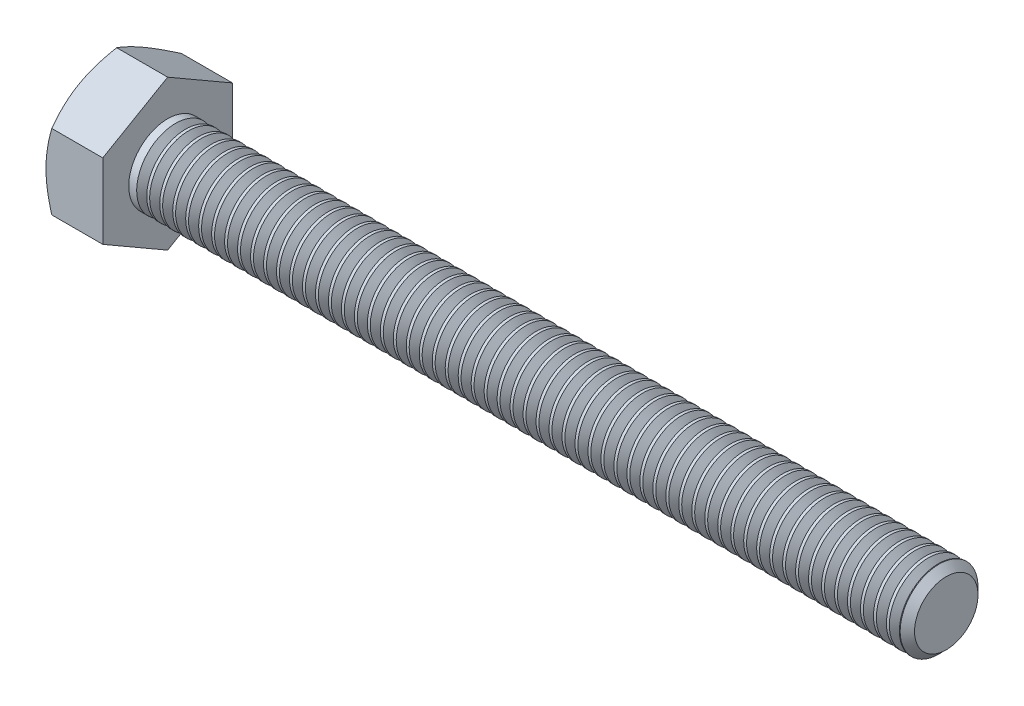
ISO-10303-21;
HEADER;
FILE_DESCRIPTION(('STEP AP214'),'2;1');
FILE_NAME('part.step','',(''),(''),'','','');
FILE_SCHEMA(('AUTOMOTIVE_DESIGN { 1 0 10303 214 1 1 1 1 }'));
ENDSEC;
DATA;
#1=APPLICATION_CONTEXT('core data for automotive mechanical design processes');
#2=APPLICATION_PROTOCOL_DEFINITION('international standard','automotive_design',2000,#1);
#3=PRODUCT_CONTEXT('',#1,'mechanical');
#4=PRODUCT('Part','Part','',(#3));
#5=PRODUCT_RELATED_PRODUCT_CATEGORY('part','',(#4));
#6=PRODUCT_DEFINITION_FORMATION('','',#4);
#7=PRODUCT_DEFINITION_CONTEXT('part definition',#1,'design');
#8=PRODUCT_DEFINITION('design','',#6,#7);
#9=PRODUCT_DEFINITION_SHAPE('','',#8);
#10=(LENGTH_UNIT() NAMED_UNIT(*) SI_UNIT(.MILLI.,.METRE.));
#11=(NAMED_UNIT(*) PLANE_ANGLE_UNIT() SI_UNIT($,.RADIAN.));
#12=(NAMED_UNIT(*) SI_UNIT($,.STERADIAN.) SOLID_ANGLE_UNIT());
#13=UNCERTAINTY_MEASURE_WITH_UNIT(LENGTH_MEASURE(1.E-05),#10,'distance_accuracy_value','');
#14=(GEOMETRIC_REPRESENTATION_CONTEXT(3) GLOBAL_UNCERTAINTY_ASSIGNED_CONTEXT((#13)) GLOBAL_UNIT_ASSIGNED_CONTEXT((#10,
#11,#12)) REPRESENTATION_CONTEXT('',''));
#15=CARTESIAN_POINT('',(0.,0.,0.));
#16=DIRECTION('',(0.,0.,1.));
#17=DIRECTION('',(1.,0.,0.));
#18=AXIS2_PLACEMENT_3D('',#15,#16,#17);
#19=CARTESIAN_POINT('',(4.375,2.88675134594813,-5.));
#20=DIRECTION('',(0.,-0.866025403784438,0.500000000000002));
#21=DIRECTION('',(0.,-0.500000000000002,-0.866025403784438));
#22=AXIS2_PLACEMENT_3D('',#19,#20,#21);
#23=PLANE('',#22);
#24=CARTESIAN_POINT('',(0.446648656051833,5.7736181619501,0.0002));
#25=CARTESIAN_POINT('',(0.373386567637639,5.64675433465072,-0.219534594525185));
#26=CARTESIAN_POINT('',(0.306751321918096,5.5188054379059,-0.441148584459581));
#27=CARTESIAN_POINT('',(0.190438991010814,5.26069210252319,-0.888213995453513));
#28=CARTESIAN_POINT('',(0.140803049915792,5.13052307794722,-1.11367335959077));
#29=CARTESIAN_POINT('',(0.0635510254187,4.87177839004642,-1.56183230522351));
#30=CARTESIAN_POINT('',(0.0354203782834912,4.74324302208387,-1.78446209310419));
#31=CARTESIAN_POINT('',(0.0101949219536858,4.54998783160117,-2.11918990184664));
#32=CARTESIAN_POINT('',(0.00461345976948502,4.48552534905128,-2.23084219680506));
#33=CARTESIAN_POINT('',(-0.000797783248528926,4.35654081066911,-2.4542499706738));
#34=CARTESIAN_POINT('',(-0.000627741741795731,4.2920187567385,-2.56600544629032));
#35=CARTESIAN_POINT('',(0.00775363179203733,4.11524635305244,-2.87218423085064));
#36=CARTESIAN_POINT('',(0.0218297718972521,4.00305457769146,-3.06650608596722));
#37=CARTESIAN_POINT('',(0.0664652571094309,3.77941563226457,-3.45386010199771));
#38=CARTESIAN_POINT('',(0.097039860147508,3.66796924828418,-3.64689090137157));
#39=CARTESIAN_POINT('',(0.173468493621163,3.44387972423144,-4.03502534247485));
#40=CARTESIAN_POINT('',(0.21964637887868,3.3312648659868,-4.23007999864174));
#41=CARTESIAN_POINT('',(0.324451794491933,3.1077146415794,-4.61728034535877));
#42=CARTESIAN_POINT('',(0.383054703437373,2.99677641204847,-4.80943099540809));
#43=CARTESIAN_POINT('',(0.446648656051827,2.88663587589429,-5.0002));
#44=B_SPLINE_CURVE_WITH_KNOTS('',3,(#24,#25,#26,#27,#28,#29,#30,#31,#32,#33,#34,#35,#36,#37,#38,
#39,#40,#41,#42,#43),.UNSPECIFIED.,.F.,.F.,(4,2,2,2,2,2,2,2,2,4),(0.,0.792555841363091,
1.58701660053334,2.36181537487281,2.74884076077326,3.13585419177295,3.8096236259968,
4.4840172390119,5.17336882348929,5.86136694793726),.UNSPECIFIED.);
#45=CARTESIAN_POINT('',(0.446581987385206,5.77350269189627,0.));
#46=VERTEX_POINT('',#45);
#47=CARTESIAN_POINT('',(0.,4.33012701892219,-2.50000000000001));
#48=VERTEX_POINT('',#47);
#49=EDGE_CURVE('E51',#46,#48,#44,.T.);
#50=ORIENTED_EDGE('',*,*,#49,.F.);
#51=DIRECTION('',(-1.,0.,0.));
#52=VECTOR('',#51,1.);
#53=CARTESIAN_POINT('',(4.375,5.77350269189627,0.));
#54=LINE('',#53,#52);
#55=CARTESIAN_POINT('',(4.375,5.77350269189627,0.));
#56=VERTEX_POINT('',#55);
#57=EDGE_CURVE('E147',#56,#46,#54,.T.);
#58=ORIENTED_EDGE('',*,*,#57,.F.);
#59=DIRECTION('',(0.,0.500000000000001,0.866025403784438));
#60=VECTOR('',#59,1.);
#61=CARTESIAN_POINT('',(4.375,2.88675134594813,-5.));
#62=LINE('',#61,#60);
#63=CARTESIAN_POINT('',(4.375,2.88675134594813,-5.));
#64=VERTEX_POINT('',#63);
#65=EDGE_CURVE('E242',#64,#56,#62,.T.);
#66=ORIENTED_EDGE('',*,*,#65,.F.);
#67=DIRECTION('',(-1.,0.,0.));
#68=VECTOR('',#67,1.);
#69=CARTESIAN_POINT('',(4.375,2.88675134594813,-5.));
#70=LINE('',#69,#68);
#71=CARTESIAN_POINT('',(0.4465819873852,2.88675134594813,-5.));
#72=VERTEX_POINT('',#71);
#73=EDGE_CURVE('E135',#64,#72,#70,.T.);
#74=ORIENTED_EDGE('',*,*,#73,.T.);
#75=EDGE_CURVE('E129',#48,#72,#44,.T.);
#76=ORIENTED_EDGE('',*,*,#75,.F.);
#77=EDGE_LOOP('',(#50,#58,#66,#74,#76));
#78=FACE_BOUND('',#77,.T.);
#79=ADVANCED_FACE('F35',(#78),#23,.F.);
#80=CARTESIAN_POINT('',(4.375,5.77350269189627,0.));
#81=DIRECTION('',(0.,-0.866025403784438,-0.500000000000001));
#82=DIRECTION('',(0.,0.500000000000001,-0.866025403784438));
#83=AXIS2_PLACEMENT_3D('',#80,#81,#82);
#84=PLANE('',#83);
#85=CARTESIAN_POINT('',(0.446648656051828,2.88663587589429,5.0002));
#86=CARTESIAN_POINT('',(0.373386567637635,3.01349970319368,4.78046540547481));
#87=CARTESIAN_POINT('',(0.306751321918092,3.14144859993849,4.55885141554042));
#88=CARTESIAN_POINT('',(0.190438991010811,3.39956193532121,4.11178600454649));
#89=CARTESIAN_POINT('',(0.14080304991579,3.52973095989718,3.88632664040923));
#90=CARTESIAN_POINT('',(0.0635510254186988,3.78847564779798,3.43816769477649));
#91=CARTESIAN_POINT('',(0.0354203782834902,3.91701101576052,3.21553790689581));
#92=CARTESIAN_POINT('',(0.0101949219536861,4.11026620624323,2.88081009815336));
#93=CARTESIAN_POINT('',(0.00461345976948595,4.17472868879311,2.76915780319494));
#94=CARTESIAN_POINT('',(-0.000797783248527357,4.30371322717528,2.5457500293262));
#95=CARTESIAN_POINT('',(-0.000627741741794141,4.36823528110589,2.43399455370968));
#96=CARTESIAN_POINT('',(0.00775363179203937,4.54500768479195,2.12781576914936));
#97=CARTESIAN_POINT('',(0.0218297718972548,4.65719946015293,1.93349391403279));
#98=CARTESIAN_POINT('',(0.0664652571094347,4.88083840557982,1.54613989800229));
#99=CARTESIAN_POINT('',(0.097039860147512,4.99228478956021,1.35310909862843));
#100=CARTESIAN_POINT('',(0.173468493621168,5.21637431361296,0.964974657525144));
#101=CARTESIAN_POINT('',(0.219646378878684,5.32898917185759,0.769920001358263));
#102=CARTESIAN_POINT('',(0.324451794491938,5.55253939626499,0.382719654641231));
#103=CARTESIAN_POINT('',(0.383054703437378,5.66347762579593,0.190569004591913));
#104=CARTESIAN_POINT('',(0.446648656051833,5.7736181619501,-0.000200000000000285));
#105=B_SPLINE_CURVE_WITH_KNOTS('',3,(#85,#86,#87,#88,#89,#90,#91,#92,#93,#94,#95,#96,#97,#98,
#99,#100,#101,#102,#103,#104),.UNSPECIFIED.,.F.,.F.,(4,2,2,2,2,2,2,2,2,4),(0.,0.79255584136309,
1.58701660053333,2.36181537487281,2.74884076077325,3.13585419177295,3.80962362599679,
4.48401723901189,5.17336882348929,5.86136694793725),.UNSPECIFIED.);
#106=CARTESIAN_POINT('',(0.446581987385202,2.88675134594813,5.));
#107=VERTEX_POINT('',#106);
#108=CARTESIAN_POINT('',(0.,4.33012701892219,2.5));
#109=VERTEX_POINT('',#108);
#110=EDGE_CURVE('E58',#107,#109,#105,.T.);
#111=ORIENTED_EDGE('',*,*,#110,.F.);
#112=DIRECTION('',(-1.,0.,0.));
#113=VECTOR('',#112,1.);
#114=CARTESIAN_POINT('',(4.375,2.88675134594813,5.));
#115=LINE('',#114,#113);
#116=CARTESIAN_POINT('',(4.375,2.88675134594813,5.));
#117=VERTEX_POINT('',#116);
#118=EDGE_CURVE('E145',#117,#107,#115,.T.);
#119=ORIENTED_EDGE('',*,*,#118,.F.);
#120=DIRECTION('',(0.,-0.500000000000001,0.866025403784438));
#121=VECTOR('',#120,1.);
#122=CARTESIAN_POINT('',(4.375,5.77350269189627,0.));
#123=LINE('',#122,#121);
#124=EDGE_CURVE('E240',#56,#117,#123,.T.);
#125=ORIENTED_EDGE('',*,*,#124,.F.);
#126=ORIENTED_EDGE('',*,*,#57,.T.);
#127=EDGE_CURVE('E162',#109,#46,#105,.T.);
#128=ORIENTED_EDGE('',*,*,#127,.F.);
#129=EDGE_LOOP('',(#111,#119,#125,#126,#128));
#130=FACE_BOUND('',#129,.T.);
#131=ADVANCED_FACE('F169',(#130),#84,.F.);
#132=CARTESIAN_POINT('',(4.375,2.88675134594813,5.));
#133=DIRECTION('',(0.,0.,-1.));
#134=DIRECTION('',(-1.,0.,0.));
#135=AXIS2_PLACEMENT_3D('',#132,#133,#134);
#136=PLANE('',#135);
#137=CARTESIAN_POINT('',(2.47533544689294,-7.82661640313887,5.));
#138=CARTESIAN_POINT('',(2.36879683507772,-7.60758613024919,5.));
#139=CARTESIAN_POINT('',(2.26325911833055,-7.38806071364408,5.));
#140=CARTESIAN_POINT('',(2.0547470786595,-6.94775649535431,5.));
#141=CARTESIAN_POINT('',(1.95177314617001,-6.72697750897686,5.));
#142=CARTESIAN_POINT('',(1.74844778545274,-6.28280027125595,5.));
#143=CARTESIAN_POINT('',(1.64811306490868,-6.05939434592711,5.));
#144=CARTESIAN_POINT('',(1.45145486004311,-5.61083043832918,5.));
#145=CARTESIAN_POINT('',(1.35513119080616,-5.38567253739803,5.));
#146=CARTESIAN_POINT('',(1.16445037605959,-4.92576614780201,5.));
#147=CARTESIAN_POINT('',(1.07026351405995,-4.69094667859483,5.));
#148=CARTESIAN_POINT('',(0.88884438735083,-4.2185875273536,5.));
#149=CARTESIAN_POINT('',(0.801612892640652,-3.98104754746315,5.));
#150=CARTESIAN_POINT('',(0.636341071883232,-3.50329086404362,5.));
#151=CARTESIAN_POINT('',(0.558282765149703,-3.26308044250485,5.));
#152=CARTESIAN_POINT('',(0.413813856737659,-2.7792146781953,5.));
#153=CARTESIAN_POINT('',(0.347399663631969,-2.53556042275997,5.));
#154=CARTESIAN_POINT('',(0.229707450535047,-2.04600448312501,5.));
#155=CARTESIAN_POINT('',(0.178346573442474,-1.80012308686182,5.));
#156=CARTESIAN_POINT('',(0.0936230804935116,-1.30522837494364,5.));
#157=CARTESIAN_POINT('',(0.0602585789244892,-1.05621539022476,5.));
#158=CARTESIAN_POINT('',(0.0146229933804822,-0.559584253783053,5.));
#159=CARTESIAN_POINT('',(0.00207498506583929,-0.311992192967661,5.));
#160=CARTESIAN_POINT('',(-0.00159747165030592,0.183375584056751,5.));
#161=CARTESIAN_POINT('',(0.00727849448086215,0.431151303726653,5.));
#162=CARTESIAN_POINT('',(0.0397265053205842,0.84962286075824,5.));
#163=CARTESIAN_POINT('',(0.0579847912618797,1.02075746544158,5.));
#164=CARTESIAN_POINT('',(0.103624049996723,1.36181398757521,5.));
#165=CARTESIAN_POINT('',(0.131006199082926,1.53173574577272,5.));
#166=CARTESIAN_POINT('',(0.225403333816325,2.03942834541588,5.));
#167=CARTESIAN_POINT('',(0.304653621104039,2.37495177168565,5.));
#168=CARTESIAN_POINT('',(0.442611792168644,2.87686006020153,5.));
#169=CARTESIAN_POINT('',(0.492453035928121,3.04583048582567,5.));
#170=CARTESIAN_POINT('',(0.597441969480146,3.3821306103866,5.));
#171=CARTESIAN_POINT('',(0.652589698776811,3.54946029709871,5.));
#172=CARTESIAN_POINT('',(0.767295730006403,3.88253122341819,5.));
#173=CARTESIAN_POINT('',(0.826852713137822,4.04827292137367,5.));
#174=CARTESIAN_POINT('',(0.949663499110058,4.37837269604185,5.));
#175=CARTESIAN_POINT('',(1.01291722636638,4.54273080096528,5.));
#176=CARTESIAN_POINT('',(1.18384085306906,4.97467594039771,5.));
#177=CARTESIAN_POINT('',(1.29410564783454,5.2412350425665,5.));
#178=CARTESIAN_POINT('',(1.52085041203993,5.77170603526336,5.));
#179=CARTESIAN_POINT('',(1.63733099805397,6.0356176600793,5.));
#180=CARTESIAN_POINT('',(1.87507624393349,6.56138078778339,5.));
#181=CARTESIAN_POINT('',(1.99634255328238,6.8232315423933,5.));
#182=CARTESIAN_POINT('',(2.24254703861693,7.34518395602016,5.));
#183=CARTESIAN_POINT('',(2.36748508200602,7.60528567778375,5.));
#184=CARTESIAN_POINT('',(2.62044102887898,8.12446478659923,5.));
#185=CARTESIAN_POINT('',(2.74846325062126,8.38354006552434,5.));
#186=CARTESIAN_POINT('',(3.00682668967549,8.90053291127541,5.));
#187=CARTESIAN_POINT('',(3.13716793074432,9.1584504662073,5.));
#188=CARTESIAN_POINT('',(3.53092424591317,9.9306766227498,5.));
#189=CARTESIAN_POINT('',(3.79712405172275,10.4435647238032,5.));
#190=CARTESIAN_POINT('',(4.30724046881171,11.4147548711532,5.));
#191=CARTESIAN_POINT('',(4.55067498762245,11.873311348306,5.));
#192=CARTESIAN_POINT('',(5.04052915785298,12.7888590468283,5.));
#193=CARTESIAN_POINT('',(5.28694897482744,13.2458501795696,5.));
#194=CARTESIAN_POINT('',(5.7812250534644,14.1571829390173,5.));
#195=CARTESIAN_POINT('',(6.02907430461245,14.6115283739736,5.));
#196=CARTESIAN_POINT('',(6.5264818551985,15.5192398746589,5.));
#197=CARTESIAN_POINT('',(6.77604002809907,15.9726060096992,5.));
#198=CARTESIAN_POINT('',(7.02622264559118,16.4256251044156,5.));
#199=B_SPLINE_CURVE_WITH_KNOTS('',3,(#137,#138,#139,#140,#141,#142,#143,#144,#145,#146,#147,
#148,#149,#150,#151,#152,#153,#154,#155,#156,#157,#158,#159,#160,#161,#162,#163,#164,#165,#166,
#167,#168,#169,#170,#171,#172,#173,#174,#175,#176,#177,#178,#179,#180,#181,#182,#183,#184,#185,
#186,#187,#188,#189,#190,#191,#192,#193,#194,#195,#196,#197,#198),.UNSPECIFIED.,.F.,.F.,(4,2,2,
2,2,2,2,2,2,2,2,2,2,2,2,2,2,2,2,2,2,2,2,2,2,2,2,2,2,2,4),(0.,0.730708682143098,1.4615279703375,
2.19620403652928,2.930846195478,3.68977491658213,4.44878753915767,5.20628666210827,
5.96355173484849,6.71656679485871,7.46950293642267,8.21233991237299,8.95519126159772,
9.47125991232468,9.98739512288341,11.0201893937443,11.5486465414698,12.0771076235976,
12.6054112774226,13.1337041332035,13.9989833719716,14.8643486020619,15.7300147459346,
16.5956496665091,17.4625765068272,18.3295122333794,20.0630293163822,21.6205191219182,
23.1780956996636,24.7307447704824,26.2832800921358),.UNSPECIFIED.);
#200=CARTESIAN_POINT('',(0.446581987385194,-2.88675134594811,5.));
#201=VERTEX_POINT('',#200);
#202=CARTESIAN_POINT('',(0.,0.,5.));
#203=VERTEX_POINT('',#202);
#204=EDGE_CURVE('E252',#201,#203,#199,.T.);
#205=ORIENTED_EDGE('',*,*,#204,.F.);
#206=DIRECTION('',(-1.,0.,0.));
#207=VECTOR('',#206,1.);
#208=CARTESIAN_POINT('',(4.375,-2.88675134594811,5.));
#209=LINE('',#208,#207);
#210=CARTESIAN_POINT('',(4.375,-2.88675134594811,5.));
#211=VERTEX_POINT('',#210);
#212=EDGE_CURVE('E137',#211,#201,#209,.T.);
#213=ORIENTED_EDGE('',*,*,#212,.F.);
#214=DIRECTION('',(0.,-1.,0.));
#215=VECTOR('',#214,1.);
#216=CARTESIAN_POINT('',(4.375,2.88675134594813,5.));
#217=LINE('',#216,#215);
#218=EDGE_CURVE('E236',#117,#211,#217,.T.);
#219=ORIENTED_EDGE('',*,*,#218,.F.);
#220=ORIENTED_EDGE('',*,*,#118,.T.);
#221=EDGE_CURVE('E187',#203,#107,#199,.T.);
#222=ORIENTED_EDGE('',*,*,#221,.F.);
#223=EDGE_LOOP('',(#205,#213,#219,#220,#222));
#224=FACE_BOUND('',#223,.T.);
#225=ADVANCED_FACE('F258',(#224),#136,.F.);
#226=CARTESIAN_POINT('',(4.375,-5.77350269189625,0.));
#227=DIRECTION('',(0.,0.866025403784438,-0.500000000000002));
#228=DIRECTION('',(0.,0.500000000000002,0.866025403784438));
#229=AXIS2_PLACEMENT_3D('',#226,#227,#228);
#230=PLANE('',#229);
#231=CARTESIAN_POINT('',(0.446648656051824,-5.77361816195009,-0.000200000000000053));
#232=CARTESIAN_POINT('',(0.37338656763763,-5.6467543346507,0.219534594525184));
#233=CARTESIAN_POINT('',(0.306751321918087,-5.51880543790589,0.441148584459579));
#234=CARTESIAN_POINT('',(0.190438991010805,-5.26069210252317,0.888213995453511));
#235=CARTESIAN_POINT('',(0.140803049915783,-5.1305230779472,1.11367335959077));
#236=CARTESIAN_POINT('',(0.063551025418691,-4.8717783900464,1.56183230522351));
#237=CARTESIAN_POINT('',(0.0354203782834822,-4.74324302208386,1.78446209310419));
#238=CARTESIAN_POINT('',(0.010194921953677,-4.54998783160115,2.11918990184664));
#239=CARTESIAN_POINT('',(0.00461345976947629,-4.48552534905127,2.23084219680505));
#240=CARTESIAN_POINT('',(-0.000797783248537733,-4.3565408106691,2.45424997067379));
#241=CARTESIAN_POINT('',(-0.00062774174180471,-4.29201875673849,2.56600544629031));
#242=CARTESIAN_POINT('',(0.00775363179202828,-4.11524635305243,2.87218423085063));
#243=CARTESIAN_POINT('',(0.0218297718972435,-4.00305457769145,3.06650608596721));
#244=CARTESIAN_POINT('',(0.0664652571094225,-3.77941563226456,3.4538601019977));
#245=CARTESIAN_POINT('',(0.0970398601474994,-3.66796924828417,3.64689090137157));
#246=CARTESIAN_POINT('',(0.173468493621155,-3.44387972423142,4.03502534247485));
#247=CARTESIAN_POINT('',(0.219646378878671,-3.33126486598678,4.23007999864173));
#248=CARTESIAN_POINT('',(0.324451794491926,-3.10771464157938,4.61728034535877));
#249=CARTESIAN_POINT('',(0.383054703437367,-2.99677641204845,4.80943099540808));
#250=CARTESIAN_POINT('',(0.446648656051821,-2.88663587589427,5.0002));
#251=B_SPLINE_CURVE_WITH_KNOTS('',3,(#231,#232,#233,#234,#235,#236,#237,#238,#239,#240,#241,
#242,#243,#244,#245,#246,#247,#248,#249,#250),.UNSPECIFIED.,.F.,.F.,(4,2,2,2,2,2,2,2,2,4),(0.,
0.79255584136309,1.58701660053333,2.3618153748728,2.74884076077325,3.13585419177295,
3.80962362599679,4.48401723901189,5.17336882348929,5.86136694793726),.UNSPECIFIED.);
#252=CARTESIAN_POINT('',(0.446581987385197,-5.77350269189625,0.));
#253=VERTEX_POINT('',#252);
#254=CARTESIAN_POINT('',(0.,-4.33012701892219,2.50000000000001));
#255=VERTEX_POINT('',#254);
#256=EDGE_CURVE('E171',#253,#255,#251,.T.);
#257=ORIENTED_EDGE('',*,*,#256,.F.);
#258=DIRECTION('',(-1.,0.,0.));
#259=VECTOR('',#258,1.);
#260=CARTESIAN_POINT('',(4.375,-5.77350269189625,0.));
#261=LINE('',#260,#259);
#262=CARTESIAN_POINT('',(4.375,-5.77350269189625,0.));
#263=VERTEX_POINT('',#262);
#264=EDGE_CURVE('E134',#263,#253,#261,.T.);
#265=ORIENTED_EDGE('',*,*,#264,.F.);
#266=DIRECTION('',(0.,-0.500000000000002,-0.866025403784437));
#267=VECTOR('',#266,1.);
#268=CARTESIAN_POINT('',(4.375,-5.77350269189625,0.));
#269=LINE('',#268,#267);
#270=EDGE_CURVE('E234',#211,#263,#269,.T.);
#271=ORIENTED_EDGE('',*,*,#270,.F.);
#272=ORIENTED_EDGE('',*,*,#212,.T.);
#273=EDGE_CURVE('E173',#255,#201,#251,.T.);
#274=ORIENTED_EDGE('',*,*,#273,.F.);
#275=EDGE_LOOP('',(#257,#265,#271,#272,#274));
#276=FACE_BOUND('',#275,.T.);
#277=ADVANCED_FACE('F230',(#276),#230,.F.);
#278=CARTESIAN_POINT('',(4.375,-2.88675134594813,-5.));
#279=DIRECTION('',(0.,0.866025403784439,0.499999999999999));
#280=DIRECTION('',(0.,-0.499999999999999,0.866025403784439));
#281=AXIS2_PLACEMENT_3D('',#278,#279,#280);
#282=PLANE('',#281);
#283=CARTESIAN_POINT('',(0.446648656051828,-2.88663587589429,-5.0002));
#284=CARTESIAN_POINT('',(0.373386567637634,-3.01349970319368,-4.78046540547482));
#285=CARTESIAN_POINT('',(0.306751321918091,-3.14144859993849,-4.55885141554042));
#286=CARTESIAN_POINT('',(0.19043899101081,-3.39956193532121,-4.11178600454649));
#287=CARTESIAN_POINT('',(0.140803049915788,-3.52973095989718,-3.88632664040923));
#288=CARTESIAN_POINT('',(0.0635510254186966,-3.78847564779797,-3.43816769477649));
#289=CARTESIAN_POINT('',(0.0354203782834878,-3.91701101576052,-3.21553790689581));
#290=CARTESIAN_POINT('',(0.0101949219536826,-4.11026620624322,-2.88081009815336));
#291=CARTESIAN_POINT('',(0.00461345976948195,-4.1747286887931,-2.76915780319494));
#292=CARTESIAN_POINT('',(-0.000797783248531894,-4.30371322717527,-2.5457500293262));
#293=CARTESIAN_POINT('',(-0.00062774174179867,-4.36823528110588,-2.43399455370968));
#294=CARTESIAN_POINT('',(0.00775363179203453,-4.54500768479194,-2.12781576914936));
#295=CARTESIAN_POINT('',(0.0218297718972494,-4.65719946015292,-1.93349391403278));
#296=CARTESIAN_POINT('',(0.0664652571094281,-4.88083840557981,-1.54613989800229));
#297=CARTESIAN_POINT('',(0.097039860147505,-4.9922847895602,-1.35310909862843));
#298=CARTESIAN_POINT('',(0.17346849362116,-5.21637431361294,-0.964974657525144));
#299=CARTESIAN_POINT('',(0.219646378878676,-5.32898917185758,-0.769920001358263));
#300=CARTESIAN_POINT('',(0.32445179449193,-5.55253939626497,-0.382719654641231));
#301=CARTESIAN_POINT('',(0.38305470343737,-5.66347762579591,-0.190569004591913));
#302=CARTESIAN_POINT('',(0.446648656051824,-5.77361816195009,0.000200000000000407));
#303=B_SPLINE_CURVE_WITH_KNOTS('',3,(#283,#284,#285,#286,#287,#288,#289,#290,#291,#292,#293,
#294,#295,#296,#297,#298,#299,#300,#301,#302),.UNSPECIFIED.,.F.,.F.,(4,2,2,2,2,2,2,2,2,4),(0.,
0.792555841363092,1.58701660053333,2.36181537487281,2.74884076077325,3.13585419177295,
3.80962362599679,4.48401723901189,5.17336882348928,5.86136694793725),.UNSPECIFIED.);
#304=CARTESIAN_POINT('',(0.446581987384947,-2.88675134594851,-5.));
#305=VERTEX_POINT('',#304);
#306=CARTESIAN_POINT('',(0.,-4.3301270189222,-2.5));
#307=VERTEX_POINT('',#306);
#308=EDGE_CURVE('E111',#305,#307,#303,.T.);
#309=ORIENTED_EDGE('',*,*,#308,.F.);
#310=DIRECTION('',(-1.,0.,0.));
#311=VECTOR('',#310,1.);
#312=CARTESIAN_POINT('',(4.375,-2.88675134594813,-5.));
#313=LINE('',#312,#311);
#314=CARTESIAN_POINT('',(4.375,-2.88675134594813,-5.));
#315=VERTEX_POINT('',#314);
#316=EDGE_CURVE('E125',#315,#305,#313,.T.);
#317=ORIENTED_EDGE('',*,*,#316,.F.);
#318=DIRECTION('',(0.,0.499999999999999,-0.866025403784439));
#319=VECTOR('',#318,1.);
#320=CARTESIAN_POINT('',(4.375,-2.88675134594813,-5.));
#321=LINE('',#320,#319);
#322=EDGE_CURVE('E232',#263,#315,#321,.T.);
#323=ORIENTED_EDGE('',*,*,#322,.F.);
#324=ORIENTED_EDGE('',*,*,#264,.T.);
#325=EDGE_CURVE('E128',#307,#253,#303,.T.);
#326=ORIENTED_EDGE('',*,*,#325,.F.);
#327=EDGE_LOOP('',(#309,#317,#323,#324,#326));
#328=FACE_BOUND('',#327,.T.);
#329=ADVANCED_FACE('F123',(#328),#282,.F.);
#330=CARTESIAN_POINT('',(4.375,2.88675134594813,-5.));
#331=DIRECTION('',(0.,0.,1.));
#332=DIRECTION('',(0.,-1.,0.));
#333=AXIS2_PLACEMENT_3D('',#330,#331,#332);
#334=PLANE('',#333);
#335=CARTESIAN_POINT('',(2.47533544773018,-7.82661640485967,-5.));
#336=CARTESIAN_POINT('',(2.36879683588,-7.60758613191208,-5.));
#337=CARTESIAN_POINT('',(2.2632591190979,-7.38806071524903,-5.));
#338=CARTESIAN_POINT('',(2.05474707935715,-6.94775649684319,-5.));
#339=CARTESIAN_POINT('',(1.95177314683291,-6.72697751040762,-5.));
#340=CARTESIAN_POINT('',(1.74844778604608,-6.28280027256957,-5.));
#341=CARTESIAN_POINT('',(1.64811306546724,-6.05939434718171,-5.));
#342=CARTESIAN_POINT('',(1.45145486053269,-5.61083043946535,-5.));
#343=CARTESIAN_POINT('',(1.35513119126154,-5.38567253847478,-5.));
#344=CARTESIAN_POINT('',(1.16445037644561,-4.92576614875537,-5.));
#345=CARTESIAN_POINT('',(1.07026351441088,-4.69094667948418,-5.));
#346=CARTESIAN_POINT('',(0.888844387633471,-4.2185875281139,-5.));
#347=CARTESIAN_POINT('',(0.801612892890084,-3.9810475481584,-5.));
#348=CARTESIAN_POINT('',(0.636341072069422,-3.50329086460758,-5.));
#349=CARTESIAN_POINT('',(0.558282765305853,-3.26308044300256,-5.));
#350=CARTESIAN_POINT('',(0.413813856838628,-2.77921467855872,-5.));
#351=CARTESIAN_POINT('',(0.347399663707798,-2.53556042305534,-5.));
#352=CARTESIAN_POINT('',(0.229707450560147,-2.04600448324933,-5.));
#353=CARTESIAN_POINT('',(0.178346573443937,-1.80012308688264,-5.));
#354=CARTESIAN_POINT('',(0.0936230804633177,-1.30522837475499,-5.));
#355=CARTESIAN_POINT('',(0.0602585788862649,-1.05621538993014,-5.));
#356=CARTESIAN_POINT('',(0.0146229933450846,-0.559584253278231,-5.));
#357=CARTESIAN_POINT('',(0.00207498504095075,-0.311992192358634,-5.));
#358=CARTESIAN_POINT('',(-0.00159747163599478,0.183375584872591,-5.));
#359=CARTESIAN_POINT('',(0.00727849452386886,0.431151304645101,-5.));
#360=CARTESIAN_POINT('',(0.0397265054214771,0.849622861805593,-5.));
#361=CARTESIAN_POINT('',(0.0579847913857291,1.02075746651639,-5.));
#362=CARTESIAN_POINT('',(0.103624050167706,1.36181398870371,-5.));
#363=CARTESIAN_POINT('',(0.131006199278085,1.53173574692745,-5.));
#364=CARTESIAN_POINT('',(0.225403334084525,2.03942834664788,-5.));
#365=CARTESIAN_POINT('',(0.304653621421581,2.37495177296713,-5.));
#366=CARTESIAN_POINT('',(0.442611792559,2.87686006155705,-5.));
#367=CARTESIAN_POINT('',(0.492453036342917,3.04583048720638,-5.));
#368=CARTESIAN_POINT('',(0.597441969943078,3.38213061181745,-5.));
#369=CARTESIAN_POINT('',(0.652589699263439,3.54946029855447,-5.));
#370=CARTESIAN_POINT('',(0.767295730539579,3.88253122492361,-5.));
#371=CARTESIAN_POINT('',(0.826852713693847,4.04827292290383,-5.));
#372=CARTESIAN_POINT('',(0.949663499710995,4.3783726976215,-5.));
#373=CARTESIAN_POINT('',(1.01291722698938,4.54273080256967,-5.));
#374=CARTESIAN_POINT('',(1.18384085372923,4.97467594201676,-5.));
#375=CARTESIAN_POINT('',(1.29410564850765,5.24123504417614,-5.));
#376=CARTESIAN_POINT('',(1.5208504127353,5.77170603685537,-5.));
#377=CARTESIAN_POINT('',(1.63733099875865,6.03561766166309,-5.));
#378=CARTESIAN_POINT('',(1.87507624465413,6.56138078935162,-5.));
#379=CARTESIAN_POINT('',(1.99634255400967,6.82323154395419,-5.));
#380=CARTESIAN_POINT('',(2.24254703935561,7.34518395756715,-5.));
#381=CARTESIAN_POINT('',(2.36748508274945,7.60528567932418,-5.));
#382=CARTESIAN_POINT('',(2.62044102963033,8.12446478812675,-5.));
#383=CARTESIAN_POINT('',(2.74846325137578,8.38354006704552,-5.));
#384=CARTESIAN_POINT('',(3.00682669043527,8.9005329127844,-5.));
#385=CARTESIAN_POINT('',(3.1371679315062,9.15845046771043,-5.));
#386=CARTESIAN_POINT('',(3.53092424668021,9.93067662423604,-5.));
#387=CARTESIAN_POINT('',(3.79712405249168,10.443564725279,-5.));
#388=CARTESIAN_POINT('',(4.30724046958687,11.4147548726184,-5.));
#389=CARTESIAN_POINT('',(4.55067498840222,11.8733113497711,-5.));
#390=CARTESIAN_POINT('',(5.04052915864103,12.7888590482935,-5.));
#391=CARTESIAN_POINT('',(5.28694897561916,13.2458501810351,-5.));
#392=CARTESIAN_POINT('',(5.78122505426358,14.1571829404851,-5.));
#393=CARTESIAN_POINT('',(6.02907430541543,14.6115283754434,-5.));
#394=CARTESIAN_POINT('',(6.52648185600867,15.519239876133,-5.));
#395=CARTESIAN_POINT('',(6.7760400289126,15.9726060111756,-5.));
#396=CARTESIAN_POINT('',(7.02622264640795,16.4256251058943,-5.));
#397=B_SPLINE_CURVE_WITH_KNOTS('',3,(#335,#336,#337,#338,#339,#340,#341,#342,#343,#344,#345,
#346,#347,#348,#349,#350,#351,#352,#353,#354,#355,#356,#357,#358,#359,#360,#361,#362,#363,#364,
#365,#366,#367,#368,#369,#370,#371,#372,#373,#374,#375,#376,#377,#378,#379,#380,#381,#382,#383,
#384,#385,#386,#387,#388,#389,#390,#391,#392,#393,#394,#395,#396),.UNSPECIFIED.,.F.,.F.,(4,2,2,
2,2,2,2,2,2,2,2,2,2,2,2,2,2,2,2,2,2,2,2,2,2,2,2,2,2,2,4),(0.,0.730708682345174,1.46152797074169,
2.19620403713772,2.93084619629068,3.6897749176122,4.44878754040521,5.20628666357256,
5.96355173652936,6.7165667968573,7.46950293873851,8.21233991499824,8.95519126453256,
9.47125991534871,9.98739512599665,11.0201893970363,11.5486465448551,12.0771076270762,
12.6054112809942,13.1337041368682,13.9989833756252,14.8643486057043,15.7300147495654,
16.5956496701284,17.4625765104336,18.329512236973,20.0630293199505,21.6205191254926,
23.1780957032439,24.7307447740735,26.2832800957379),.UNSPECIFIED.);
#398=CARTESIAN_POINT('',(0.,0.,-5.));
#399=VERTEX_POINT('',#398);
#400=EDGE_CURVE('E117',#72,#399,#397,.F.);
#401=ORIENTED_EDGE('',*,*,#400,.F.);
#402=ORIENTED_EDGE('',*,*,#73,.F.);
#403=DIRECTION('',(0.,1.,0.));
#404=VECTOR('',#403,1.);
#405=CARTESIAN_POINT('',(4.375,2.88675134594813,-5.));
#406=LINE('',#405,#404);
#407=EDGE_CURVE('E133',#315,#64,#406,.T.);
#408=ORIENTED_EDGE('',*,*,#407,.F.);
#409=ORIENTED_EDGE('',*,*,#316,.T.);
#410=EDGE_CURVE('E108',#399,#305,#397,.F.);
#411=ORIENTED_EDGE('',*,*,#410,.F.);
#412=EDGE_LOOP('',(#401,#402,#408,#409,#411));
#413=FACE_BOUND('',#412,.T.);
#414=ADVANCED_FACE('F131',(#413),#334,.F.);
#415=CARTESIAN_POINT('',(4.375,5.77350269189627,0.));
#416=DIRECTION('',(1.,0.,0.));
#417=DIRECTION('',(0.,0.,-1.));
#418=AXIS2_PLACEMENT_3D('',#415,#416,#417);
#419=PLANE('',#418);
#420=CARTESIAN_POINT('',(4.375,0.,0.));
#421=DIRECTION('',(1.,0.,0.));
#422=DIRECTION('',(0.,0.,-1.));
#423=AXIS2_PLACEMENT_3D('',#420,#421,#422);
#424=CIRCLE('',#423,3.);
#425=CARTESIAN_POINT('',(4.375,0.,-3.));
#426=VERTEX_POINT('',#425);
#427=EDGE_CURVE('E245',#426,#426,#424,.F.);
#428=ORIENTED_EDGE('',*,*,#427,.T.);
#429=EDGE_LOOP('',(#428));
#430=FACE_BOUND('',#429,.T.);
#431=ORIENTED_EDGE('',*,*,#65,.T.);
#432=ORIENTED_EDGE('',*,*,#124,.T.);
#433=ORIENTED_EDGE('',*,*,#218,.T.);
#434=ORIENTED_EDGE('',*,*,#270,.T.);
#435=ORIENTED_EDGE('',*,*,#322,.T.);
#436=ORIENTED_EDGE('',*,*,#407,.T.);
#437=EDGE_LOOP('',(#431,#432,#433,#434,#435,#436));
#438=FACE_BOUND('',#437,.T.);
#439=ADVANCED_FACE('F260',(#430,#438),#419,.T.);
#440=CARTESIAN_POINT('',(0.,0.,0.));
#441=DIRECTION('',(-1.,0.,0.));
#442=DIRECTION('',(0.,0.,1.));
#443=AXIS2_PLACEMENT_3D('',#440,#441,#442);
#444=CYLINDRICAL_SURFACE('',#443,3.);
#445=CARTESIAN_POINT('',(4.98673492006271,0.,0.));
#446=DIRECTION('',(-1.,0.,0.));
#447=DIRECTION('',(0.,-1.,0.));
#448=AXIS2_PLACEMENT_3D('',#445,#446,#447);
#449=CIRCLE('',#448,3.);
#450=CARTESIAN_POINT('',(4.98673492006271,-3.,0.));
#451=VERTEX_POINT('',#450);
#452=EDGE_CURVE('E847',#451,#451,#449,.T.);
#453=ORIENTED_EDGE('',*,*,#452,.T.);
#454=EDGE_LOOP('',(#453));
#455=FACE_BOUND('',#454,.T.);
#456=ORIENTED_EDGE('',*,*,#427,.F.);
#457=EDGE_LOOP('',(#456));
#458=FACE_BOUND('',#457,.T.);
#459=ADVANCED_FACE('F271',(#455,#458),#444,.T.);
#460=CARTESIAN_POINT('',(0.,0.,0.));
#461=DIRECTION('',(1.,0.,0.));
#462=DIRECTION('',(0.,0.,-1.));
#463=AXIS2_PLACEMENT_3D('',#460,#461,#462);
#464=CONICAL_SURFACE('',#463,5.,1.0471975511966);
#465=ORIENTED_EDGE('',*,*,#308,.T.);
#466=CARTESIAN_POINT('',(0.,0.,0.));
#467=DIRECTION('',(1.,0.,0.));
#468=DIRECTION('',(0.,0.,-1.));
#469=AXIS2_PLACEMENT_3D('',#466,#467,#468);
#470=CIRCLE('',#469,5.);
#471=EDGE_CURVE('E39',#307,#399,#470,.T.);
#472=ORIENTED_EDGE('',*,*,#471,.T.);
#473=ORIENTED_EDGE('',*,*,#410,.T.);
#474=EDGE_LOOP('',(#465,#472,#473));
#475=FACE_BOUND('',#474,.T.);
#476=ADVANCED_FACE('F110',(#475),#464,.T.);
#477=ORIENTED_EDGE('',*,*,#256,.T.);
#478=EDGE_CURVE('E152',#255,#307,#470,.T.);
#479=ORIENTED_EDGE('',*,*,#478,.T.);
#480=ORIENTED_EDGE('',*,*,#325,.T.);
#481=EDGE_LOOP('',(#477,#479,#480));
#482=FACE_BOUND('',#481,.T.);
#483=ADVANCED_FACE('F201',(#482),#464,.T.);
#484=ORIENTED_EDGE('',*,*,#204,.T.);
#485=EDGE_CURVE('E153',#203,#255,#470,.T.);
#486=ORIENTED_EDGE('',*,*,#485,.T.);
#487=ORIENTED_EDGE('',*,*,#273,.T.);
#488=EDGE_LOOP('',(#484,#486,#487));
#489=FACE_BOUND('',#488,.T.);
#490=ADVANCED_FACE('F195',(#489),#464,.T.);
#491=ORIENTED_EDGE('',*,*,#221,.T.);
#492=ORIENTED_EDGE('',*,*,#110,.T.);
#493=CARTESIAN_POINT('',(0.,0.,0.));
#494=DIRECTION('',(-1.,0.,0.));
#495=DIRECTION('',(0.,0.,1.));
#496=AXIS2_PLACEMENT_3D('',#493,#494,#495);
#497=CIRCLE('',#496,5.);
#498=EDGE_CURVE('E118',#203,#109,#497,.T.);
#499=ORIENTED_EDGE('',*,*,#498,.F.);
#500=EDGE_LOOP('',(#491,#492,#499));
#501=FACE_BOUND('',#500,.T.);
#502=ADVANCED_FACE('F200',(#501),#464,.T.);
#503=ORIENTED_EDGE('',*,*,#127,.T.);
#504=ORIENTED_EDGE('',*,*,#49,.T.);
#505=EDGE_CURVE('E44',#48,#109,#470,.T.);
#506=ORIENTED_EDGE('',*,*,#505,.T.);
#507=EDGE_LOOP('',(#503,#504,#506));
#508=FACE_BOUND('',#507,.T.);
#509=ADVANCED_FACE('F161',(#508),#464,.T.);
#510=ORIENTED_EDGE('',*,*,#75,.T.);
#511=ORIENTED_EDGE('',*,*,#400,.T.);
#512=EDGE_CURVE('E11',#399,#48,#470,.T.);
#513=ORIENTED_EDGE('',*,*,#512,.T.);
#514=EDGE_LOOP('',(#510,#511,#513));
#515=FACE_BOUND('',#514,.T.);
#516=ADVANCED_FACE('F263',(#515),#464,.T.);
#517=CARTESIAN_POINT('',(0.,5.77350269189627,0.));
#518=DIRECTION('',(1.,0.,0.));
#519=DIRECTION('',(0.,0.,-1.));
#520=AXIS2_PLACEMENT_3D('',#517,#518,#519);
#521=PLANE('',#520);
#522=ORIENTED_EDGE('',*,*,#512,.F.);
#523=ORIENTED_EDGE('',*,*,#471,.F.);
#524=ORIENTED_EDGE('',*,*,#478,.F.);
#525=ORIENTED_EDGE('',*,*,#485,.F.);
#526=ORIENTED_EDGE('',*,*,#498,.T.);
#527=ORIENTED_EDGE('',*,*,#505,.F.);
#528=EDGE_LOOP('',(#522,#523,#524,#525,#526,#527));
#529=FACE_BOUND('',#528,.T.);
#530=ADVANCED_FACE('F165',(#529),#521,.F.);
#531=CARTESIAN_POINT('',(5.76326507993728,0.,0.));
#532=DIRECTION('',(1.,0.,0.));
#533=DIRECTION('',(0.,1.,0.));
#534=AXIS2_PLACEMENT_3D('',#531,#532,#533);
#535=CONICAL_SURFACE('',#534,3.,0.959931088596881);
#536=CARTESIAN_POINT('',(5.375,0.,0.));
#537=DIRECTION('',(-1.,0.,0.));
#538=DIRECTION('',(0.,-1.,0.));
#539=AXIS2_PLACEMENT_3D('',#536,#537,#538);
#540=CIRCLE('',#539,2.4455);
#541=CARTESIAN_POINT('',(5.375,-2.4455,0.));
#542=VERTEX_POINT('',#541);
#543=EDGE_CURVE('E850',#542,#542,#540,.T.);
#544=ORIENTED_EDGE('',*,*,#543,.F.);
#545=EDGE_LOOP('',(#544));
#546=FACE_BOUND('',#545,.T.);
#547=CARTESIAN_POINT('',(5.76326507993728,0.,0.));
#548=DIRECTION('',(-1.,0.,0.));
#549=DIRECTION('',(0.,-1.,0.));
#550=AXIS2_PLACEMENT_3D('',#547,#548,#549);
#551=CIRCLE('',#550,3.);
#552=CARTESIAN_POINT('',(5.76326507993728,-3.,0.));
#553=VERTEX_POINT('',#552);
#554=EDGE_CURVE('E167',#553,#553,#551,.T.);
#555=ORIENTED_EDGE('',*,*,#554,.T.);
#556=EDGE_LOOP('',(#555));
#557=FACE_BOUND('',#556,.T.);
#558=ADVANCED_FACE('F202',(#546,#557),#535,.T.);
#559=CARTESIAN_POINT('',(5.375,0.,0.));
#560=DIRECTION('',(-1.,0.,0.));
#561=DIRECTION('',(0.,-1.,0.));
#562=AXIS2_PLACEMENT_3D('',#559,#560,#561);
#563=CONICAL_SURFACE('',#562,2.4455,0.959931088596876);
#564=ORIENTED_EDGE('',*,*,#452,.F.);
#565=EDGE_LOOP('',(#564));
#566=FACE_BOUND('',#565,.T.);
#567=ORIENTED_EDGE('',*,*,#543,.T.);
#568=EDGE_LOOP('',(#567));
#569=FACE_BOUND('',#568,.T.);
#570=ADVANCED_FACE('F835',(#566,#569),#563,.T.);
#571=CARTESIAN_POINT('',(5.98673492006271,0.,0.));
#572=DIRECTION('',(-1.,0.,0.));
#573=DIRECTION('',(0.,-1.,0.));
#574=AXIS2_PLACEMENT_3D('',#571,#572,#573);
#575=CIRCLE('',#574,3.);
#576=CARTESIAN_POINT('',(5.98673492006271,-3.,0.));
#577=VERTEX_POINT('',#576);
#578=EDGE_CURVE('E855',#577,#577,#575,.T.);
#579=ORIENTED_EDGE('',*,*,#578,.T.);
#580=EDGE_LOOP('',(#579));
#581=FACE_BOUND('',#580,.T.);
#582=ORIENTED_EDGE('',*,*,#554,.F.);
#583=EDGE_LOOP('',(#582));
#584=FACE_BOUND('',#583,.T.);
#585=ADVANCED_FACE('F296',(#581,#584),#444,.T.);
#586=CARTESIAN_POINT('',(6.76326507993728,0.,0.));
#587=DIRECTION('',(1.,0.,0.));
#588=DIRECTION('',(0.,1.,0.));
#589=AXIS2_PLACEMENT_3D('',#586,#587,#588);
#590=CONICAL_SURFACE('',#589,3.,0.959931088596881);
#591=CARTESIAN_POINT('',(6.375,0.,0.));
#592=DIRECTION('',(-1.,0.,0.));
#593=DIRECTION('',(0.,-1.,0.));
#594=AXIS2_PLACEMENT_3D('',#591,#592,#593);
#595=CIRCLE('',#594,2.4455);
#596=CARTESIAN_POINT('',(6.375,-2.4455,0.));
#597=VERTEX_POINT('',#596);
#598=EDGE_CURVE('E865',#597,#597,#595,.T.);
#599=ORIENTED_EDGE('',*,*,#598,.F.);
#600=EDGE_LOOP('',(#599));
#601=FACE_BOUND('',#600,.T.);
#602=CARTESIAN_POINT('',(6.76326507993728,0.,0.));
#603=DIRECTION('',(-1.,0.,0.));
#604=DIRECTION('',(0.,-1.,0.));
#605=AXIS2_PLACEMENT_3D('',#602,#603,#604);
#606=CIRCLE('',#605,3.);
#607=CARTESIAN_POINT('',(6.76326507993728,-3.,0.));
#608=VERTEX_POINT('',#607);
#609=EDGE_CURVE('E851',#608,#608,#606,.T.);
#610=ORIENTED_EDGE('',*,*,#609,.T.);
#611=EDGE_LOOP('',(#610));
#612=FACE_BOUND('',#611,.T.);
#613=ADVANCED_FACE('F831',(#601,#612),#590,.T.);
#614=CARTESIAN_POINT('',(6.375,0.,0.));
#615=DIRECTION('',(-1.,0.,0.));
#616=DIRECTION('',(0.,-1.,0.));
#617=AXIS2_PLACEMENT_3D('',#614,#615,#616);
#618=CONICAL_SURFACE('',#617,2.4455,0.959931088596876);
#619=ORIENTED_EDGE('',*,*,#578,.F.);
#620=EDGE_LOOP('',(#619));
#621=FACE_BOUND('',#620,.T.);
#622=ORIENTED_EDGE('',*,*,#598,.T.);
#623=EDGE_LOOP('',(#622));
#624=FACE_BOUND('',#623,.T.);
#625=ADVANCED_FACE('F828',(#621,#624),#618,.T.);
#626=CARTESIAN_POINT('',(6.98673492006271,0.,0.));
#627=DIRECTION('',(-1.,0.,0.));
#628=DIRECTION('',(0.,-1.,0.));
#629=AXIS2_PLACEMENT_3D('',#626,#627,#628);
#630=CIRCLE('',#629,3.);
#631=CARTESIAN_POINT('',(6.98673492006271,-3.,0.));
#632=VERTEX_POINT('',#631);
#633=EDGE_CURVE('E871',#632,#632,#630,.T.);
#634=ORIENTED_EDGE('',*,*,#633,.T.);
#635=EDGE_LOOP('',(#634));
#636=FACE_BOUND('',#635,.T.);
#637=ORIENTED_EDGE('',*,*,#609,.F.);
#638=EDGE_LOOP('',(#637));
#639=FACE_BOUND('',#638,.T.);
#640=ADVANCED_FACE('F826',(#636,#639),#444,.T.);
#641=CARTESIAN_POINT('',(7.76326507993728,0.,0.));
#642=DIRECTION('',(1.,0.,0.));
#643=DIRECTION('',(0.,1.,0.));
#644=AXIS2_PLACEMENT_3D('',#641,#642,#643);
#645=CONICAL_SURFACE('',#644,3.,0.959931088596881);
#646=CARTESIAN_POINT('',(7.375,0.,0.));
#647=DIRECTION('',(-1.,0.,0.));
#648=DIRECTION('',(0.,-1.,0.));
#649=AXIS2_PLACEMENT_3D('',#646,#647,#648);
#650=CIRCLE('',#649,2.4455);
#651=CARTESIAN_POINT('',(7.375,-2.4455,0.));
#652=VERTEX_POINT('',#651);
#653=EDGE_CURVE('E874',#652,#652,#650,.T.);
#654=ORIENTED_EDGE('',*,*,#653,.F.);
#655=EDGE_LOOP('',(#654));
#656=FACE_BOUND('',#655,.T.);
#657=CARTESIAN_POINT('',(7.76326507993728,0.,0.));
#658=DIRECTION('',(-1.,0.,0.));
#659=DIRECTION('',(0.,-1.,0.));
#660=AXIS2_PLACEMENT_3D('',#657,#658,#659);
#661=CIRCLE('',#660,3.);
#662=CARTESIAN_POINT('',(7.76326507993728,-3.,0.));
#663=VERTEX_POINT('',#662);
#664=EDGE_CURVE('E868',#663,#663,#661,.T.);
#665=ORIENTED_EDGE('',*,*,#664,.T.);
#666=EDGE_LOOP('',(#665));
#667=FACE_BOUND('',#666,.T.);
#668=ADVANCED_FACE('F822',(#656,#667),#645,.T.);
#669=CARTESIAN_POINT('',(7.375,0.,0.));
#670=DIRECTION('',(-1.,0.,0.));
#671=DIRECTION('',(0.,-1.,0.));
#672=AXIS2_PLACEMENT_3D('',#669,#670,#671);
#673=CONICAL_SURFACE('',#672,2.4455,0.959931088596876);
#674=ORIENTED_EDGE('',*,*,#633,.F.);
#675=EDGE_LOOP('',(#674));
#676=FACE_BOUND('',#675,.T.);
#677=ORIENTED_EDGE('',*,*,#653,.T.);
#678=EDGE_LOOP('',(#677));
#679=FACE_BOUND('',#678,.T.);
#680=ADVANCED_FACE('F819',(#676,#679),#673,.T.);
#681=CARTESIAN_POINT('',(7.98673492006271,0.,0.));
#682=DIRECTION('',(-1.,0.,0.));
#683=DIRECTION('',(0.,-1.,0.));
#684=AXIS2_PLACEMENT_3D('',#681,#682,#683);
#685=CIRCLE('',#684,3.);
#686=CARTESIAN_POINT('',(7.98673492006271,-3.,0.));
#687=VERTEX_POINT('',#686);
#688=EDGE_CURVE('E880',#687,#687,#685,.T.);
#689=ORIENTED_EDGE('',*,*,#688,.T.);
#690=EDGE_LOOP('',(#689));
#691=FACE_BOUND('',#690,.T.);
#692=ORIENTED_EDGE('',*,*,#664,.F.);
#693=EDGE_LOOP('',(#692));
#694=FACE_BOUND('',#693,.T.);
#695=ADVANCED_FACE('F817',(#691,#694),#444,.T.);
#696=CARTESIAN_POINT('',(8.76326507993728,0.,0.));
#697=DIRECTION('',(1.,0.,0.));
#698=DIRECTION('',(0.,1.,0.));
#699=AXIS2_PLACEMENT_3D('',#696,#697,#698);
#700=CONICAL_SURFACE('',#699,3.,0.959931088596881);
#701=CARTESIAN_POINT('',(8.375,0.,0.));
#702=DIRECTION('',(-1.,0.,0.));
#703=DIRECTION('',(0.,-1.,0.));
#704=AXIS2_PLACEMENT_3D('',#701,#702,#703);
#705=CIRCLE('',#704,2.4455);
#706=CARTESIAN_POINT('',(8.375,-2.4455,0.));
#707=VERTEX_POINT('',#706);
#708=EDGE_CURVE('E883',#707,#707,#705,.T.);
#709=ORIENTED_EDGE('',*,*,#708,.F.);
#710=EDGE_LOOP('',(#709));
#711=FACE_BOUND('',#710,.T.);
#712=CARTESIAN_POINT('',(8.76326507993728,0.,0.));
#713=DIRECTION('',(-1.,0.,0.));
#714=DIRECTION('',(0.,-1.,0.));
#715=AXIS2_PLACEMENT_3D('',#712,#713,#714);
#716=CIRCLE('',#715,3.);
#717=CARTESIAN_POINT('',(8.76326507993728,-3.,0.));
#718=VERTEX_POINT('',#717);
#719=EDGE_CURVE('E877',#718,#718,#716,.T.);
#720=ORIENTED_EDGE('',*,*,#719,.T.);
#721=EDGE_LOOP('',(#720));
#722=FACE_BOUND('',#721,.T.);
#723=ADVANCED_FACE('F813',(#711,#722),#700,.T.);
#724=CARTESIAN_POINT('',(8.375,0.,0.));
#725=DIRECTION('',(-1.,0.,0.));
#726=DIRECTION('',(0.,-1.,0.));
#727=AXIS2_PLACEMENT_3D('',#724,#725,#726);
#728=CONICAL_SURFACE('',#727,2.4455,0.959931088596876);
#729=ORIENTED_EDGE('',*,*,#688,.F.);
#730=EDGE_LOOP('',(#729));
#731=FACE_BOUND('',#730,.T.);
#732=ORIENTED_EDGE('',*,*,#708,.T.);
#733=EDGE_LOOP('',(#732));
#734=FACE_BOUND('',#733,.T.);
#735=ADVANCED_FACE('F810',(#731,#734),#728,.T.);
#736=CARTESIAN_POINT('',(8.98673492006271,0.,0.));
#737=DIRECTION('',(-1.,0.,0.));
#738=DIRECTION('',(0.,-1.,0.));
#739=AXIS2_PLACEMENT_3D('',#736,#737,#738);
#740=CIRCLE('',#739,3.);
#741=CARTESIAN_POINT('',(8.98673492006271,-3.,0.));
#742=VERTEX_POINT('',#741);
#743=EDGE_CURVE('E889',#742,#742,#740,.T.);
#744=ORIENTED_EDGE('',*,*,#743,.T.);
#745=EDGE_LOOP('',(#744));
#746=FACE_BOUND('',#745,.T.);
#747=ORIENTED_EDGE('',*,*,#719,.F.);
#748=EDGE_LOOP('',(#747));
#749=FACE_BOUND('',#748,.T.);
#750=ADVANCED_FACE('F808',(#746,#749),#444,.T.);
#751=CARTESIAN_POINT('',(9.76326507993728,0.,0.));
#752=DIRECTION('',(1.,0.,0.));
#753=DIRECTION('',(0.,1.,0.));
#754=AXIS2_PLACEMENT_3D('',#751,#752,#753);
#755=CONICAL_SURFACE('',#754,3.,0.959931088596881);
#756=CARTESIAN_POINT('',(9.375,0.,0.));
#757=DIRECTION('',(-1.,0.,0.));
#758=DIRECTION('',(0.,-1.,0.));
#759=AXIS2_PLACEMENT_3D('',#756,#757,#758);
#760=CIRCLE('',#759,2.4455);
#761=CARTESIAN_POINT('',(9.375,-2.4455,0.));
#762=VERTEX_POINT('',#761);
#763=EDGE_CURVE('E892',#762,#762,#760,.T.);
#764=ORIENTED_EDGE('',*,*,#763,.F.);
#765=EDGE_LOOP('',(#764));
#766=FACE_BOUND('',#765,.T.);
#767=CARTESIAN_POINT('',(9.76326507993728,0.,0.));
#768=DIRECTION('',(-1.,0.,0.));
#769=DIRECTION('',(0.,-1.,0.));
#770=AXIS2_PLACEMENT_3D('',#767,#768,#769);
#771=CIRCLE('',#770,3.);
#772=CARTESIAN_POINT('',(9.76326507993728,-3.,0.));
#773=VERTEX_POINT('',#772);
#774=EDGE_CURVE('E886',#773,#773,#771,.T.);
#775=ORIENTED_EDGE('',*,*,#774,.T.);
#776=EDGE_LOOP('',(#775));
#777=FACE_BOUND('',#776,.T.);
#778=ADVANCED_FACE('F804',(#766,#777),#755,.T.);
#779=CARTESIAN_POINT('',(9.375,0.,0.));
#780=DIRECTION('',(-1.,0.,0.));
#781=DIRECTION('',(0.,-1.,0.));
#782=AXIS2_PLACEMENT_3D('',#779,#780,#781);
#783=CONICAL_SURFACE('',#782,2.4455,0.959931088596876);
#784=ORIENTED_EDGE('',*,*,#743,.F.);
#785=EDGE_LOOP('',(#784));
#786=FACE_BOUND('',#785,.T.);
#787=ORIENTED_EDGE('',*,*,#763,.T.);
#788=EDGE_LOOP('',(#787));
#789=FACE_BOUND('',#788,.T.);
#790=ADVANCED_FACE('F801',(#786,#789),#783,.T.);
#791=CARTESIAN_POINT('',(9.98673492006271,0.,0.));
#792=DIRECTION('',(-1.,0.,0.));
#793=DIRECTION('',(0.,-1.,0.));
#794=AXIS2_PLACEMENT_3D('',#791,#792,#793);
#795=CIRCLE('',#794,3.);
#796=CARTESIAN_POINT('',(9.98673492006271,-3.,0.));
#797=VERTEX_POINT('',#796);
#798=EDGE_CURVE('E898',#797,#797,#795,.T.);
#799=ORIENTED_EDGE('',*,*,#798,.T.);
#800=EDGE_LOOP('',(#799));
#801=FACE_BOUND('',#800,.T.);
#802=ORIENTED_EDGE('',*,*,#774,.F.);
#803=EDGE_LOOP('',(#802));
#804=FACE_BOUND('',#803,.T.);
#805=ADVANCED_FACE('F799',(#801,#804),#444,.T.);
#806=CARTESIAN_POINT('',(10.7632650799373,0.,0.));
#807=DIRECTION('',(1.,0.,0.));
#808=DIRECTION('',(0.,1.,0.));
#809=AXIS2_PLACEMENT_3D('',#806,#807,#808);
#810=CONICAL_SURFACE('',#809,3.,0.959931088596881);
#811=CARTESIAN_POINT('',(10.375,0.,0.));
#812=DIRECTION('',(-1.,0.,0.));
#813=DIRECTION('',(0.,-1.,0.));
#814=AXIS2_PLACEMENT_3D('',#811,#812,#813);
#815=CIRCLE('',#814,2.4455);
#816=CARTESIAN_POINT('',(10.375,-2.4455,0.));
#817=VERTEX_POINT('',#816);
#818=EDGE_CURVE('E901',#817,#817,#815,.T.);
#819=ORIENTED_EDGE('',*,*,#818,.F.);
#820=EDGE_LOOP('',(#819));
#821=FACE_BOUND('',#820,.T.);
#822=CARTESIAN_POINT('',(10.7632650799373,0.,0.));
#823=DIRECTION('',(-1.,0.,0.));
#824=DIRECTION('',(0.,-1.,0.));
#825=AXIS2_PLACEMENT_3D('',#822,#823,#824);
#826=CIRCLE('',#825,3.);
#827=CARTESIAN_POINT('',(10.7632650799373,-3.,0.));
#828=VERTEX_POINT('',#827);
#829=EDGE_CURVE('E895',#828,#828,#826,.T.);
#830=ORIENTED_EDGE('',*,*,#829,.T.);
#831=EDGE_LOOP('',(#830));
#832=FACE_BOUND('',#831,.T.);
#833=ADVANCED_FACE('F795',(#821,#832),#810,.T.);
#834=CARTESIAN_POINT('',(10.375,0.,0.));
#835=DIRECTION('',(-1.,0.,0.));
#836=DIRECTION('',(0.,-1.,0.));
#837=AXIS2_PLACEMENT_3D('',#834,#835,#836);
#838=CONICAL_SURFACE('',#837,2.4455,0.959931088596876);
#839=ORIENTED_EDGE('',*,*,#798,.F.);
#840=EDGE_LOOP('',(#839));
#841=FACE_BOUND('',#840,.T.);
#842=ORIENTED_EDGE('',*,*,#818,.T.);
#843=EDGE_LOOP('',(#842));
#844=FACE_BOUND('',#843,.T.);
#845=ADVANCED_FACE('F792',(#841,#844),#838,.T.);
#846=CARTESIAN_POINT('',(10.9867349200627,0.,0.));
#847=DIRECTION('',(-1.,0.,0.));
#848=DIRECTION('',(0.,-1.,0.));
#849=AXIS2_PLACEMENT_3D('',#846,#847,#848);
#850=CIRCLE('',#849,3.);
#851=CARTESIAN_POINT('',(10.9867349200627,-3.,0.));
#852=VERTEX_POINT('',#851);
#853=EDGE_CURVE('E907',#852,#852,#850,.T.);
#854=ORIENTED_EDGE('',*,*,#853,.T.);
#855=EDGE_LOOP('',(#854));
#856=FACE_BOUND('',#855,.T.);
#857=ORIENTED_EDGE('',*,*,#829,.F.);
#858=EDGE_LOOP('',(#857));
#859=FACE_BOUND('',#858,.T.);
#860=ADVANCED_FACE('F790',(#856,#859),#444,.T.);
#861=CARTESIAN_POINT('',(11.7632650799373,0.,0.));
#862=DIRECTION('',(1.,0.,0.));
#863=DIRECTION('',(0.,1.,0.));
#864=AXIS2_PLACEMENT_3D('',#861,#862,#863);
#865=CONICAL_SURFACE('',#864,3.,0.959931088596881);
#866=CARTESIAN_POINT('',(11.375,0.,0.));
#867=DIRECTION('',(-1.,0.,0.));
#868=DIRECTION('',(0.,-1.,0.));
#869=AXIS2_PLACEMENT_3D('',#866,#867,#868);
#870=CIRCLE('',#869,2.4455);
#871=CARTESIAN_POINT('',(11.375,-2.4455,0.));
#872=VERTEX_POINT('',#871);
#873=EDGE_CURVE('E910',#872,#872,#870,.T.);
#874=ORIENTED_EDGE('',*,*,#873,.F.);
#875=EDGE_LOOP('',(#874));
#876=FACE_BOUND('',#875,.T.);
#877=CARTESIAN_POINT('',(11.7632650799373,0.,0.));
#878=DIRECTION('',(-1.,0.,0.));
#879=DIRECTION('',(0.,-1.,0.));
#880=AXIS2_PLACEMENT_3D('',#877,#878,#879);
#881=CIRCLE('',#880,3.);
#882=CARTESIAN_POINT('',(11.7632650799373,-3.,0.));
#883=VERTEX_POINT('',#882);
#884=EDGE_CURVE('E904',#883,#883,#881,.T.);
#885=ORIENTED_EDGE('',*,*,#884,.T.);
#886=EDGE_LOOP('',(#885));
#887=FACE_BOUND('',#886,.T.);
#888=ADVANCED_FACE('F786',(#876,#887),#865,.T.);
#889=CARTESIAN_POINT('',(11.375,0.,0.));
#890=DIRECTION('',(-1.,0.,0.));
#891=DIRECTION('',(0.,-1.,0.));
#892=AXIS2_PLACEMENT_3D('',#889,#890,#891);
#893=CONICAL_SURFACE('',#892,2.4455,0.959931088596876);
#894=ORIENTED_EDGE('',*,*,#853,.F.);
#895=EDGE_LOOP('',(#894));
#896=FACE_BOUND('',#895,.T.);
#897=ORIENTED_EDGE('',*,*,#873,.T.);
#898=EDGE_LOOP('',(#897));
#899=FACE_BOUND('',#898,.T.);
#900=ADVANCED_FACE('F783',(#896,#899),#893,.T.);
#901=CARTESIAN_POINT('',(11.9867349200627,0.,0.));
#902=DIRECTION('',(-1.,0.,0.));
#903=DIRECTION('',(0.,-1.,0.));
#904=AXIS2_PLACEMENT_3D('',#901,#902,#903);
#905=CIRCLE('',#904,3.);
#906=CARTESIAN_POINT('',(11.9867349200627,-3.,0.));
#907=VERTEX_POINT('',#906);
#908=EDGE_CURVE('E916',#907,#907,#905,.T.);
#909=ORIENTED_EDGE('',*,*,#908,.T.);
#910=EDGE_LOOP('',(#909));
#911=FACE_BOUND('',#910,.T.);
#912=ORIENTED_EDGE('',*,*,#884,.F.);
#913=EDGE_LOOP('',(#912));
#914=FACE_BOUND('',#913,.T.);
#915=ADVANCED_FACE('F781',(#911,#914),#444,.T.);
#916=CARTESIAN_POINT('',(12.7632650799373,0.,0.));
#917=DIRECTION('',(1.,0.,0.));
#918=DIRECTION('',(0.,1.,0.));
#919=AXIS2_PLACEMENT_3D('',#916,#917,#918);
#920=CONICAL_SURFACE('',#919,3.,0.959931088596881);
#921=CARTESIAN_POINT('',(12.375,0.,0.));
#922=DIRECTION('',(-1.,0.,0.));
#923=DIRECTION('',(0.,-1.,0.));
#924=AXIS2_PLACEMENT_3D('',#921,#922,#923);
#925=CIRCLE('',#924,2.4455);
#926=CARTESIAN_POINT('',(12.375,-2.4455,0.));
#927=VERTEX_POINT('',#926);
#928=EDGE_CURVE('E919',#927,#927,#925,.T.);
#929=ORIENTED_EDGE('',*,*,#928,.F.);
#930=EDGE_LOOP('',(#929));
#931=FACE_BOUND('',#930,.T.);
#932=CARTESIAN_POINT('',(12.7632650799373,0.,0.));
#933=DIRECTION('',(-1.,0.,0.));
#934=DIRECTION('',(0.,-1.,0.));
#935=AXIS2_PLACEMENT_3D('',#932,#933,#934);
#936=CIRCLE('',#935,3.);
#937=CARTESIAN_POINT('',(12.7632650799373,-3.,0.));
#938=VERTEX_POINT('',#937);
#939=EDGE_CURVE('E913',#938,#938,#936,.T.);
#940=ORIENTED_EDGE('',*,*,#939,.T.);
#941=EDGE_LOOP('',(#940));
#942=FACE_BOUND('',#941,.T.);
#943=ADVANCED_FACE('F777',(#931,#942),#920,.T.);
#944=CARTESIAN_POINT('',(12.375,0.,0.));
#945=DIRECTION('',(-1.,0.,0.));
#946=DIRECTION('',(0.,-1.,0.));
#947=AXIS2_PLACEMENT_3D('',#944,#945,#946);
#948=CONICAL_SURFACE('',#947,2.4455,0.959931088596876);
#949=ORIENTED_EDGE('',*,*,#908,.F.);
#950=EDGE_LOOP('',(#949));
#951=FACE_BOUND('',#950,.T.);
#952=ORIENTED_EDGE('',*,*,#928,.T.);
#953=EDGE_LOOP('',(#952));
#954=FACE_BOUND('',#953,.T.);
#955=ADVANCED_FACE('F774',(#951,#954),#948,.T.);
#956=CARTESIAN_POINT('',(12.9867349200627,0.,0.));
#957=DIRECTION('',(-1.,0.,0.));
#958=DIRECTION('',(0.,-1.,0.));
#959=AXIS2_PLACEMENT_3D('',#956,#957,#958);
#960=CIRCLE('',#959,3.);
#961=CARTESIAN_POINT('',(12.9867349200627,-3.,0.));
#962=VERTEX_POINT('',#961);
#963=EDGE_CURVE('E925',#962,#962,#960,.T.);
#964=ORIENTED_EDGE('',*,*,#963,.T.);
#965=EDGE_LOOP('',(#964));
#966=FACE_BOUND('',#965,.T.);
#967=ORIENTED_EDGE('',*,*,#939,.F.);
#968=EDGE_LOOP('',(#967));
#969=FACE_BOUND('',#968,.T.);
#970=ADVANCED_FACE('F772',(#966,#969),#444,.T.);
#971=CARTESIAN_POINT('',(13.7632650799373,0.,0.));
#972=DIRECTION('',(1.,0.,0.));
#973=DIRECTION('',(0.,1.,0.));
#974=AXIS2_PLACEMENT_3D('',#971,#972,#973);
#975=CONICAL_SURFACE('',#974,3.,0.959931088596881);
#976=CARTESIAN_POINT('',(13.375,0.,0.));
#977=DIRECTION('',(-1.,0.,0.));
#978=DIRECTION('',(0.,-1.,0.));
#979=AXIS2_PLACEMENT_3D('',#976,#977,#978);
#980=CIRCLE('',#979,2.4455);
#981=CARTESIAN_POINT('',(13.375,-2.4455,0.));
#982=VERTEX_POINT('',#981);
#983=EDGE_CURVE('E928',#982,#982,#980,.T.);
#984=ORIENTED_EDGE('',*,*,#983,.F.);
#985=EDGE_LOOP('',(#984));
#986=FACE_BOUND('',#985,.T.);
#987=CARTESIAN_POINT('',(13.7632650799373,0.,0.));
#988=DIRECTION('',(-1.,0.,0.));
#989=DIRECTION('',(0.,-1.,0.));
#990=AXIS2_PLACEMENT_3D('',#987,#988,#989);
#991=CIRCLE('',#990,3.);
#992=CARTESIAN_POINT('',(13.7632650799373,-3.,0.));
#993=VERTEX_POINT('',#992);
#994=EDGE_CURVE('E922',#993,#993,#991,.T.);
#995=ORIENTED_EDGE('',*,*,#994,.T.);
#996=EDGE_LOOP('',(#995));
#997=FACE_BOUND('',#996,.T.);
#998=ADVANCED_FACE('F768',(#986,#997),#975,.T.);
#999=CARTESIAN_POINT('',(13.375,0.,0.));
#1000=DIRECTION('',(-1.,0.,0.));
#1001=DIRECTION('',(0.,-1.,0.));
#1002=AXIS2_PLACEMENT_3D('',#999,#1000,#1001);
#1003=CONICAL_SURFACE('',#1002,2.4455,0.959931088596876);
#1004=ORIENTED_EDGE('',*,*,#963,.F.);
#1005=EDGE_LOOP('',(#1004));
#1006=FACE_BOUND('',#1005,.T.);
#1007=ORIENTED_EDGE('',*,*,#983,.T.);
#1008=EDGE_LOOP('',(#1007));
#1009=FACE_BOUND('',#1008,.T.);
#1010=ADVANCED_FACE('F765',(#1006,#1009),#1003,.T.);
#1011=CARTESIAN_POINT('',(13.9867349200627,0.,0.));
#1012=DIRECTION('',(-1.,0.,0.));
#1013=DIRECTION('',(0.,-1.,0.));
#1014=AXIS2_PLACEMENT_3D('',#1011,#1012,#1013);
#1015=CIRCLE('',#1014,3.);
#1016=CARTESIAN_POINT('',(13.9867349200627,-3.,0.));
#1017=VERTEX_POINT('',#1016);
#1018=EDGE_CURVE('E934',#1017,#1017,#1015,.T.);
#1019=ORIENTED_EDGE('',*,*,#1018,.T.);
#1020=EDGE_LOOP('',(#1019));
#1021=FACE_BOUND('',#1020,.T.);
#1022=ORIENTED_EDGE('',*,*,#994,.F.);
#1023=EDGE_LOOP('',(#1022));
#1024=FACE_BOUND('',#1023,.T.);
#1025=ADVANCED_FACE('F763',(#1021,#1024),#444,.T.);
#1026=CARTESIAN_POINT('',(14.7632650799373,0.,0.));
#1027=DIRECTION('',(1.,0.,0.));
#1028=DIRECTION('',(0.,1.,0.));
#1029=AXIS2_PLACEMENT_3D('',#1026,#1027,#1028);
#1030=CONICAL_SURFACE('',#1029,3.,0.959931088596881);
#1031=CARTESIAN_POINT('',(14.375,0.,0.));
#1032=DIRECTION('',(-1.,0.,0.));
#1033=DIRECTION('',(0.,-1.,0.));
#1034=AXIS2_PLACEMENT_3D('',#1031,#1032,#1033);
#1035=CIRCLE('',#1034,2.4455);
#1036=CARTESIAN_POINT('',(14.375,-2.4455,0.));
#1037=VERTEX_POINT('',#1036);
#1038=EDGE_CURVE('E937',#1037,#1037,#1035,.T.);
#1039=ORIENTED_EDGE('',*,*,#1038,.F.);
#1040=EDGE_LOOP('',(#1039));
#1041=FACE_BOUND('',#1040,.T.);
#1042=CARTESIAN_POINT('',(14.7632650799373,0.,0.));
#1043=DIRECTION('',(-1.,0.,0.));
#1044=DIRECTION('',(0.,-1.,0.));
#1045=AXIS2_PLACEMENT_3D('',#1042,#1043,#1044);
#1046=CIRCLE('',#1045,3.);
#1047=CARTESIAN_POINT('',(14.7632650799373,-3.,0.));
#1048=VERTEX_POINT('',#1047);
#1049=EDGE_CURVE('E931',#1048,#1048,#1046,.T.);
#1050=ORIENTED_EDGE('',*,*,#1049,.T.);
#1051=EDGE_LOOP('',(#1050));
#1052=FACE_BOUND('',#1051,.T.);
#1053=ADVANCED_FACE('F759',(#1041,#1052),#1030,.T.);
#1054=CARTESIAN_POINT('',(14.375,0.,0.));
#1055=DIRECTION('',(-1.,0.,0.));
#1056=DIRECTION('',(0.,-1.,0.));
#1057=AXIS2_PLACEMENT_3D('',#1054,#1055,#1056);
#1058=CONICAL_SURFACE('',#1057,2.4455,0.959931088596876);
#1059=ORIENTED_EDGE('',*,*,#1018,.F.);
#1060=EDGE_LOOP('',(#1059));
#1061=FACE_BOUND('',#1060,.T.);
#1062=ORIENTED_EDGE('',*,*,#1038,.T.);
#1063=EDGE_LOOP('',(#1062));
#1064=FACE_BOUND('',#1063,.T.);
#1065=ADVANCED_FACE('F756',(#1061,#1064),#1058,.T.);
#1066=CARTESIAN_POINT('',(14.9867349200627,0.,0.));
#1067=DIRECTION('',(-1.,0.,0.));
#1068=DIRECTION('',(0.,-1.,0.));
#1069=AXIS2_PLACEMENT_3D('',#1066,#1067,#1068);
#1070=CIRCLE('',#1069,3.);
#1071=CARTESIAN_POINT('',(14.9867349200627,-3.,0.));
#1072=VERTEX_POINT('',#1071);
#1073=EDGE_CURVE('E943',#1072,#1072,#1070,.T.);
#1074=ORIENTED_EDGE('',*,*,#1073,.T.);
#1075=EDGE_LOOP('',(#1074));
#1076=FACE_BOUND('',#1075,.T.);
#1077=ORIENTED_EDGE('',*,*,#1049,.F.);
#1078=EDGE_LOOP('',(#1077));
#1079=FACE_BOUND('',#1078,.T.);
#1080=ADVANCED_FACE('F754',(#1076,#1079),#444,.T.);
#1081=CARTESIAN_POINT('',(15.7632650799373,0.,0.));
#1082=DIRECTION('',(1.,0.,0.));
#1083=DIRECTION('',(0.,1.,0.));
#1084=AXIS2_PLACEMENT_3D('',#1081,#1082,#1083);
#1085=CONICAL_SURFACE('',#1084,3.,0.959931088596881);
#1086=CARTESIAN_POINT('',(15.375,0.,0.));
#1087=DIRECTION('',(-1.,0.,0.));
#1088=DIRECTION('',(0.,-1.,0.));
#1089=AXIS2_PLACEMENT_3D('',#1086,#1087,#1088);
#1090=CIRCLE('',#1089,2.4455);
#1091=CARTESIAN_POINT('',(15.375,-2.4455,0.));
#1092=VERTEX_POINT('',#1091);
#1093=EDGE_CURVE('E946',#1092,#1092,#1090,.T.);
#1094=ORIENTED_EDGE('',*,*,#1093,.F.);
#1095=EDGE_LOOP('',(#1094));
#1096=FACE_BOUND('',#1095,.T.);
#1097=CARTESIAN_POINT('',(15.7632650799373,0.,0.));
#1098=DIRECTION('',(-1.,0.,0.));
#1099=DIRECTION('',(0.,-1.,0.));
#1100=AXIS2_PLACEMENT_3D('',#1097,#1098,#1099);
#1101=CIRCLE('',#1100,3.);
#1102=CARTESIAN_POINT('',(15.7632650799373,-3.,0.));
#1103=VERTEX_POINT('',#1102);
#1104=EDGE_CURVE('E940',#1103,#1103,#1101,.T.);
#1105=ORIENTED_EDGE('',*,*,#1104,.T.);
#1106=EDGE_LOOP('',(#1105));
#1107=FACE_BOUND('',#1106,.T.);
#1108=ADVANCED_FACE('F750',(#1096,#1107),#1085,.T.);
#1109=CARTESIAN_POINT('',(15.375,0.,0.));
#1110=DIRECTION('',(-1.,0.,0.));
#1111=DIRECTION('',(0.,-1.,0.));
#1112=AXIS2_PLACEMENT_3D('',#1109,#1110,#1111);
#1113=CONICAL_SURFACE('',#1112,2.4455,0.959931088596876);
#1114=ORIENTED_EDGE('',*,*,#1073,.F.);
#1115=EDGE_LOOP('',(#1114));
#1116=FACE_BOUND('',#1115,.T.);
#1117=ORIENTED_EDGE('',*,*,#1093,.T.);
#1118=EDGE_LOOP('',(#1117));
#1119=FACE_BOUND('',#1118,.T.);
#1120=ADVANCED_FACE('F747',(#1116,#1119),#1113,.T.);
#1121=CARTESIAN_POINT('',(15.9867349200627,0.,0.));
#1122=DIRECTION('',(-1.,0.,0.));
#1123=DIRECTION('',(0.,-1.,0.));
#1124=AXIS2_PLACEMENT_3D('',#1121,#1122,#1123);
#1125=CIRCLE('',#1124,3.);
#1126=CARTESIAN_POINT('',(15.9867349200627,-3.,0.));
#1127=VERTEX_POINT('',#1126);
#1128=EDGE_CURVE('E952',#1127,#1127,#1125,.T.);
#1129=ORIENTED_EDGE('',*,*,#1128,.T.);
#1130=EDGE_LOOP('',(#1129));
#1131=FACE_BOUND('',#1130,.T.);
#1132=ORIENTED_EDGE('',*,*,#1104,.F.);
#1133=EDGE_LOOP('',(#1132));
#1134=FACE_BOUND('',#1133,.T.);
#1135=ADVANCED_FACE('F745',(#1131,#1134),#444,.T.);
#1136=CARTESIAN_POINT('',(16.7632650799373,0.,0.));
#1137=DIRECTION('',(1.,0.,0.));
#1138=DIRECTION('',(0.,1.,0.));
#1139=AXIS2_PLACEMENT_3D('',#1136,#1137,#1138);
#1140=CONICAL_SURFACE('',#1139,3.,0.959931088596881);
#1141=CARTESIAN_POINT('',(16.375,0.,0.));
#1142=DIRECTION('',(-1.,0.,0.));
#1143=DIRECTION('',(0.,-1.,0.));
#1144=AXIS2_PLACEMENT_3D('',#1141,#1142,#1143);
#1145=CIRCLE('',#1144,2.4455);
#1146=CARTESIAN_POINT('',(16.375,-2.4455,0.));
#1147=VERTEX_POINT('',#1146);
#1148=EDGE_CURVE('E955',#1147,#1147,#1145,.T.);
#1149=ORIENTED_EDGE('',*,*,#1148,.F.);
#1150=EDGE_LOOP('',(#1149));
#1151=FACE_BOUND('',#1150,.T.);
#1152=CARTESIAN_POINT('',(16.7632650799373,0.,0.));
#1153=DIRECTION('',(-1.,0.,0.));
#1154=DIRECTION('',(0.,-1.,0.));
#1155=AXIS2_PLACEMENT_3D('',#1152,#1153,#1154);
#1156=CIRCLE('',#1155,3.);
#1157=CARTESIAN_POINT('',(16.7632650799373,-3.,0.));
#1158=VERTEX_POINT('',#1157);
#1159=EDGE_CURVE('E949',#1158,#1158,#1156,.T.);
#1160=ORIENTED_EDGE('',*,*,#1159,.T.);
#1161=EDGE_LOOP('',(#1160));
#1162=FACE_BOUND('',#1161,.T.);
#1163=ADVANCED_FACE('F741',(#1151,#1162),#1140,.T.);
#1164=CARTESIAN_POINT('',(16.375,0.,0.));
#1165=DIRECTION('',(-1.,0.,0.));
#1166=DIRECTION('',(0.,-1.,0.));
#1167=AXIS2_PLACEMENT_3D('',#1164,#1165,#1166);
#1168=CONICAL_SURFACE('',#1167,2.4455,0.959931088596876);
#1169=ORIENTED_EDGE('',*,*,#1128,.F.);
#1170=EDGE_LOOP('',(#1169));
#1171=FACE_BOUND('',#1170,.T.);
#1172=ORIENTED_EDGE('',*,*,#1148,.T.);
#1173=EDGE_LOOP('',(#1172));
#1174=FACE_BOUND('',#1173,.T.);
#1175=ADVANCED_FACE('F738',(#1171,#1174),#1168,.T.);
#1176=CARTESIAN_POINT('',(16.9867349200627,0.,0.));
#1177=DIRECTION('',(-1.,0.,0.));
#1178=DIRECTION('',(0.,-1.,0.));
#1179=AXIS2_PLACEMENT_3D('',#1176,#1177,#1178);
#1180=CIRCLE('',#1179,3.);
#1181=CARTESIAN_POINT('',(16.9867349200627,-3.,0.));
#1182=VERTEX_POINT('',#1181);
#1183=EDGE_CURVE('E961',#1182,#1182,#1180,.T.);
#1184=ORIENTED_EDGE('',*,*,#1183,.T.);
#1185=EDGE_LOOP('',(#1184));
#1186=FACE_BOUND('',#1185,.T.);
#1187=ORIENTED_EDGE('',*,*,#1159,.F.);
#1188=EDGE_LOOP('',(#1187));
#1189=FACE_BOUND('',#1188,.T.);
#1190=ADVANCED_FACE('F736',(#1186,#1189),#444,.T.);
#1191=CARTESIAN_POINT('',(17.7632650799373,0.,0.));
#1192=DIRECTION('',(1.,0.,0.));
#1193=DIRECTION('',(0.,1.,0.));
#1194=AXIS2_PLACEMENT_3D('',#1191,#1192,#1193);
#1195=CONICAL_SURFACE('',#1194,3.,0.959931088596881);
#1196=CARTESIAN_POINT('',(17.375,0.,0.));
#1197=DIRECTION('',(-1.,0.,0.));
#1198=DIRECTION('',(0.,-1.,0.));
#1199=AXIS2_PLACEMENT_3D('',#1196,#1197,#1198);
#1200=CIRCLE('',#1199,2.4455);
#1201=CARTESIAN_POINT('',(17.375,-2.4455,0.));
#1202=VERTEX_POINT('',#1201);
#1203=EDGE_CURVE('E964',#1202,#1202,#1200,.T.);
#1204=ORIENTED_EDGE('',*,*,#1203,.F.);
#1205=EDGE_LOOP('',(#1204));
#1206=FACE_BOUND('',#1205,.T.);
#1207=CARTESIAN_POINT('',(17.7632650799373,0.,0.));
#1208=DIRECTION('',(-1.,0.,0.));
#1209=DIRECTION('',(0.,-1.,0.));
#1210=AXIS2_PLACEMENT_3D('',#1207,#1208,#1209);
#1211=CIRCLE('',#1210,3.);
#1212=CARTESIAN_POINT('',(17.7632650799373,-3.,0.));
#1213=VERTEX_POINT('',#1212);
#1214=EDGE_CURVE('E958',#1213,#1213,#1211,.T.);
#1215=ORIENTED_EDGE('',*,*,#1214,.T.);
#1216=EDGE_LOOP('',(#1215));
#1217=FACE_BOUND('',#1216,.T.);
#1218=ADVANCED_FACE('F732',(#1206,#1217),#1195,.T.);
#1219=CARTESIAN_POINT('',(17.375,0.,0.));
#1220=DIRECTION('',(-1.,0.,0.));
#1221=DIRECTION('',(0.,-1.,0.));
#1222=AXIS2_PLACEMENT_3D('',#1219,#1220,#1221);
#1223=CONICAL_SURFACE('',#1222,2.4455,0.959931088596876);
#1224=ORIENTED_EDGE('',*,*,#1183,.F.);
#1225=EDGE_LOOP('',(#1224));
#1226=FACE_BOUND('',#1225,.T.);
#1227=ORIENTED_EDGE('',*,*,#1203,.T.);
#1228=EDGE_LOOP('',(#1227));
#1229=FACE_BOUND('',#1228,.T.);
#1230=ADVANCED_FACE('F729',(#1226,#1229),#1223,.T.);
#1231=CARTESIAN_POINT('',(17.9867349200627,0.,0.));
#1232=DIRECTION('',(-1.,0.,0.));
#1233=DIRECTION('',(0.,-1.,0.));
#1234=AXIS2_PLACEMENT_3D('',#1231,#1232,#1233);
#1235=CIRCLE('',#1234,3.);
#1236=CARTESIAN_POINT('',(17.9867349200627,-3.,0.));
#1237=VERTEX_POINT('',#1236);
#1238=EDGE_CURVE('E970',#1237,#1237,#1235,.T.);
#1239=ORIENTED_EDGE('',*,*,#1238,.T.);
#1240=EDGE_LOOP('',(#1239));
#1241=FACE_BOUND('',#1240,.T.);
#1242=ORIENTED_EDGE('',*,*,#1214,.F.);
#1243=EDGE_LOOP('',(#1242));
#1244=FACE_BOUND('',#1243,.T.);
#1245=ADVANCED_FACE('F727',(#1241,#1244),#444,.T.);
#1246=CARTESIAN_POINT('',(18.7632650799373,0.,0.));
#1247=DIRECTION('',(1.,0.,0.));
#1248=DIRECTION('',(0.,1.,0.));
#1249=AXIS2_PLACEMENT_3D('',#1246,#1247,#1248);
#1250=CONICAL_SURFACE('',#1249,3.,0.959931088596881);
#1251=CARTESIAN_POINT('',(18.375,0.,0.));
#1252=DIRECTION('',(-1.,0.,0.));
#1253=DIRECTION('',(0.,-1.,0.));
#1254=AXIS2_PLACEMENT_3D('',#1251,#1252,#1253);
#1255=CIRCLE('',#1254,2.4455);
#1256=CARTESIAN_POINT('',(18.375,-2.4455,0.));
#1257=VERTEX_POINT('',#1256);
#1258=EDGE_CURVE('E973',#1257,#1257,#1255,.T.);
#1259=ORIENTED_EDGE('',*,*,#1258,.F.);
#1260=EDGE_LOOP('',(#1259));
#1261=FACE_BOUND('',#1260,.T.);
#1262=CARTESIAN_POINT('',(18.7632650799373,0.,0.));
#1263=DIRECTION('',(-1.,0.,0.));
#1264=DIRECTION('',(0.,-1.,0.));
#1265=AXIS2_PLACEMENT_3D('',#1262,#1263,#1264);
#1266=CIRCLE('',#1265,3.);
#1267=CARTESIAN_POINT('',(18.7632650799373,-3.,0.));
#1268=VERTEX_POINT('',#1267);
#1269=EDGE_CURVE('E967',#1268,#1268,#1266,.T.);
#1270=ORIENTED_EDGE('',*,*,#1269,.T.);
#1271=EDGE_LOOP('',(#1270));
#1272=FACE_BOUND('',#1271,.T.);
#1273=ADVANCED_FACE('F723',(#1261,#1272),#1250,.T.);
#1274=CARTESIAN_POINT('',(18.375,0.,0.));
#1275=DIRECTION('',(-1.,0.,0.));
#1276=DIRECTION('',(0.,-1.,0.));
#1277=AXIS2_PLACEMENT_3D('',#1274,#1275,#1276);
#1278=CONICAL_SURFACE('',#1277,2.4455,0.959931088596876);
#1279=ORIENTED_EDGE('',*,*,#1238,.F.);
#1280=EDGE_LOOP('',(#1279));
#1281=FACE_BOUND('',#1280,.T.);
#1282=ORIENTED_EDGE('',*,*,#1258,.T.);
#1283=EDGE_LOOP('',(#1282));
#1284=FACE_BOUND('',#1283,.T.);
#1285=ADVANCED_FACE('F720',(#1281,#1284),#1278,.T.);
#1286=CARTESIAN_POINT('',(18.9867349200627,0.,0.));
#1287=DIRECTION('',(-1.,0.,0.));
#1288=DIRECTION('',(0.,-1.,0.));
#1289=AXIS2_PLACEMENT_3D('',#1286,#1287,#1288);
#1290=CIRCLE('',#1289,3.);
#1291=CARTESIAN_POINT('',(18.9867349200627,-3.,0.));
#1292=VERTEX_POINT('',#1291);
#1293=EDGE_CURVE('E979',#1292,#1292,#1290,.T.);
#1294=ORIENTED_EDGE('',*,*,#1293,.T.);
#1295=EDGE_LOOP('',(#1294));
#1296=FACE_BOUND('',#1295,.T.);
#1297=ORIENTED_EDGE('',*,*,#1269,.F.);
#1298=EDGE_LOOP('',(#1297));
#1299=FACE_BOUND('',#1298,.T.);
#1300=ADVANCED_FACE('F718',(#1296,#1299),#444,.T.);
#1301=CARTESIAN_POINT('',(19.7632650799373,0.,0.));
#1302=DIRECTION('',(1.,0.,0.));
#1303=DIRECTION('',(0.,1.,0.));
#1304=AXIS2_PLACEMENT_3D('',#1301,#1302,#1303);
#1305=CONICAL_SURFACE('',#1304,3.,0.959931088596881);
#1306=CARTESIAN_POINT('',(19.375,0.,0.));
#1307=DIRECTION('',(-1.,0.,0.));
#1308=DIRECTION('',(0.,-1.,0.));
#1309=AXIS2_PLACEMENT_3D('',#1306,#1307,#1308);
#1310=CIRCLE('',#1309,2.4455);
#1311=CARTESIAN_POINT('',(19.375,-2.4455,0.));
#1312=VERTEX_POINT('',#1311);
#1313=EDGE_CURVE('E982',#1312,#1312,#1310,.T.);
#1314=ORIENTED_EDGE('',*,*,#1313,.F.);
#1315=EDGE_LOOP('',(#1314));
#1316=FACE_BOUND('',#1315,.T.);
#1317=CARTESIAN_POINT('',(19.7632650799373,0.,0.));
#1318=DIRECTION('',(-1.,0.,0.));
#1319=DIRECTION('',(0.,-1.,0.));
#1320=AXIS2_PLACEMENT_3D('',#1317,#1318,#1319);
#1321=CIRCLE('',#1320,3.);
#1322=CARTESIAN_POINT('',(19.7632650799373,-3.,0.));
#1323=VERTEX_POINT('',#1322);
#1324=EDGE_CURVE('E976',#1323,#1323,#1321,.T.);
#1325=ORIENTED_EDGE('',*,*,#1324,.T.);
#1326=EDGE_LOOP('',(#1325));
#1327=FACE_BOUND('',#1326,.T.);
#1328=ADVANCED_FACE('F714',(#1316,#1327),#1305,.T.);
#1329=CARTESIAN_POINT('',(19.375,0.,0.));
#1330=DIRECTION('',(-1.,0.,0.));
#1331=DIRECTION('',(0.,-1.,0.));
#1332=AXIS2_PLACEMENT_3D('',#1329,#1330,#1331);
#1333=CONICAL_SURFACE('',#1332,2.4455,0.959931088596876);
#1334=ORIENTED_EDGE('',*,*,#1293,.F.);
#1335=EDGE_LOOP('',(#1334));
#1336=FACE_BOUND('',#1335,.T.);
#1337=ORIENTED_EDGE('',*,*,#1313,.T.);
#1338=EDGE_LOOP('',(#1337));
#1339=FACE_BOUND('',#1338,.T.);
#1340=ADVANCED_FACE('F711',(#1336,#1339),#1333,.T.);
#1341=CARTESIAN_POINT('',(19.9867349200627,0.,0.));
#1342=DIRECTION('',(-1.,0.,0.));
#1343=DIRECTION('',(0.,-1.,0.));
#1344=AXIS2_PLACEMENT_3D('',#1341,#1342,#1343);
#1345=CIRCLE('',#1344,3.);
#1346=CARTESIAN_POINT('',(19.9867349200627,-3.,0.));
#1347=VERTEX_POINT('',#1346);
#1348=EDGE_CURVE('E988',#1347,#1347,#1345,.T.);
#1349=ORIENTED_EDGE('',*,*,#1348,.T.);
#1350=EDGE_LOOP('',(#1349));
#1351=FACE_BOUND('',#1350,.T.);
#1352=ORIENTED_EDGE('',*,*,#1324,.F.);
#1353=EDGE_LOOP('',(#1352));
#1354=FACE_BOUND('',#1353,.T.);
#1355=ADVANCED_FACE('F709',(#1351,#1354),#444,.T.);
#1356=CARTESIAN_POINT('',(20.7632650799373,0.,0.));
#1357=DIRECTION('',(1.,0.,0.));
#1358=DIRECTION('',(0.,1.,0.));
#1359=AXIS2_PLACEMENT_3D('',#1356,#1357,#1358);
#1360=CONICAL_SURFACE('',#1359,3.,0.959931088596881);
#1361=CARTESIAN_POINT('',(20.375,0.,0.));
#1362=DIRECTION('',(-1.,0.,0.));
#1363=DIRECTION('',(0.,-1.,0.));
#1364=AXIS2_PLACEMENT_3D('',#1361,#1362,#1363);
#1365=CIRCLE('',#1364,2.4455);
#1366=CARTESIAN_POINT('',(20.375,-2.4455,0.));
#1367=VERTEX_POINT('',#1366);
#1368=EDGE_CURVE('E991',#1367,#1367,#1365,.T.);
#1369=ORIENTED_EDGE('',*,*,#1368,.F.);
#1370=EDGE_LOOP('',(#1369));
#1371=FACE_BOUND('',#1370,.T.);
#1372=CARTESIAN_POINT('',(20.7632650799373,0.,0.));
#1373=DIRECTION('',(-1.,0.,0.));
#1374=DIRECTION('',(0.,-1.,0.));
#1375=AXIS2_PLACEMENT_3D('',#1372,#1373,#1374);
#1376=CIRCLE('',#1375,3.);
#1377=CARTESIAN_POINT('',(20.7632650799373,-3.,0.));
#1378=VERTEX_POINT('',#1377);
#1379=EDGE_CURVE('E985',#1378,#1378,#1376,.T.);
#1380=ORIENTED_EDGE('',*,*,#1379,.T.);
#1381=EDGE_LOOP('',(#1380));
#1382=FACE_BOUND('',#1381,.T.);
#1383=ADVANCED_FACE('F705',(#1371,#1382),#1360,.T.);
#1384=CARTESIAN_POINT('',(20.375,0.,0.));
#1385=DIRECTION('',(-1.,0.,0.));
#1386=DIRECTION('',(0.,-1.,0.));
#1387=AXIS2_PLACEMENT_3D('',#1384,#1385,#1386);
#1388=CONICAL_SURFACE('',#1387,2.4455,0.959931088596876);
#1389=ORIENTED_EDGE('',*,*,#1348,.F.);
#1390=EDGE_LOOP('',(#1389));
#1391=FACE_BOUND('',#1390,.T.);
#1392=ORIENTED_EDGE('',*,*,#1368,.T.);
#1393=EDGE_LOOP('',(#1392));
#1394=FACE_BOUND('',#1393,.T.);
#1395=ADVANCED_FACE('F702',(#1391,#1394),#1388,.T.);
#1396=CARTESIAN_POINT('',(20.9867349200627,0.,0.));
#1397=DIRECTION('',(-1.,0.,0.));
#1398=DIRECTION('',(0.,-1.,0.));
#1399=AXIS2_PLACEMENT_3D('',#1396,#1397,#1398);
#1400=CIRCLE('',#1399,3.);
#1401=CARTESIAN_POINT('',(20.9867349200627,-3.,0.));
#1402=VERTEX_POINT('',#1401);
#1403=EDGE_CURVE('E997',#1402,#1402,#1400,.T.);
#1404=ORIENTED_EDGE('',*,*,#1403,.T.);
#1405=EDGE_LOOP('',(#1404));
#1406=FACE_BOUND('',#1405,.T.);
#1407=ORIENTED_EDGE('',*,*,#1379,.F.);
#1408=EDGE_LOOP('',(#1407));
#1409=FACE_BOUND('',#1408,.T.);
#1410=ADVANCED_FACE('F700',(#1406,#1409),#444,.T.);
#1411=CARTESIAN_POINT('',(21.7632650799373,0.,0.));
#1412=DIRECTION('',(1.,0.,0.));
#1413=DIRECTION('',(0.,1.,0.));
#1414=AXIS2_PLACEMENT_3D('',#1411,#1412,#1413);
#1415=CONICAL_SURFACE('',#1414,3.,0.959931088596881);
#1416=CARTESIAN_POINT('',(21.375,0.,0.));
#1417=DIRECTION('',(-1.,0.,0.));
#1418=DIRECTION('',(0.,-1.,0.));
#1419=AXIS2_PLACEMENT_3D('',#1416,#1417,#1418);
#1420=CIRCLE('',#1419,2.4455);
#1421=CARTESIAN_POINT('',(21.375,-2.4455,0.));
#1422=VERTEX_POINT('',#1421);
#1423=EDGE_CURVE('E1000',#1422,#1422,#1420,.T.);
#1424=ORIENTED_EDGE('',*,*,#1423,.F.);
#1425=EDGE_LOOP('',(#1424));
#1426=FACE_BOUND('',#1425,.T.);
#1427=CARTESIAN_POINT('',(21.7632650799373,0.,0.));
#1428=DIRECTION('',(-1.,0.,0.));
#1429=DIRECTION('',(0.,-1.,0.));
#1430=AXIS2_PLACEMENT_3D('',#1427,#1428,#1429);
#1431=CIRCLE('',#1430,3.);
#1432=CARTESIAN_POINT('',(21.7632650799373,-3.,0.));
#1433=VERTEX_POINT('',#1432);
#1434=EDGE_CURVE('E994',#1433,#1433,#1431,.T.);
#1435=ORIENTED_EDGE('',*,*,#1434,.T.);
#1436=EDGE_LOOP('',(#1435));
#1437=FACE_BOUND('',#1436,.T.);
#1438=ADVANCED_FACE('F696',(#1426,#1437),#1415,.T.);
#1439=CARTESIAN_POINT('',(21.375,0.,0.));
#1440=DIRECTION('',(-1.,0.,0.));
#1441=DIRECTION('',(0.,-1.,0.));
#1442=AXIS2_PLACEMENT_3D('',#1439,#1440,#1441);
#1443=CONICAL_SURFACE('',#1442,2.4455,0.959931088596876);
#1444=ORIENTED_EDGE('',*,*,#1403,.F.);
#1445=EDGE_LOOP('',(#1444));
#1446=FACE_BOUND('',#1445,.T.);
#1447=ORIENTED_EDGE('',*,*,#1423,.T.);
#1448=EDGE_LOOP('',(#1447));
#1449=FACE_BOUND('',#1448,.T.);
#1450=ADVANCED_FACE('F693',(#1446,#1449),#1443,.T.);
#1451=CARTESIAN_POINT('',(21.9867349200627,0.,0.));
#1452=DIRECTION('',(-1.,0.,0.));
#1453=DIRECTION('',(0.,-1.,0.));
#1454=AXIS2_PLACEMENT_3D('',#1451,#1452,#1453);
#1455=CIRCLE('',#1454,3.);
#1456=CARTESIAN_POINT('',(21.9867349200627,-3.,0.));
#1457=VERTEX_POINT('',#1456);
#1458=EDGE_CURVE('E1006',#1457,#1457,#1455,.T.);
#1459=ORIENTED_EDGE('',*,*,#1458,.T.);
#1460=EDGE_LOOP('',(#1459));
#1461=FACE_BOUND('',#1460,.T.);
#1462=ORIENTED_EDGE('',*,*,#1434,.F.);
#1463=EDGE_LOOP('',(#1462));
#1464=FACE_BOUND('',#1463,.T.);
#1465=ADVANCED_FACE('F691',(#1461,#1464),#444,.T.);
#1466=CARTESIAN_POINT('',(22.7632650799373,0.,0.));
#1467=DIRECTION('',(1.,0.,0.));
#1468=DIRECTION('',(0.,1.,0.));
#1469=AXIS2_PLACEMENT_3D('',#1466,#1467,#1468);
#1470=CONICAL_SURFACE('',#1469,3.,0.959931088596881);
#1471=CARTESIAN_POINT('',(22.375,0.,0.));
#1472=DIRECTION('',(-1.,0.,0.));
#1473=DIRECTION('',(0.,-1.,0.));
#1474=AXIS2_PLACEMENT_3D('',#1471,#1472,#1473);
#1475=CIRCLE('',#1474,2.4455);
#1476=CARTESIAN_POINT('',(22.375,-2.4455,0.));
#1477=VERTEX_POINT('',#1476);
#1478=EDGE_CURVE('E1009',#1477,#1477,#1475,.T.);
#1479=ORIENTED_EDGE('',*,*,#1478,.F.);
#1480=EDGE_LOOP('',(#1479));
#1481=FACE_BOUND('',#1480,.T.);
#1482=CARTESIAN_POINT('',(22.7632650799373,0.,0.));
#1483=DIRECTION('',(-1.,0.,0.));
#1484=DIRECTION('',(0.,-1.,0.));
#1485=AXIS2_PLACEMENT_3D('',#1482,#1483,#1484);
#1486=CIRCLE('',#1485,3.);
#1487=CARTESIAN_POINT('',(22.7632650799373,-3.,0.));
#1488=VERTEX_POINT('',#1487);
#1489=EDGE_CURVE('E1003',#1488,#1488,#1486,.T.);
#1490=ORIENTED_EDGE('',*,*,#1489,.T.);
#1491=EDGE_LOOP('',(#1490));
#1492=FACE_BOUND('',#1491,.T.);
#1493=ADVANCED_FACE('F687',(#1481,#1492),#1470,.T.);
#1494=CARTESIAN_POINT('',(22.375,0.,0.));
#1495=DIRECTION('',(-1.,0.,0.));
#1496=DIRECTION('',(0.,-1.,0.));
#1497=AXIS2_PLACEMENT_3D('',#1494,#1495,#1496);
#1498=CONICAL_SURFACE('',#1497,2.4455,0.959931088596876);
#1499=ORIENTED_EDGE('',*,*,#1458,.F.);
#1500=EDGE_LOOP('',(#1499));
#1501=FACE_BOUND('',#1500,.T.);
#1502=ORIENTED_EDGE('',*,*,#1478,.T.);
#1503=EDGE_LOOP('',(#1502));
#1504=FACE_BOUND('',#1503,.T.);
#1505=ADVANCED_FACE('F684',(#1501,#1504),#1498,.T.);
#1506=CARTESIAN_POINT('',(22.9867349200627,0.,0.));
#1507=DIRECTION('',(-1.,0.,0.));
#1508=DIRECTION('',(0.,-1.,0.));
#1509=AXIS2_PLACEMENT_3D('',#1506,#1507,#1508);
#1510=CIRCLE('',#1509,3.);
#1511=CARTESIAN_POINT('',(22.9867349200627,-3.,0.));
#1512=VERTEX_POINT('',#1511);
#1513=EDGE_CURVE('E1015',#1512,#1512,#1510,.T.);
#1514=ORIENTED_EDGE('',*,*,#1513,.T.);
#1515=EDGE_LOOP('',(#1514));
#1516=FACE_BOUND('',#1515,.T.);
#1517=ORIENTED_EDGE('',*,*,#1489,.F.);
#1518=EDGE_LOOP('',(#1517));
#1519=FACE_BOUND('',#1518,.T.);
#1520=ADVANCED_FACE('F682',(#1516,#1519),#444,.T.);
#1521=CARTESIAN_POINT('',(23.7632650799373,0.,0.));
#1522=DIRECTION('',(1.,0.,0.));
#1523=DIRECTION('',(0.,1.,0.));
#1524=AXIS2_PLACEMENT_3D('',#1521,#1522,#1523);
#1525=CONICAL_SURFACE('',#1524,3.,0.959931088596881);
#1526=CARTESIAN_POINT('',(23.375,0.,0.));
#1527=DIRECTION('',(-1.,0.,0.));
#1528=DIRECTION('',(0.,-1.,0.));
#1529=AXIS2_PLACEMENT_3D('',#1526,#1527,#1528);
#1530=CIRCLE('',#1529,2.4455);
#1531=CARTESIAN_POINT('',(23.375,-2.4455,0.));
#1532=VERTEX_POINT('',#1531);
#1533=EDGE_CURVE('E1018',#1532,#1532,#1530,.T.);
#1534=ORIENTED_EDGE('',*,*,#1533,.F.);
#1535=EDGE_LOOP('',(#1534));
#1536=FACE_BOUND('',#1535,.T.);
#1537=CARTESIAN_POINT('',(23.7632650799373,0.,0.));
#1538=DIRECTION('',(-1.,0.,0.));
#1539=DIRECTION('',(0.,-1.,0.));
#1540=AXIS2_PLACEMENT_3D('',#1537,#1538,#1539);
#1541=CIRCLE('',#1540,3.);
#1542=CARTESIAN_POINT('',(23.7632650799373,-3.,0.));
#1543=VERTEX_POINT('',#1542);
#1544=EDGE_CURVE('E1012',#1543,#1543,#1541,.T.);
#1545=ORIENTED_EDGE('',*,*,#1544,.T.);
#1546=EDGE_LOOP('',(#1545));
#1547=FACE_BOUND('',#1546,.T.);
#1548=ADVANCED_FACE('F678',(#1536,#1547),#1525,.T.);
#1549=CARTESIAN_POINT('',(23.375,0.,0.));
#1550=DIRECTION('',(-1.,0.,0.));
#1551=DIRECTION('',(0.,-1.,0.));
#1552=AXIS2_PLACEMENT_3D('',#1549,#1550,#1551);
#1553=CONICAL_SURFACE('',#1552,2.4455,0.959931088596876);
#1554=ORIENTED_EDGE('',*,*,#1513,.F.);
#1555=EDGE_LOOP('',(#1554));
#1556=FACE_BOUND('',#1555,.T.);
#1557=ORIENTED_EDGE('',*,*,#1533,.T.);
#1558=EDGE_LOOP('',(#1557));
#1559=FACE_BOUND('',#1558,.T.);
#1560=ADVANCED_FACE('F675',(#1556,#1559),#1553,.T.);
#1561=CARTESIAN_POINT('',(23.9867349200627,0.,0.));
#1562=DIRECTION('',(-1.,0.,0.));
#1563=DIRECTION('',(0.,-1.,0.));
#1564=AXIS2_PLACEMENT_3D('',#1561,#1562,#1563);
#1565=CIRCLE('',#1564,3.);
#1566=CARTESIAN_POINT('',(23.9867349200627,-3.,0.));
#1567=VERTEX_POINT('',#1566);
#1568=EDGE_CURVE('E1024',#1567,#1567,#1565,.T.);
#1569=ORIENTED_EDGE('',*,*,#1568,.T.);
#1570=EDGE_LOOP('',(#1569));
#1571=FACE_BOUND('',#1570,.T.);
#1572=ORIENTED_EDGE('',*,*,#1544,.F.);
#1573=EDGE_LOOP('',(#1572));
#1574=FACE_BOUND('',#1573,.T.);
#1575=ADVANCED_FACE('F673',(#1571,#1574),#444,.T.);
#1576=CARTESIAN_POINT('',(24.7632650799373,0.,0.));
#1577=DIRECTION('',(1.,0.,0.));
#1578=DIRECTION('',(0.,1.,0.));
#1579=AXIS2_PLACEMENT_3D('',#1576,#1577,#1578);
#1580=CONICAL_SURFACE('',#1579,3.,0.959931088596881);
#1581=CARTESIAN_POINT('',(24.375,0.,0.));
#1582=DIRECTION('',(-1.,0.,0.));
#1583=DIRECTION('',(0.,-1.,0.));
#1584=AXIS2_PLACEMENT_3D('',#1581,#1582,#1583);
#1585=CIRCLE('',#1584,2.4455);
#1586=CARTESIAN_POINT('',(24.375,-2.4455,0.));
#1587=VERTEX_POINT('',#1586);
#1588=EDGE_CURVE('E1027',#1587,#1587,#1585,.T.);
#1589=ORIENTED_EDGE('',*,*,#1588,.F.);
#1590=EDGE_LOOP('',(#1589));
#1591=FACE_BOUND('',#1590,.T.);
#1592=CARTESIAN_POINT('',(24.7632650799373,0.,0.));
#1593=DIRECTION('',(-1.,0.,0.));
#1594=DIRECTION('',(0.,-1.,0.));
#1595=AXIS2_PLACEMENT_3D('',#1592,#1593,#1594);
#1596=CIRCLE('',#1595,3.);
#1597=CARTESIAN_POINT('',(24.7632650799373,-3.,0.));
#1598=VERTEX_POINT('',#1597);
#1599=EDGE_CURVE('E1021',#1598,#1598,#1596,.T.);
#1600=ORIENTED_EDGE('',*,*,#1599,.T.);
#1601=EDGE_LOOP('',(#1600));
#1602=FACE_BOUND('',#1601,.T.);
#1603=ADVANCED_FACE('F669',(#1591,#1602),#1580,.T.);
#1604=CARTESIAN_POINT('',(24.375,0.,0.));
#1605=DIRECTION('',(-1.,0.,0.));
#1606=DIRECTION('',(0.,-1.,0.));
#1607=AXIS2_PLACEMENT_3D('',#1604,#1605,#1606);
#1608=CONICAL_SURFACE('',#1607,2.4455,0.959931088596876);
#1609=ORIENTED_EDGE('',*,*,#1568,.F.);
#1610=EDGE_LOOP('',(#1609));
#1611=FACE_BOUND('',#1610,.T.);
#1612=ORIENTED_EDGE('',*,*,#1588,.T.);
#1613=EDGE_LOOP('',(#1612));
#1614=FACE_BOUND('',#1613,.T.);
#1615=ADVANCED_FACE('F666',(#1611,#1614),#1608,.T.);
#1616=CARTESIAN_POINT('',(24.9867349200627,0.,0.));
#1617=DIRECTION('',(-1.,0.,0.));
#1618=DIRECTION('',(0.,-1.,0.));
#1619=AXIS2_PLACEMENT_3D('',#1616,#1617,#1618);
#1620=CIRCLE('',#1619,3.);
#1621=CARTESIAN_POINT('',(24.9867349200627,-3.,0.));
#1622=VERTEX_POINT('',#1621);
#1623=EDGE_CURVE('E1033',#1622,#1622,#1620,.T.);
#1624=ORIENTED_EDGE('',*,*,#1623,.T.);
#1625=EDGE_LOOP('',(#1624));
#1626=FACE_BOUND('',#1625,.T.);
#1627=ORIENTED_EDGE('',*,*,#1599,.F.);
#1628=EDGE_LOOP('',(#1627));
#1629=FACE_BOUND('',#1628,.T.);
#1630=ADVANCED_FACE('F664',(#1626,#1629),#444,.T.);
#1631=CARTESIAN_POINT('',(25.7632650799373,0.,0.));
#1632=DIRECTION('',(1.,0.,0.));
#1633=DIRECTION('',(0.,1.,0.));
#1634=AXIS2_PLACEMENT_3D('',#1631,#1632,#1633);
#1635=CONICAL_SURFACE('',#1634,3.,0.959931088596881);
#1636=CARTESIAN_POINT('',(25.375,0.,0.));
#1637=DIRECTION('',(-1.,0.,0.));
#1638=DIRECTION('',(0.,-1.,0.));
#1639=AXIS2_PLACEMENT_3D('',#1636,#1637,#1638);
#1640=CIRCLE('',#1639,2.4455);
#1641=CARTESIAN_POINT('',(25.375,-2.4455,0.));
#1642=VERTEX_POINT('',#1641);
#1643=EDGE_CURVE('E1036',#1642,#1642,#1640,.T.);
#1644=ORIENTED_EDGE('',*,*,#1643,.F.);
#1645=EDGE_LOOP('',(#1644));
#1646=FACE_BOUND('',#1645,.T.);
#1647=CARTESIAN_POINT('',(25.7632650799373,0.,0.));
#1648=DIRECTION('',(-1.,0.,0.));
#1649=DIRECTION('',(0.,-1.,0.));
#1650=AXIS2_PLACEMENT_3D('',#1647,#1648,#1649);
#1651=CIRCLE('',#1650,3.);
#1652=CARTESIAN_POINT('',(25.7632650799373,-3.,0.));
#1653=VERTEX_POINT('',#1652);
#1654=EDGE_CURVE('E1030',#1653,#1653,#1651,.T.);
#1655=ORIENTED_EDGE('',*,*,#1654,.T.);
#1656=EDGE_LOOP('',(#1655));
#1657=FACE_BOUND('',#1656,.T.);
#1658=ADVANCED_FACE('F660',(#1646,#1657),#1635,.T.);
#1659=CARTESIAN_POINT('',(25.375,0.,0.));
#1660=DIRECTION('',(-1.,0.,0.));
#1661=DIRECTION('',(0.,-1.,0.));
#1662=AXIS2_PLACEMENT_3D('',#1659,#1660,#1661);
#1663=CONICAL_SURFACE('',#1662,2.4455,0.959931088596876);
#1664=ORIENTED_EDGE('',*,*,#1623,.F.);
#1665=EDGE_LOOP('',(#1664));
#1666=FACE_BOUND('',#1665,.T.);
#1667=ORIENTED_EDGE('',*,*,#1643,.T.);
#1668=EDGE_LOOP('',(#1667));
#1669=FACE_BOUND('',#1668,.T.);
#1670=ADVANCED_FACE('F657',(#1666,#1669),#1663,.T.);
#1671=CARTESIAN_POINT('',(25.9867349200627,0.,0.));
#1672=DIRECTION('',(-1.,0.,0.));
#1673=DIRECTION('',(0.,-1.,0.));
#1674=AXIS2_PLACEMENT_3D('',#1671,#1672,#1673);
#1675=CIRCLE('',#1674,3.);
#1676=CARTESIAN_POINT('',(25.9867349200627,-3.,0.));
#1677=VERTEX_POINT('',#1676);
#1678=EDGE_CURVE('E1042',#1677,#1677,#1675,.T.);
#1679=ORIENTED_EDGE('',*,*,#1678,.T.);
#1680=EDGE_LOOP('',(#1679));
#1681=FACE_BOUND('',#1680,.T.);
#1682=ORIENTED_EDGE('',*,*,#1654,.F.);
#1683=EDGE_LOOP('',(#1682));
#1684=FACE_BOUND('',#1683,.T.);
#1685=ADVANCED_FACE('F655',(#1681,#1684),#444,.T.);
#1686=CARTESIAN_POINT('',(26.7632650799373,0.,0.));
#1687=DIRECTION('',(1.,0.,0.));
#1688=DIRECTION('',(0.,1.,0.));
#1689=AXIS2_PLACEMENT_3D('',#1686,#1687,#1688);
#1690=CONICAL_SURFACE('',#1689,3.,0.959931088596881);
#1691=CARTESIAN_POINT('',(26.375,0.,0.));
#1692=DIRECTION('',(-1.,0.,0.));
#1693=DIRECTION('',(0.,-1.,0.));
#1694=AXIS2_PLACEMENT_3D('',#1691,#1692,#1693);
#1695=CIRCLE('',#1694,2.4455);
#1696=CARTESIAN_POINT('',(26.375,-2.4455,0.));
#1697=VERTEX_POINT('',#1696);
#1698=EDGE_CURVE('E1045',#1697,#1697,#1695,.T.);
#1699=ORIENTED_EDGE('',*,*,#1698,.F.);
#1700=EDGE_LOOP('',(#1699));
#1701=FACE_BOUND('',#1700,.T.);
#1702=CARTESIAN_POINT('',(26.7632650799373,0.,0.));
#1703=DIRECTION('',(-1.,0.,0.));
#1704=DIRECTION('',(0.,-1.,0.));
#1705=AXIS2_PLACEMENT_3D('',#1702,#1703,#1704);
#1706=CIRCLE('',#1705,3.);
#1707=CARTESIAN_POINT('',(26.7632650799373,-3.,0.));
#1708=VERTEX_POINT('',#1707);
#1709=EDGE_CURVE('E1039',#1708,#1708,#1706,.T.);
#1710=ORIENTED_EDGE('',*,*,#1709,.T.);
#1711=EDGE_LOOP('',(#1710));
#1712=FACE_BOUND('',#1711,.T.);
#1713=ADVANCED_FACE('F651',(#1701,#1712),#1690,.T.);
#1714=CARTESIAN_POINT('',(26.375,0.,0.));
#1715=DIRECTION('',(-1.,0.,0.));
#1716=DIRECTION('',(0.,-1.,0.));
#1717=AXIS2_PLACEMENT_3D('',#1714,#1715,#1716);
#1718=CONICAL_SURFACE('',#1717,2.4455,0.959931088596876);
#1719=ORIENTED_EDGE('',*,*,#1678,.F.);
#1720=EDGE_LOOP('',(#1719));
#1721=FACE_BOUND('',#1720,.T.);
#1722=ORIENTED_EDGE('',*,*,#1698,.T.);
#1723=EDGE_LOOP('',(#1722));
#1724=FACE_BOUND('',#1723,.T.);
#1725=ADVANCED_FACE('F648',(#1721,#1724),#1718,.T.);
#1726=CARTESIAN_POINT('',(26.9867349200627,0.,0.));
#1727=DIRECTION('',(-1.,0.,0.));
#1728=DIRECTION('',(0.,-1.,0.));
#1729=AXIS2_PLACEMENT_3D('',#1726,#1727,#1728);
#1730=CIRCLE('',#1729,3.);
#1731=CARTESIAN_POINT('',(26.9867349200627,-3.,0.));
#1732=VERTEX_POINT('',#1731);
#1733=EDGE_CURVE('E1051',#1732,#1732,#1730,.T.);
#1734=ORIENTED_EDGE('',*,*,#1733,.T.);
#1735=EDGE_LOOP('',(#1734));
#1736=FACE_BOUND('',#1735,.T.);
#1737=ORIENTED_EDGE('',*,*,#1709,.F.);
#1738=EDGE_LOOP('',(#1737));
#1739=FACE_BOUND('',#1738,.T.);
#1740=ADVANCED_FACE('F646',(#1736,#1739),#444,.T.);
#1741=CARTESIAN_POINT('',(27.7632650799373,0.,0.));
#1742=DIRECTION('',(1.,0.,0.));
#1743=DIRECTION('',(0.,1.,0.));
#1744=AXIS2_PLACEMENT_3D('',#1741,#1742,#1743);
#1745=CONICAL_SURFACE('',#1744,3.,0.959931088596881);
#1746=CARTESIAN_POINT('',(27.375,0.,0.));
#1747=DIRECTION('',(-1.,0.,0.));
#1748=DIRECTION('',(0.,-1.,0.));
#1749=AXIS2_PLACEMENT_3D('',#1746,#1747,#1748);
#1750=CIRCLE('',#1749,2.4455);
#1751=CARTESIAN_POINT('',(27.375,-2.4455,0.));
#1752=VERTEX_POINT('',#1751);
#1753=EDGE_CURVE('E1054',#1752,#1752,#1750,.T.);
#1754=ORIENTED_EDGE('',*,*,#1753,.F.);
#1755=EDGE_LOOP('',(#1754));
#1756=FACE_BOUND('',#1755,.T.);
#1757=CARTESIAN_POINT('',(27.7632650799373,0.,0.));
#1758=DIRECTION('',(-1.,0.,0.));
#1759=DIRECTION('',(0.,-1.,0.));
#1760=AXIS2_PLACEMENT_3D('',#1757,#1758,#1759);
#1761=CIRCLE('',#1760,3.);
#1762=CARTESIAN_POINT('',(27.7632650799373,-3.,0.));
#1763=VERTEX_POINT('',#1762);
#1764=EDGE_CURVE('E1048',#1763,#1763,#1761,.T.);
#1765=ORIENTED_EDGE('',*,*,#1764,.T.);
#1766=EDGE_LOOP('',(#1765));
#1767=FACE_BOUND('',#1766,.T.);
#1768=ADVANCED_FACE('F642',(#1756,#1767),#1745,.T.);
#1769=CARTESIAN_POINT('',(27.375,0.,0.));
#1770=DIRECTION('',(-1.,0.,0.));
#1771=DIRECTION('',(0.,-1.,0.));
#1772=AXIS2_PLACEMENT_3D('',#1769,#1770,#1771);
#1773=CONICAL_SURFACE('',#1772,2.4455,0.959931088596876);
#1774=ORIENTED_EDGE('',*,*,#1733,.F.);
#1775=EDGE_LOOP('',(#1774));
#1776=FACE_BOUND('',#1775,.T.);
#1777=ORIENTED_EDGE('',*,*,#1753,.T.);
#1778=EDGE_LOOP('',(#1777));
#1779=FACE_BOUND('',#1778,.T.);
#1780=ADVANCED_FACE('F639',(#1776,#1779),#1773,.T.);
#1781=CARTESIAN_POINT('',(27.9867349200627,0.,0.));
#1782=DIRECTION('',(-1.,0.,0.));
#1783=DIRECTION('',(0.,-1.,0.));
#1784=AXIS2_PLACEMENT_3D('',#1781,#1782,#1783);
#1785=CIRCLE('',#1784,3.);
#1786=CARTESIAN_POINT('',(27.9867349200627,-3.,0.));
#1787=VERTEX_POINT('',#1786);
#1788=EDGE_CURVE('E1060',#1787,#1787,#1785,.T.);
#1789=ORIENTED_EDGE('',*,*,#1788,.T.);
#1790=EDGE_LOOP('',(#1789));
#1791=FACE_BOUND('',#1790,.T.);
#1792=ORIENTED_EDGE('',*,*,#1764,.F.);
#1793=EDGE_LOOP('',(#1792));
#1794=FACE_BOUND('',#1793,.T.);
#1795=ADVANCED_FACE('F637',(#1791,#1794),#444,.T.);
#1796=CARTESIAN_POINT('',(28.7632650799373,0.,0.));
#1797=DIRECTION('',(1.,0.,0.));
#1798=DIRECTION('',(0.,1.,0.));
#1799=AXIS2_PLACEMENT_3D('',#1796,#1797,#1798);
#1800=CONICAL_SURFACE('',#1799,3.,0.959931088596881);
#1801=CARTESIAN_POINT('',(28.375,0.,0.));
#1802=DIRECTION('',(-1.,0.,0.));
#1803=DIRECTION('',(0.,-1.,0.));
#1804=AXIS2_PLACEMENT_3D('',#1801,#1802,#1803);
#1805=CIRCLE('',#1804,2.4455);
#1806=CARTESIAN_POINT('',(28.375,-2.4455,0.));
#1807=VERTEX_POINT('',#1806);
#1808=EDGE_CURVE('E1063',#1807,#1807,#1805,.T.);
#1809=ORIENTED_EDGE('',*,*,#1808,.F.);
#1810=EDGE_LOOP('',(#1809));
#1811=FACE_BOUND('',#1810,.T.);
#1812=CARTESIAN_POINT('',(28.7632650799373,0.,0.));
#1813=DIRECTION('',(-1.,0.,0.));
#1814=DIRECTION('',(0.,-1.,0.));
#1815=AXIS2_PLACEMENT_3D('',#1812,#1813,#1814);
#1816=CIRCLE('',#1815,3.);
#1817=CARTESIAN_POINT('',(28.7632650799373,-3.,0.));
#1818=VERTEX_POINT('',#1817);
#1819=EDGE_CURVE('E1057',#1818,#1818,#1816,.T.);
#1820=ORIENTED_EDGE('',*,*,#1819,.T.);
#1821=EDGE_LOOP('',(#1820));
#1822=FACE_BOUND('',#1821,.T.);
#1823=ADVANCED_FACE('F633',(#1811,#1822),#1800,.T.);
#1824=CARTESIAN_POINT('',(28.375,0.,0.));
#1825=DIRECTION('',(-1.,0.,0.));
#1826=DIRECTION('',(0.,-1.,0.));
#1827=AXIS2_PLACEMENT_3D('',#1824,#1825,#1826);
#1828=CONICAL_SURFACE('',#1827,2.4455,0.959931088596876);
#1829=ORIENTED_EDGE('',*,*,#1788,.F.);
#1830=EDGE_LOOP('',(#1829));
#1831=FACE_BOUND('',#1830,.T.);
#1832=ORIENTED_EDGE('',*,*,#1808,.T.);
#1833=EDGE_LOOP('',(#1832));
#1834=FACE_BOUND('',#1833,.T.);
#1835=ADVANCED_FACE('F630',(#1831,#1834),#1828,.T.);
#1836=CARTESIAN_POINT('',(28.9867349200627,0.,0.));
#1837=DIRECTION('',(-1.,0.,0.));
#1838=DIRECTION('',(0.,-1.,0.));
#1839=AXIS2_PLACEMENT_3D('',#1836,#1837,#1838);
#1840=CIRCLE('',#1839,3.);
#1841=CARTESIAN_POINT('',(28.9867349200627,-3.,0.));
#1842=VERTEX_POINT('',#1841);
#1843=EDGE_CURVE('E1069',#1842,#1842,#1840,.T.);
#1844=ORIENTED_EDGE('',*,*,#1843,.T.);
#1845=EDGE_LOOP('',(#1844));
#1846=FACE_BOUND('',#1845,.T.);
#1847=ORIENTED_EDGE('',*,*,#1819,.F.);
#1848=EDGE_LOOP('',(#1847));
#1849=FACE_BOUND('',#1848,.T.);
#1850=ADVANCED_FACE('F628',(#1846,#1849),#444,.T.);
#1851=CARTESIAN_POINT('',(29.7632650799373,0.,0.));
#1852=DIRECTION('',(1.,0.,0.));
#1853=DIRECTION('',(0.,1.,0.));
#1854=AXIS2_PLACEMENT_3D('',#1851,#1852,#1853);
#1855=CONICAL_SURFACE('',#1854,3.,0.959931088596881);
#1856=CARTESIAN_POINT('',(29.375,0.,0.));
#1857=DIRECTION('',(-1.,0.,0.));
#1858=DIRECTION('',(0.,-1.,0.));
#1859=AXIS2_PLACEMENT_3D('',#1856,#1857,#1858);
#1860=CIRCLE('',#1859,2.4455);
#1861=CARTESIAN_POINT('',(29.375,-2.4455,0.));
#1862=VERTEX_POINT('',#1861);
#1863=EDGE_CURVE('E1072',#1862,#1862,#1860,.T.);
#1864=ORIENTED_EDGE('',*,*,#1863,.F.);
#1865=EDGE_LOOP('',(#1864));
#1866=FACE_BOUND('',#1865,.T.);
#1867=CARTESIAN_POINT('',(29.7632650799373,0.,0.));
#1868=DIRECTION('',(-1.,0.,0.));
#1869=DIRECTION('',(0.,-1.,0.));
#1870=AXIS2_PLACEMENT_3D('',#1867,#1868,#1869);
#1871=CIRCLE('',#1870,3.);
#1872=CARTESIAN_POINT('',(29.7632650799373,-3.,0.));
#1873=VERTEX_POINT('',#1872);
#1874=EDGE_CURVE('E1066',#1873,#1873,#1871,.T.);
#1875=ORIENTED_EDGE('',*,*,#1874,.T.);
#1876=EDGE_LOOP('',(#1875));
#1877=FACE_BOUND('',#1876,.T.);
#1878=ADVANCED_FACE('F624',(#1866,#1877),#1855,.T.);
#1879=CARTESIAN_POINT('',(29.375,0.,0.));
#1880=DIRECTION('',(-1.,0.,0.));
#1881=DIRECTION('',(0.,-1.,0.));
#1882=AXIS2_PLACEMENT_3D('',#1879,#1880,#1881);
#1883=CONICAL_SURFACE('',#1882,2.4455,0.959931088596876);
#1884=ORIENTED_EDGE('',*,*,#1843,.F.);
#1885=EDGE_LOOP('',(#1884));
#1886=FACE_BOUND('',#1885,.T.);
#1887=ORIENTED_EDGE('',*,*,#1863,.T.);
#1888=EDGE_LOOP('',(#1887));
#1889=FACE_BOUND('',#1888,.T.);
#1890=ADVANCED_FACE('F621',(#1886,#1889),#1883,.T.);
#1891=CARTESIAN_POINT('',(29.9867349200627,0.,0.));
#1892=DIRECTION('',(-1.,0.,0.));
#1893=DIRECTION('',(0.,-1.,0.));
#1894=AXIS2_PLACEMENT_3D('',#1891,#1892,#1893);
#1895=CIRCLE('',#1894,3.);
#1896=CARTESIAN_POINT('',(29.9867349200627,-3.,0.));
#1897=VERTEX_POINT('',#1896);
#1898=EDGE_CURVE('E1078',#1897,#1897,#1895,.T.);
#1899=ORIENTED_EDGE('',*,*,#1898,.T.);
#1900=EDGE_LOOP('',(#1899));
#1901=FACE_BOUND('',#1900,.T.);
#1902=ORIENTED_EDGE('',*,*,#1874,.F.);
#1903=EDGE_LOOP('',(#1902));
#1904=FACE_BOUND('',#1903,.T.);
#1905=ADVANCED_FACE('F619',(#1901,#1904),#444,.T.);
#1906=CARTESIAN_POINT('',(30.7632650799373,0.,0.));
#1907=DIRECTION('',(1.,0.,0.));
#1908=DIRECTION('',(0.,1.,0.));
#1909=AXIS2_PLACEMENT_3D('',#1906,#1907,#1908);
#1910=CONICAL_SURFACE('',#1909,3.,0.959931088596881);
#1911=CARTESIAN_POINT('',(30.375,0.,0.));
#1912=DIRECTION('',(-1.,0.,0.));
#1913=DIRECTION('',(0.,-1.,0.));
#1914=AXIS2_PLACEMENT_3D('',#1911,#1912,#1913);
#1915=CIRCLE('',#1914,2.4455);
#1916=CARTESIAN_POINT('',(30.375,-2.4455,0.));
#1917=VERTEX_POINT('',#1916);
#1918=EDGE_CURVE('E1081',#1917,#1917,#1915,.T.);
#1919=ORIENTED_EDGE('',*,*,#1918,.F.);
#1920=EDGE_LOOP('',(#1919));
#1921=FACE_BOUND('',#1920,.T.);
#1922=CARTESIAN_POINT('',(30.7632650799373,0.,0.));
#1923=DIRECTION('',(-1.,0.,0.));
#1924=DIRECTION('',(0.,-1.,0.));
#1925=AXIS2_PLACEMENT_3D('',#1922,#1923,#1924);
#1926=CIRCLE('',#1925,3.);
#1927=CARTESIAN_POINT('',(30.7632650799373,-3.,0.));
#1928=VERTEX_POINT('',#1927);
#1929=EDGE_CURVE('E1075',#1928,#1928,#1926,.T.);
#1930=ORIENTED_EDGE('',*,*,#1929,.T.);
#1931=EDGE_LOOP('',(#1930));
#1932=FACE_BOUND('',#1931,.T.);
#1933=ADVANCED_FACE('F615',(#1921,#1932),#1910,.T.);
#1934=CARTESIAN_POINT('',(30.375,0.,0.));
#1935=DIRECTION('',(-1.,0.,0.));
#1936=DIRECTION('',(0.,-1.,0.));
#1937=AXIS2_PLACEMENT_3D('',#1934,#1935,#1936);
#1938=CONICAL_SURFACE('',#1937,2.4455,0.959931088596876);
#1939=ORIENTED_EDGE('',*,*,#1898,.F.);
#1940=EDGE_LOOP('',(#1939));
#1941=FACE_BOUND('',#1940,.T.);
#1942=ORIENTED_EDGE('',*,*,#1918,.T.);
#1943=EDGE_LOOP('',(#1942));
#1944=FACE_BOUND('',#1943,.T.);
#1945=ADVANCED_FACE('F612',(#1941,#1944),#1938,.T.);
#1946=CARTESIAN_POINT('',(30.9867349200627,0.,0.));
#1947=DIRECTION('',(-1.,0.,0.));
#1948=DIRECTION('',(0.,-1.,0.));
#1949=AXIS2_PLACEMENT_3D('',#1946,#1947,#1948);
#1950=CIRCLE('',#1949,3.);
#1951=CARTESIAN_POINT('',(30.9867349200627,-3.,0.));
#1952=VERTEX_POINT('',#1951);
#1953=EDGE_CURVE('E1087',#1952,#1952,#1950,.T.);
#1954=ORIENTED_EDGE('',*,*,#1953,.T.);
#1955=EDGE_LOOP('',(#1954));
#1956=FACE_BOUND('',#1955,.T.);
#1957=ORIENTED_EDGE('',*,*,#1929,.F.);
#1958=EDGE_LOOP('',(#1957));
#1959=FACE_BOUND('',#1958,.T.);
#1960=ADVANCED_FACE('F610',(#1956,#1959),#444,.T.);
#1961=CARTESIAN_POINT('',(31.7632650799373,0.,0.));
#1962=DIRECTION('',(1.,0.,0.));
#1963=DIRECTION('',(0.,1.,0.));
#1964=AXIS2_PLACEMENT_3D('',#1961,#1962,#1963);
#1965=CONICAL_SURFACE('',#1964,3.,0.959931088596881);
#1966=CARTESIAN_POINT('',(31.375,0.,0.));
#1967=DIRECTION('',(-1.,0.,0.));
#1968=DIRECTION('',(0.,-1.,0.));
#1969=AXIS2_PLACEMENT_3D('',#1966,#1967,#1968);
#1970=CIRCLE('',#1969,2.4455);
#1971=CARTESIAN_POINT('',(31.375,-2.4455,0.));
#1972=VERTEX_POINT('',#1971);
#1973=EDGE_CURVE('E1090',#1972,#1972,#1970,.T.);
#1974=ORIENTED_EDGE('',*,*,#1973,.F.);
#1975=EDGE_LOOP('',(#1974));
#1976=FACE_BOUND('',#1975,.T.);
#1977=CARTESIAN_POINT('',(31.7632650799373,0.,0.));
#1978=DIRECTION('',(-1.,0.,0.));
#1979=DIRECTION('',(0.,-1.,0.));
#1980=AXIS2_PLACEMENT_3D('',#1977,#1978,#1979);
#1981=CIRCLE('',#1980,3.);
#1982=CARTESIAN_POINT('',(31.7632650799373,-3.,0.));
#1983=VERTEX_POINT('',#1982);
#1984=EDGE_CURVE('E1084',#1983,#1983,#1981,.T.);
#1985=ORIENTED_EDGE('',*,*,#1984,.T.);
#1986=EDGE_LOOP('',(#1985));
#1987=FACE_BOUND('',#1986,.T.);
#1988=ADVANCED_FACE('F606',(#1976,#1987),#1965,.T.);
#1989=CARTESIAN_POINT('',(31.375,0.,0.));
#1990=DIRECTION('',(-1.,0.,0.));
#1991=DIRECTION('',(0.,-1.,0.));
#1992=AXIS2_PLACEMENT_3D('',#1989,#1990,#1991);
#1993=CONICAL_SURFACE('',#1992,2.4455,0.959931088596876);
#1994=ORIENTED_EDGE('',*,*,#1953,.F.);
#1995=EDGE_LOOP('',(#1994));
#1996=FACE_BOUND('',#1995,.T.);
#1997=ORIENTED_EDGE('',*,*,#1973,.T.);
#1998=EDGE_LOOP('',(#1997));
#1999=FACE_BOUND('',#1998,.T.);
#2000=ADVANCED_FACE('F603',(#1996,#1999),#1993,.T.);
#2001=CARTESIAN_POINT('',(31.9867349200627,0.,0.));
#2002=DIRECTION('',(-1.,0.,0.));
#2003=DIRECTION('',(0.,-1.,0.));
#2004=AXIS2_PLACEMENT_3D('',#2001,#2002,#2003);
#2005=CIRCLE('',#2004,3.);
#2006=CARTESIAN_POINT('',(31.9867349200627,-3.,0.));
#2007=VERTEX_POINT('',#2006);
#2008=EDGE_CURVE('E1096',#2007,#2007,#2005,.T.);
#2009=ORIENTED_EDGE('',*,*,#2008,.T.);
#2010=EDGE_LOOP('',(#2009));
#2011=FACE_BOUND('',#2010,.T.);
#2012=ORIENTED_EDGE('',*,*,#1984,.F.);
#2013=EDGE_LOOP('',(#2012));
#2014=FACE_BOUND('',#2013,.T.);
#2015=ADVANCED_FACE('F601',(#2011,#2014),#444,.T.);
#2016=CARTESIAN_POINT('',(32.7632650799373,0.,0.));
#2017=DIRECTION('',(1.,0.,0.));
#2018=DIRECTION('',(0.,1.,0.));
#2019=AXIS2_PLACEMENT_3D('',#2016,#2017,#2018);
#2020=CONICAL_SURFACE('',#2019,3.,0.959931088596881);
#2021=CARTESIAN_POINT('',(32.375,0.,0.));
#2022=DIRECTION('',(-1.,0.,0.));
#2023=DIRECTION('',(0.,-1.,0.));
#2024=AXIS2_PLACEMENT_3D('',#2021,#2022,#2023);
#2025=CIRCLE('',#2024,2.4455);
#2026=CARTESIAN_POINT('',(32.375,-2.4455,0.));
#2027=VERTEX_POINT('',#2026);
#2028=EDGE_CURVE('E1099',#2027,#2027,#2025,.T.);
#2029=ORIENTED_EDGE('',*,*,#2028,.F.);
#2030=EDGE_LOOP('',(#2029));
#2031=FACE_BOUND('',#2030,.T.);
#2032=CARTESIAN_POINT('',(32.7632650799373,0.,0.));
#2033=DIRECTION('',(-1.,0.,0.));
#2034=DIRECTION('',(0.,-1.,0.));
#2035=AXIS2_PLACEMENT_3D('',#2032,#2033,#2034);
#2036=CIRCLE('',#2035,3.);
#2037=CARTESIAN_POINT('',(32.7632650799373,-3.,0.));
#2038=VERTEX_POINT('',#2037);
#2039=EDGE_CURVE('E1093',#2038,#2038,#2036,.T.);
#2040=ORIENTED_EDGE('',*,*,#2039,.T.);
#2041=EDGE_LOOP('',(#2040));
#2042=FACE_BOUND('',#2041,.T.);
#2043=ADVANCED_FACE('F597',(#2031,#2042),#2020,.T.);
#2044=CARTESIAN_POINT('',(32.375,0.,0.));
#2045=DIRECTION('',(-1.,0.,0.));
#2046=DIRECTION('',(0.,-1.,0.));
#2047=AXIS2_PLACEMENT_3D('',#2044,#2045,#2046);
#2048=CONICAL_SURFACE('',#2047,2.4455,0.959931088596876);
#2049=ORIENTED_EDGE('',*,*,#2008,.F.);
#2050=EDGE_LOOP('',(#2049));
#2051=FACE_BOUND('',#2050,.T.);
#2052=ORIENTED_EDGE('',*,*,#2028,.T.);
#2053=EDGE_LOOP('',(#2052));
#2054=FACE_BOUND('',#2053,.T.);
#2055=ADVANCED_FACE('F594',(#2051,#2054),#2048,.T.);
#2056=CARTESIAN_POINT('',(32.9867349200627,0.,0.));
#2057=DIRECTION('',(-1.,0.,0.));
#2058=DIRECTION('',(0.,-1.,0.));
#2059=AXIS2_PLACEMENT_3D('',#2056,#2057,#2058);
#2060=CIRCLE('',#2059,3.);
#2061=CARTESIAN_POINT('',(32.9867349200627,-3.,0.));
#2062=VERTEX_POINT('',#2061);
#2063=EDGE_CURVE('E1105',#2062,#2062,#2060,.T.);
#2064=ORIENTED_EDGE('',*,*,#2063,.T.);
#2065=EDGE_LOOP('',(#2064));
#2066=FACE_BOUND('',#2065,.T.);
#2067=ORIENTED_EDGE('',*,*,#2039,.F.);
#2068=EDGE_LOOP('',(#2067));
#2069=FACE_BOUND('',#2068,.T.);
#2070=ADVANCED_FACE('F592',(#2066,#2069),#444,.T.);
#2071=CARTESIAN_POINT('',(33.7632650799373,0.,0.));
#2072=DIRECTION('',(1.,0.,0.));
#2073=DIRECTION('',(0.,1.,0.));
#2074=AXIS2_PLACEMENT_3D('',#2071,#2072,#2073);
#2075=CONICAL_SURFACE('',#2074,3.,0.959931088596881);
#2076=CARTESIAN_POINT('',(33.375,0.,0.));
#2077=DIRECTION('',(-1.,0.,0.));
#2078=DIRECTION('',(0.,-1.,0.));
#2079=AXIS2_PLACEMENT_3D('',#2076,#2077,#2078);
#2080=CIRCLE('',#2079,2.4455);
#2081=CARTESIAN_POINT('',(33.375,-2.4455,0.));
#2082=VERTEX_POINT('',#2081);
#2083=EDGE_CURVE('E1108',#2082,#2082,#2080,.T.);
#2084=ORIENTED_EDGE('',*,*,#2083,.F.);
#2085=EDGE_LOOP('',(#2084));
#2086=FACE_BOUND('',#2085,.T.);
#2087=CARTESIAN_POINT('',(33.7632650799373,0.,0.));
#2088=DIRECTION('',(-1.,0.,0.));
#2089=DIRECTION('',(0.,-1.,0.));
#2090=AXIS2_PLACEMENT_3D('',#2087,#2088,#2089);
#2091=CIRCLE('',#2090,3.);
#2092=CARTESIAN_POINT('',(33.7632650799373,-3.,0.));
#2093=VERTEX_POINT('',#2092);
#2094=EDGE_CURVE('E1102',#2093,#2093,#2091,.T.);
#2095=ORIENTED_EDGE('',*,*,#2094,.T.);
#2096=EDGE_LOOP('',(#2095));
#2097=FACE_BOUND('',#2096,.T.);
#2098=ADVANCED_FACE('F588',(#2086,#2097),#2075,.T.);
#2099=CARTESIAN_POINT('',(33.375,0.,0.));
#2100=DIRECTION('',(-1.,0.,0.));
#2101=DIRECTION('',(0.,-1.,0.));
#2102=AXIS2_PLACEMENT_3D('',#2099,#2100,#2101);
#2103=CONICAL_SURFACE('',#2102,2.4455,0.959931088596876);
#2104=ORIENTED_EDGE('',*,*,#2063,.F.);
#2105=EDGE_LOOP('',(#2104));
#2106=FACE_BOUND('',#2105,.T.);
#2107=ORIENTED_EDGE('',*,*,#2083,.T.);
#2108=EDGE_LOOP('',(#2107));
#2109=FACE_BOUND('',#2108,.T.);
#2110=ADVANCED_FACE('F585',(#2106,#2109),#2103,.T.);
#2111=CARTESIAN_POINT('',(33.9867349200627,0.,0.));
#2112=DIRECTION('',(-1.,0.,0.));
#2113=DIRECTION('',(0.,-1.,0.));
#2114=AXIS2_PLACEMENT_3D('',#2111,#2112,#2113);
#2115=CIRCLE('',#2114,3.);
#2116=CARTESIAN_POINT('',(33.9867349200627,-3.,0.));
#2117=VERTEX_POINT('',#2116);
#2118=EDGE_CURVE('E1114',#2117,#2117,#2115,.T.);
#2119=ORIENTED_EDGE('',*,*,#2118,.T.);
#2120=EDGE_LOOP('',(#2119));
#2121=FACE_BOUND('',#2120,.T.);
#2122=ORIENTED_EDGE('',*,*,#2094,.F.);
#2123=EDGE_LOOP('',(#2122));
#2124=FACE_BOUND('',#2123,.T.);
#2125=ADVANCED_FACE('F583',(#2121,#2124),#444,.T.);
#2126=CARTESIAN_POINT('',(34.7632650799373,0.,0.));
#2127=DIRECTION('',(1.,0.,0.));
#2128=DIRECTION('',(0.,1.,0.));
#2129=AXIS2_PLACEMENT_3D('',#2126,#2127,#2128);
#2130=CONICAL_SURFACE('',#2129,3.,0.959931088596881);
#2131=CARTESIAN_POINT('',(34.375,0.,0.));
#2132=DIRECTION('',(-1.,0.,0.));
#2133=DIRECTION('',(0.,-1.,0.));
#2134=AXIS2_PLACEMENT_3D('',#2131,#2132,#2133);
#2135=CIRCLE('',#2134,2.4455);
#2136=CARTESIAN_POINT('',(34.375,-2.4455,0.));
#2137=VERTEX_POINT('',#2136);
#2138=EDGE_CURVE('E1117',#2137,#2137,#2135,.T.);
#2139=ORIENTED_EDGE('',*,*,#2138,.F.);
#2140=EDGE_LOOP('',(#2139));
#2141=FACE_BOUND('',#2140,.T.);
#2142=CARTESIAN_POINT('',(34.7632650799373,0.,0.));
#2143=DIRECTION('',(-1.,0.,0.));
#2144=DIRECTION('',(0.,-1.,0.));
#2145=AXIS2_PLACEMENT_3D('',#2142,#2143,#2144);
#2146=CIRCLE('',#2145,3.);
#2147=CARTESIAN_POINT('',(34.7632650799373,-3.,0.));
#2148=VERTEX_POINT('',#2147);
#2149=EDGE_CURVE('E1111',#2148,#2148,#2146,.T.);
#2150=ORIENTED_EDGE('',*,*,#2149,.T.);
#2151=EDGE_LOOP('',(#2150));
#2152=FACE_BOUND('',#2151,.T.);
#2153=ADVANCED_FACE('F579',(#2141,#2152),#2130,.T.);
#2154=CARTESIAN_POINT('',(34.375,0.,0.));
#2155=DIRECTION('',(-1.,0.,0.));
#2156=DIRECTION('',(0.,-1.,0.));
#2157=AXIS2_PLACEMENT_3D('',#2154,#2155,#2156);
#2158=CONICAL_SURFACE('',#2157,2.4455,0.959931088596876);
#2159=ORIENTED_EDGE('',*,*,#2118,.F.);
#2160=EDGE_LOOP('',(#2159));
#2161=FACE_BOUND('',#2160,.T.);
#2162=ORIENTED_EDGE('',*,*,#2138,.T.);
#2163=EDGE_LOOP('',(#2162));
#2164=FACE_BOUND('',#2163,.T.);
#2165=ADVANCED_FACE('F576',(#2161,#2164),#2158,.T.);
#2166=CARTESIAN_POINT('',(34.9867349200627,0.,0.));
#2167=DIRECTION('',(-1.,0.,0.));
#2168=DIRECTION('',(0.,-1.,0.));
#2169=AXIS2_PLACEMENT_3D('',#2166,#2167,#2168);
#2170=CIRCLE('',#2169,3.);
#2171=CARTESIAN_POINT('',(34.9867349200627,-3.,0.));
#2172=VERTEX_POINT('',#2171);
#2173=EDGE_CURVE('E1123',#2172,#2172,#2170,.T.);
#2174=ORIENTED_EDGE('',*,*,#2173,.T.);
#2175=EDGE_LOOP('',(#2174));
#2176=FACE_BOUND('',#2175,.T.);
#2177=ORIENTED_EDGE('',*,*,#2149,.F.);
#2178=EDGE_LOOP('',(#2177));
#2179=FACE_BOUND('',#2178,.T.);
#2180=ADVANCED_FACE('F574',(#2176,#2179),#444,.T.);
#2181=CARTESIAN_POINT('',(35.7632650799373,0.,0.));
#2182=DIRECTION('',(1.,0.,0.));
#2183=DIRECTION('',(0.,1.,0.));
#2184=AXIS2_PLACEMENT_3D('',#2181,#2182,#2183);
#2185=CONICAL_SURFACE('',#2184,3.,0.959931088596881);
#2186=CARTESIAN_POINT('',(35.375,0.,0.));
#2187=DIRECTION('',(-1.,0.,0.));
#2188=DIRECTION('',(0.,-1.,0.));
#2189=AXIS2_PLACEMENT_3D('',#2186,#2187,#2188);
#2190=CIRCLE('',#2189,2.4455);
#2191=CARTESIAN_POINT('',(35.375,-2.4455,0.));
#2192=VERTEX_POINT('',#2191);
#2193=EDGE_CURVE('E1126',#2192,#2192,#2190,.T.);
#2194=ORIENTED_EDGE('',*,*,#2193,.F.);
#2195=EDGE_LOOP('',(#2194));
#2196=FACE_BOUND('',#2195,.T.);
#2197=CARTESIAN_POINT('',(35.7632650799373,0.,0.));
#2198=DIRECTION('',(-1.,0.,0.));
#2199=DIRECTION('',(0.,-1.,0.));
#2200=AXIS2_PLACEMENT_3D('',#2197,#2198,#2199);
#2201=CIRCLE('',#2200,3.);
#2202=CARTESIAN_POINT('',(35.7632650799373,-3.,0.));
#2203=VERTEX_POINT('',#2202);
#2204=EDGE_CURVE('E1120',#2203,#2203,#2201,.T.);
#2205=ORIENTED_EDGE('',*,*,#2204,.T.);
#2206=EDGE_LOOP('',(#2205));
#2207=FACE_BOUND('',#2206,.T.);
#2208=ADVANCED_FACE('F570',(#2196,#2207),#2185,.T.);
#2209=CARTESIAN_POINT('',(35.375,0.,0.));
#2210=DIRECTION('',(-1.,0.,0.));
#2211=DIRECTION('',(0.,-1.,0.));
#2212=AXIS2_PLACEMENT_3D('',#2209,#2210,#2211);
#2213=CONICAL_SURFACE('',#2212,2.4455,0.959931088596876);
#2214=ORIENTED_EDGE('',*,*,#2173,.F.);
#2215=EDGE_LOOP('',(#2214));
#2216=FACE_BOUND('',#2215,.T.);
#2217=ORIENTED_EDGE('',*,*,#2193,.T.);
#2218=EDGE_LOOP('',(#2217));
#2219=FACE_BOUND('',#2218,.T.);
#2220=ADVANCED_FACE('F567',(#2216,#2219),#2213,.T.);
#2221=CARTESIAN_POINT('',(35.9867349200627,0.,0.));
#2222=DIRECTION('',(-1.,0.,0.));
#2223=DIRECTION('',(0.,-1.,0.));
#2224=AXIS2_PLACEMENT_3D('',#2221,#2222,#2223);
#2225=CIRCLE('',#2224,3.);
#2226=CARTESIAN_POINT('',(35.9867349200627,-3.,0.));
#2227=VERTEX_POINT('',#2226);
#2228=EDGE_CURVE('E1132',#2227,#2227,#2225,.T.);
#2229=ORIENTED_EDGE('',*,*,#2228,.T.);
#2230=EDGE_LOOP('',(#2229));
#2231=FACE_BOUND('',#2230,.T.);
#2232=ORIENTED_EDGE('',*,*,#2204,.F.);
#2233=EDGE_LOOP('',(#2232));
#2234=FACE_BOUND('',#2233,.T.);
#2235=ADVANCED_FACE('F565',(#2231,#2234),#444,.T.);
#2236=CARTESIAN_POINT('',(36.7632650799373,0.,0.));
#2237=DIRECTION('',(1.,0.,0.));
#2238=DIRECTION('',(0.,1.,0.));
#2239=AXIS2_PLACEMENT_3D('',#2236,#2237,#2238);
#2240=CONICAL_SURFACE('',#2239,3.,0.959931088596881);
#2241=CARTESIAN_POINT('',(36.375,0.,0.));
#2242=DIRECTION('',(-1.,0.,0.));
#2243=DIRECTION('',(0.,-1.,0.));
#2244=AXIS2_PLACEMENT_3D('',#2241,#2242,#2243);
#2245=CIRCLE('',#2244,2.4455);
#2246=CARTESIAN_POINT('',(36.375,-2.4455,0.));
#2247=VERTEX_POINT('',#2246);
#2248=EDGE_CURVE('E1135',#2247,#2247,#2245,.T.);
#2249=ORIENTED_EDGE('',*,*,#2248,.F.);
#2250=EDGE_LOOP('',(#2249));
#2251=FACE_BOUND('',#2250,.T.);
#2252=CARTESIAN_POINT('',(36.7632650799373,0.,0.));
#2253=DIRECTION('',(-1.,0.,0.));
#2254=DIRECTION('',(0.,-1.,0.));
#2255=AXIS2_PLACEMENT_3D('',#2252,#2253,#2254);
#2256=CIRCLE('',#2255,3.);
#2257=CARTESIAN_POINT('',(36.7632650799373,-3.,0.));
#2258=VERTEX_POINT('',#2257);
#2259=EDGE_CURVE('E1129',#2258,#2258,#2256,.T.);
#2260=ORIENTED_EDGE('',*,*,#2259,.T.);
#2261=EDGE_LOOP('',(#2260));
#2262=FACE_BOUND('',#2261,.T.);
#2263=ADVANCED_FACE('F561',(#2251,#2262),#2240,.T.);
#2264=CARTESIAN_POINT('',(36.375,0.,0.));
#2265=DIRECTION('',(-1.,0.,0.));
#2266=DIRECTION('',(0.,-1.,0.));
#2267=AXIS2_PLACEMENT_3D('',#2264,#2265,#2266);
#2268=CONICAL_SURFACE('',#2267,2.4455,0.959931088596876);
#2269=ORIENTED_EDGE('',*,*,#2228,.F.);
#2270=EDGE_LOOP('',(#2269));
#2271=FACE_BOUND('',#2270,.T.);
#2272=ORIENTED_EDGE('',*,*,#2248,.T.);
#2273=EDGE_LOOP('',(#2272));
#2274=FACE_BOUND('',#2273,.T.);
#2275=ADVANCED_FACE('F558',(#2271,#2274),#2268,.T.);
#2276=CARTESIAN_POINT('',(36.9867349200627,0.,0.));
#2277=DIRECTION('',(-1.,0.,0.));
#2278=DIRECTION('',(0.,-1.,0.));
#2279=AXIS2_PLACEMENT_3D('',#2276,#2277,#2278);
#2280=CIRCLE('',#2279,3.);
#2281=CARTESIAN_POINT('',(36.9867349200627,-3.,0.));
#2282=VERTEX_POINT('',#2281);
#2283=EDGE_CURVE('E1141',#2282,#2282,#2280,.T.);
#2284=ORIENTED_EDGE('',*,*,#2283,.T.);
#2285=EDGE_LOOP('',(#2284));
#2286=FACE_BOUND('',#2285,.T.);
#2287=ORIENTED_EDGE('',*,*,#2259,.F.);
#2288=EDGE_LOOP('',(#2287));
#2289=FACE_BOUND('',#2288,.T.);
#2290=ADVANCED_FACE('F556',(#2286,#2289),#444,.T.);
#2291=CARTESIAN_POINT('',(37.7632650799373,0.,0.));
#2292=DIRECTION('',(1.,0.,0.));
#2293=DIRECTION('',(0.,1.,0.));
#2294=AXIS2_PLACEMENT_3D('',#2291,#2292,#2293);
#2295=CONICAL_SURFACE('',#2294,3.,0.959931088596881);
#2296=CARTESIAN_POINT('',(37.375,0.,0.));
#2297=DIRECTION('',(-1.,0.,0.));
#2298=DIRECTION('',(0.,-1.,0.));
#2299=AXIS2_PLACEMENT_3D('',#2296,#2297,#2298);
#2300=CIRCLE('',#2299,2.4455);
#2301=CARTESIAN_POINT('',(37.375,-2.4455,0.));
#2302=VERTEX_POINT('',#2301);
#2303=EDGE_CURVE('E1144',#2302,#2302,#2300,.T.);
#2304=ORIENTED_EDGE('',*,*,#2303,.F.);
#2305=EDGE_LOOP('',(#2304));
#2306=FACE_BOUND('',#2305,.T.);
#2307=CARTESIAN_POINT('',(37.7632650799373,0.,0.));
#2308=DIRECTION('',(-1.,0.,0.));
#2309=DIRECTION('',(0.,-1.,0.));
#2310=AXIS2_PLACEMENT_3D('',#2307,#2308,#2309);
#2311=CIRCLE('',#2310,3.);
#2312=CARTESIAN_POINT('',(37.7632650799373,-3.,0.));
#2313=VERTEX_POINT('',#2312);
#2314=EDGE_CURVE('E1138',#2313,#2313,#2311,.T.);
#2315=ORIENTED_EDGE('',*,*,#2314,.T.);
#2316=EDGE_LOOP('',(#2315));
#2317=FACE_BOUND('',#2316,.T.);
#2318=ADVANCED_FACE('F552',(#2306,#2317),#2295,.T.);
#2319=CARTESIAN_POINT('',(37.375,0.,0.));
#2320=DIRECTION('',(-1.,0.,0.));
#2321=DIRECTION('',(0.,-1.,0.));
#2322=AXIS2_PLACEMENT_3D('',#2319,#2320,#2321);
#2323=CONICAL_SURFACE('',#2322,2.4455,0.959931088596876);
#2324=ORIENTED_EDGE('',*,*,#2283,.F.);
#2325=EDGE_LOOP('',(#2324));
#2326=FACE_BOUND('',#2325,.T.);
#2327=ORIENTED_EDGE('',*,*,#2303,.T.);
#2328=EDGE_LOOP('',(#2327));
#2329=FACE_BOUND('',#2328,.T.);
#2330=ADVANCED_FACE('F549',(#2326,#2329),#2323,.T.);
#2331=CARTESIAN_POINT('',(37.9867349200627,0.,0.));
#2332=DIRECTION('',(-1.,0.,0.));
#2333=DIRECTION('',(0.,-1.,0.));
#2334=AXIS2_PLACEMENT_3D('',#2331,#2332,#2333);
#2335=CIRCLE('',#2334,3.);
#2336=CARTESIAN_POINT('',(37.9867349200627,-3.,0.));
#2337=VERTEX_POINT('',#2336);
#2338=EDGE_CURVE('E1150',#2337,#2337,#2335,.T.);
#2339=ORIENTED_EDGE('',*,*,#2338,.T.);
#2340=EDGE_LOOP('',(#2339));
#2341=FACE_BOUND('',#2340,.T.);
#2342=ORIENTED_EDGE('',*,*,#2314,.F.);
#2343=EDGE_LOOP('',(#2342));
#2344=FACE_BOUND('',#2343,.T.);
#2345=ADVANCED_FACE('F547',(#2341,#2344),#444,.T.);
#2346=CARTESIAN_POINT('',(38.7632650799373,0.,0.));
#2347=DIRECTION('',(1.,0.,0.));
#2348=DIRECTION('',(0.,1.,0.));
#2349=AXIS2_PLACEMENT_3D('',#2346,#2347,#2348);
#2350=CONICAL_SURFACE('',#2349,3.,0.959931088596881);
#2351=CARTESIAN_POINT('',(38.375,0.,0.));
#2352=DIRECTION('',(-1.,0.,0.));
#2353=DIRECTION('',(0.,-1.,0.));
#2354=AXIS2_PLACEMENT_3D('',#2351,#2352,#2353);
#2355=CIRCLE('',#2354,2.4455);
#2356=CARTESIAN_POINT('',(38.375,-2.4455,0.));
#2357=VERTEX_POINT('',#2356);
#2358=EDGE_CURVE('E1153',#2357,#2357,#2355,.T.);
#2359=ORIENTED_EDGE('',*,*,#2358,.F.);
#2360=EDGE_LOOP('',(#2359));
#2361=FACE_BOUND('',#2360,.T.);
#2362=CARTESIAN_POINT('',(38.7632650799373,0.,0.));
#2363=DIRECTION('',(-1.,0.,0.));
#2364=DIRECTION('',(0.,-1.,0.));
#2365=AXIS2_PLACEMENT_3D('',#2362,#2363,#2364);
#2366=CIRCLE('',#2365,3.);
#2367=CARTESIAN_POINT('',(38.7632650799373,-3.,0.));
#2368=VERTEX_POINT('',#2367);
#2369=EDGE_CURVE('E1147',#2368,#2368,#2366,.T.);
#2370=ORIENTED_EDGE('',*,*,#2369,.T.);
#2371=EDGE_LOOP('',(#2370));
#2372=FACE_BOUND('',#2371,.T.);
#2373=ADVANCED_FACE('F543',(#2361,#2372),#2350,.T.);
#2374=CARTESIAN_POINT('',(38.375,0.,0.));
#2375=DIRECTION('',(-1.,0.,0.));
#2376=DIRECTION('',(0.,-1.,0.));
#2377=AXIS2_PLACEMENT_3D('',#2374,#2375,#2376);
#2378=CONICAL_SURFACE('',#2377,2.4455,0.959931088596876);
#2379=ORIENTED_EDGE('',*,*,#2338,.F.);
#2380=EDGE_LOOP('',(#2379));
#2381=FACE_BOUND('',#2380,.T.);
#2382=ORIENTED_EDGE('',*,*,#2358,.T.);
#2383=EDGE_LOOP('',(#2382));
#2384=FACE_BOUND('',#2383,.T.);
#2385=ADVANCED_FACE('F540',(#2381,#2384),#2378,.T.);
#2386=CARTESIAN_POINT('',(38.9867349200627,0.,0.));
#2387=DIRECTION('',(-1.,0.,0.));
#2388=DIRECTION('',(0.,-1.,0.));
#2389=AXIS2_PLACEMENT_3D('',#2386,#2387,#2388);
#2390=CIRCLE('',#2389,3.);
#2391=CARTESIAN_POINT('',(38.9867349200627,-3.,0.));
#2392=VERTEX_POINT('',#2391);
#2393=EDGE_CURVE('E1159',#2392,#2392,#2390,.T.);
#2394=ORIENTED_EDGE('',*,*,#2393,.T.);
#2395=EDGE_LOOP('',(#2394));
#2396=FACE_BOUND('',#2395,.T.);
#2397=ORIENTED_EDGE('',*,*,#2369,.F.);
#2398=EDGE_LOOP('',(#2397));
#2399=FACE_BOUND('',#2398,.T.);
#2400=ADVANCED_FACE('F538',(#2396,#2399),#444,.T.);
#2401=CARTESIAN_POINT('',(39.7632650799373,0.,0.));
#2402=DIRECTION('',(1.,0.,0.));
#2403=DIRECTION('',(0.,1.,0.));
#2404=AXIS2_PLACEMENT_3D('',#2401,#2402,#2403);
#2405=CONICAL_SURFACE('',#2404,3.,0.959931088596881);
#2406=CARTESIAN_POINT('',(39.375,0.,0.));
#2407=DIRECTION('',(-1.,0.,0.));
#2408=DIRECTION('',(0.,-1.,0.));
#2409=AXIS2_PLACEMENT_3D('',#2406,#2407,#2408);
#2410=CIRCLE('',#2409,2.4455);
#2411=CARTESIAN_POINT('',(39.375,-2.4455,0.));
#2412=VERTEX_POINT('',#2411);
#2413=EDGE_CURVE('E1162',#2412,#2412,#2410,.T.);
#2414=ORIENTED_EDGE('',*,*,#2413,.F.);
#2415=EDGE_LOOP('',(#2414));
#2416=FACE_BOUND('',#2415,.T.);
#2417=CARTESIAN_POINT('',(39.7632650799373,0.,0.));
#2418=DIRECTION('',(-1.,0.,0.));
#2419=DIRECTION('',(0.,-1.,0.));
#2420=AXIS2_PLACEMENT_3D('',#2417,#2418,#2419);
#2421=CIRCLE('',#2420,3.);
#2422=CARTESIAN_POINT('',(39.7632650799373,-3.,0.));
#2423=VERTEX_POINT('',#2422);
#2424=EDGE_CURVE('E1156',#2423,#2423,#2421,.T.);
#2425=ORIENTED_EDGE('',*,*,#2424,.T.);
#2426=EDGE_LOOP('',(#2425));
#2427=FACE_BOUND('',#2426,.T.);
#2428=ADVANCED_FACE('F534',(#2416,#2427),#2405,.T.);
#2429=CARTESIAN_POINT('',(39.375,0.,0.));
#2430=DIRECTION('',(-1.,0.,0.));
#2431=DIRECTION('',(0.,-1.,0.));
#2432=AXIS2_PLACEMENT_3D('',#2429,#2430,#2431);
#2433=CONICAL_SURFACE('',#2432,2.4455,0.959931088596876);
#2434=ORIENTED_EDGE('',*,*,#2393,.F.);
#2435=EDGE_LOOP('',(#2434));
#2436=FACE_BOUND('',#2435,.T.);
#2437=ORIENTED_EDGE('',*,*,#2413,.T.);
#2438=EDGE_LOOP('',(#2437));
#2439=FACE_BOUND('',#2438,.T.);
#2440=ADVANCED_FACE('F531',(#2436,#2439),#2433,.T.);
#2441=CARTESIAN_POINT('',(39.9867349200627,0.,0.));
#2442=DIRECTION('',(-1.,0.,0.));
#2443=DIRECTION('',(0.,-1.,0.));
#2444=AXIS2_PLACEMENT_3D('',#2441,#2442,#2443);
#2445=CIRCLE('',#2444,3.);
#2446=CARTESIAN_POINT('',(39.9867349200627,-3.,0.));
#2447=VERTEX_POINT('',#2446);
#2448=EDGE_CURVE('E1168',#2447,#2447,#2445,.T.);
#2449=ORIENTED_EDGE('',*,*,#2448,.T.);
#2450=EDGE_LOOP('',(#2449));
#2451=FACE_BOUND('',#2450,.T.);
#2452=ORIENTED_EDGE('',*,*,#2424,.F.);
#2453=EDGE_LOOP('',(#2452));
#2454=FACE_BOUND('',#2453,.T.);
#2455=ADVANCED_FACE('F529',(#2451,#2454),#444,.T.);
#2456=CARTESIAN_POINT('',(40.7632650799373,0.,0.));
#2457=DIRECTION('',(1.,0.,0.));
#2458=DIRECTION('',(0.,1.,0.));
#2459=AXIS2_PLACEMENT_3D('',#2456,#2457,#2458);
#2460=CONICAL_SURFACE('',#2459,3.,0.959931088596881);
#2461=CARTESIAN_POINT('',(40.375,0.,0.));
#2462=DIRECTION('',(-1.,0.,0.));
#2463=DIRECTION('',(0.,-1.,0.));
#2464=AXIS2_PLACEMENT_3D('',#2461,#2462,#2463);
#2465=CIRCLE('',#2464,2.4455);
#2466=CARTESIAN_POINT('',(40.375,-2.4455,0.));
#2467=VERTEX_POINT('',#2466);
#2468=EDGE_CURVE('E1171',#2467,#2467,#2465,.T.);
#2469=ORIENTED_EDGE('',*,*,#2468,.F.);
#2470=EDGE_LOOP('',(#2469));
#2471=FACE_BOUND('',#2470,.T.);
#2472=CARTESIAN_POINT('',(40.7632650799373,0.,0.));
#2473=DIRECTION('',(-1.,0.,0.));
#2474=DIRECTION('',(0.,-1.,0.));
#2475=AXIS2_PLACEMENT_3D('',#2472,#2473,#2474);
#2476=CIRCLE('',#2475,3.);
#2477=CARTESIAN_POINT('',(40.7632650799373,-3.,0.));
#2478=VERTEX_POINT('',#2477);
#2479=EDGE_CURVE('E1165',#2478,#2478,#2476,.T.);
#2480=ORIENTED_EDGE('',*,*,#2479,.T.);
#2481=EDGE_LOOP('',(#2480));
#2482=FACE_BOUND('',#2481,.T.);
#2483=ADVANCED_FACE('F525',(#2471,#2482),#2460,.T.);
#2484=CARTESIAN_POINT('',(40.375,0.,0.));
#2485=DIRECTION('',(-1.,0.,0.));
#2486=DIRECTION('',(0.,-1.,0.));
#2487=AXIS2_PLACEMENT_3D('',#2484,#2485,#2486);
#2488=CONICAL_SURFACE('',#2487,2.4455,0.959931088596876);
#2489=ORIENTED_EDGE('',*,*,#2448,.F.);
#2490=EDGE_LOOP('',(#2489));
#2491=FACE_BOUND('',#2490,.T.);
#2492=ORIENTED_EDGE('',*,*,#2468,.T.);
#2493=EDGE_LOOP('',(#2492));
#2494=FACE_BOUND('',#2493,.T.);
#2495=ADVANCED_FACE('F522',(#2491,#2494),#2488,.T.);
#2496=CARTESIAN_POINT('',(40.9867349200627,0.,0.));
#2497=DIRECTION('',(-1.,0.,0.));
#2498=DIRECTION('',(0.,-1.,0.));
#2499=AXIS2_PLACEMENT_3D('',#2496,#2497,#2498);
#2500=CIRCLE('',#2499,3.);
#2501=CARTESIAN_POINT('',(40.9867349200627,-3.,0.));
#2502=VERTEX_POINT('',#2501);
#2503=EDGE_CURVE('E1177',#2502,#2502,#2500,.T.);
#2504=ORIENTED_EDGE('',*,*,#2503,.T.);
#2505=EDGE_LOOP('',(#2504));
#2506=FACE_BOUND('',#2505,.T.);
#2507=ORIENTED_EDGE('',*,*,#2479,.F.);
#2508=EDGE_LOOP('',(#2507));
#2509=FACE_BOUND('',#2508,.T.);
#2510=ADVANCED_FACE('F520',(#2506,#2509),#444,.T.);
#2511=CARTESIAN_POINT('',(41.7632650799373,0.,0.));
#2512=DIRECTION('',(1.,0.,0.));
#2513=DIRECTION('',(0.,1.,0.));
#2514=AXIS2_PLACEMENT_3D('',#2511,#2512,#2513);
#2515=CONICAL_SURFACE('',#2514,3.,0.959931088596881);
#2516=CARTESIAN_POINT('',(41.375,0.,0.));
#2517=DIRECTION('',(-1.,0.,0.));
#2518=DIRECTION('',(0.,-1.,0.));
#2519=AXIS2_PLACEMENT_3D('',#2516,#2517,#2518);
#2520=CIRCLE('',#2519,2.4455);
#2521=CARTESIAN_POINT('',(41.375,-2.4455,0.));
#2522=VERTEX_POINT('',#2521);
#2523=EDGE_CURVE('E1180',#2522,#2522,#2520,.T.);
#2524=ORIENTED_EDGE('',*,*,#2523,.F.);
#2525=EDGE_LOOP('',(#2524));
#2526=FACE_BOUND('',#2525,.T.);
#2527=CARTESIAN_POINT('',(41.7632650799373,0.,0.));
#2528=DIRECTION('',(-1.,0.,0.));
#2529=DIRECTION('',(0.,-1.,0.));
#2530=AXIS2_PLACEMENT_3D('',#2527,#2528,#2529);
#2531=CIRCLE('',#2530,3.);
#2532=CARTESIAN_POINT('',(41.7632650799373,-3.,0.));
#2533=VERTEX_POINT('',#2532);
#2534=EDGE_CURVE('E1174',#2533,#2533,#2531,.T.);
#2535=ORIENTED_EDGE('',*,*,#2534,.T.);
#2536=EDGE_LOOP('',(#2535));
#2537=FACE_BOUND('',#2536,.T.);
#2538=ADVANCED_FACE('F516',(#2526,#2537),#2515,.T.);
#2539=CARTESIAN_POINT('',(41.375,0.,0.));
#2540=DIRECTION('',(-1.,0.,0.));
#2541=DIRECTION('',(0.,-1.,0.));
#2542=AXIS2_PLACEMENT_3D('',#2539,#2540,#2541);
#2543=CONICAL_SURFACE('',#2542,2.4455,0.959931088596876);
#2544=ORIENTED_EDGE('',*,*,#2503,.F.);
#2545=EDGE_LOOP('',(#2544));
#2546=FACE_BOUND('',#2545,.T.);
#2547=ORIENTED_EDGE('',*,*,#2523,.T.);
#2548=EDGE_LOOP('',(#2547));
#2549=FACE_BOUND('',#2548,.T.);
#2550=ADVANCED_FACE('F513',(#2546,#2549),#2543,.T.);
#2551=CARTESIAN_POINT('',(41.9867349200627,0.,0.));
#2552=DIRECTION('',(-1.,0.,0.));
#2553=DIRECTION('',(0.,-1.,0.));
#2554=AXIS2_PLACEMENT_3D('',#2551,#2552,#2553);
#2555=CIRCLE('',#2554,3.);
#2556=CARTESIAN_POINT('',(41.9867349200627,-3.,0.));
#2557=VERTEX_POINT('',#2556);
#2558=EDGE_CURVE('E1186',#2557,#2557,#2555,.T.);
#2559=ORIENTED_EDGE('',*,*,#2558,.T.);
#2560=EDGE_LOOP('',(#2559));
#2561=FACE_BOUND('',#2560,.T.);
#2562=ORIENTED_EDGE('',*,*,#2534,.F.);
#2563=EDGE_LOOP('',(#2562));
#2564=FACE_BOUND('',#2563,.T.);
#2565=ADVANCED_FACE('F511',(#2561,#2564),#444,.T.);
#2566=CARTESIAN_POINT('',(42.7632650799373,0.,0.));
#2567=DIRECTION('',(1.,0.,0.));
#2568=DIRECTION('',(0.,1.,0.));
#2569=AXIS2_PLACEMENT_3D('',#2566,#2567,#2568);
#2570=CONICAL_SURFACE('',#2569,3.,0.959931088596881);
#2571=CARTESIAN_POINT('',(42.375,0.,0.));
#2572=DIRECTION('',(-1.,0.,0.));
#2573=DIRECTION('',(0.,-1.,0.));
#2574=AXIS2_PLACEMENT_3D('',#2571,#2572,#2573);
#2575=CIRCLE('',#2574,2.4455);
#2576=CARTESIAN_POINT('',(42.375,-2.4455,0.));
#2577=VERTEX_POINT('',#2576);
#2578=EDGE_CURVE('E1189',#2577,#2577,#2575,.T.);
#2579=ORIENTED_EDGE('',*,*,#2578,.F.);
#2580=EDGE_LOOP('',(#2579));
#2581=FACE_BOUND('',#2580,.T.);
#2582=CARTESIAN_POINT('',(42.7632650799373,0.,0.));
#2583=DIRECTION('',(-1.,0.,0.));
#2584=DIRECTION('',(0.,-1.,0.));
#2585=AXIS2_PLACEMENT_3D('',#2582,#2583,#2584);
#2586=CIRCLE('',#2585,3.);
#2587=CARTESIAN_POINT('',(42.7632650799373,-3.,0.));
#2588=VERTEX_POINT('',#2587);
#2589=EDGE_CURVE('E1183',#2588,#2588,#2586,.T.);
#2590=ORIENTED_EDGE('',*,*,#2589,.T.);
#2591=EDGE_LOOP('',(#2590));
#2592=FACE_BOUND('',#2591,.T.);
#2593=ADVANCED_FACE('F507',(#2581,#2592),#2570,.T.);
#2594=CARTESIAN_POINT('',(42.375,0.,0.));
#2595=DIRECTION('',(-1.,0.,0.));
#2596=DIRECTION('',(0.,-1.,0.));
#2597=AXIS2_PLACEMENT_3D('',#2594,#2595,#2596);
#2598=CONICAL_SURFACE('',#2597,2.4455,0.959931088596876);
#2599=ORIENTED_EDGE('',*,*,#2558,.F.);
#2600=EDGE_LOOP('',(#2599));
#2601=FACE_BOUND('',#2600,.T.);
#2602=ORIENTED_EDGE('',*,*,#2578,.T.);
#2603=EDGE_LOOP('',(#2602));
#2604=FACE_BOUND('',#2603,.T.);
#2605=ADVANCED_FACE('F504',(#2601,#2604),#2598,.T.);
#2606=CARTESIAN_POINT('',(42.9867349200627,0.,0.));
#2607=DIRECTION('',(-1.,0.,0.));
#2608=DIRECTION('',(0.,-1.,0.));
#2609=AXIS2_PLACEMENT_3D('',#2606,#2607,#2608);
#2610=CIRCLE('',#2609,3.);
#2611=CARTESIAN_POINT('',(42.9867349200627,-3.,0.));
#2612=VERTEX_POINT('',#2611);
#2613=EDGE_CURVE('E1195',#2612,#2612,#2610,.T.);
#2614=ORIENTED_EDGE('',*,*,#2613,.T.);
#2615=EDGE_LOOP('',(#2614));
#2616=FACE_BOUND('',#2615,.T.);
#2617=ORIENTED_EDGE('',*,*,#2589,.F.);
#2618=EDGE_LOOP('',(#2617));
#2619=FACE_BOUND('',#2618,.T.);
#2620=ADVANCED_FACE('F502',(#2616,#2619),#444,.T.);
#2621=CARTESIAN_POINT('',(43.7632650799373,0.,0.));
#2622=DIRECTION('',(1.,0.,0.));
#2623=DIRECTION('',(0.,1.,0.));
#2624=AXIS2_PLACEMENT_3D('',#2621,#2622,#2623);
#2625=CONICAL_SURFACE('',#2624,3.,0.959931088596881);
#2626=CARTESIAN_POINT('',(43.375,0.,0.));
#2627=DIRECTION('',(-1.,0.,0.));
#2628=DIRECTION('',(0.,-1.,0.));
#2629=AXIS2_PLACEMENT_3D('',#2626,#2627,#2628);
#2630=CIRCLE('',#2629,2.4455);
#2631=CARTESIAN_POINT('',(43.375,-2.4455,0.));
#2632=VERTEX_POINT('',#2631);
#2633=EDGE_CURVE('E1198',#2632,#2632,#2630,.T.);
#2634=ORIENTED_EDGE('',*,*,#2633,.F.);
#2635=EDGE_LOOP('',(#2634));
#2636=FACE_BOUND('',#2635,.T.);
#2637=CARTESIAN_POINT('',(43.7632650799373,0.,0.));
#2638=DIRECTION('',(-1.,0.,0.));
#2639=DIRECTION('',(0.,-1.,0.));
#2640=AXIS2_PLACEMENT_3D('',#2637,#2638,#2639);
#2641=CIRCLE('',#2640,3.);
#2642=CARTESIAN_POINT('',(43.7632650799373,-3.,0.));
#2643=VERTEX_POINT('',#2642);
#2644=EDGE_CURVE('E1192',#2643,#2643,#2641,.T.);
#2645=ORIENTED_EDGE('',*,*,#2644,.T.);
#2646=EDGE_LOOP('',(#2645));
#2647=FACE_BOUND('',#2646,.T.);
#2648=ADVANCED_FACE('F498',(#2636,#2647),#2625,.T.);
#2649=CARTESIAN_POINT('',(43.375,0.,0.));
#2650=DIRECTION('',(-1.,0.,0.));
#2651=DIRECTION('',(0.,-1.,0.));
#2652=AXIS2_PLACEMENT_3D('',#2649,#2650,#2651);
#2653=CONICAL_SURFACE('',#2652,2.4455,0.959931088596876);
#2654=ORIENTED_EDGE('',*,*,#2613,.F.);
#2655=EDGE_LOOP('',(#2654));
#2656=FACE_BOUND('',#2655,.T.);
#2657=ORIENTED_EDGE('',*,*,#2633,.T.);
#2658=EDGE_LOOP('',(#2657));
#2659=FACE_BOUND('',#2658,.T.);
#2660=ADVANCED_FACE('F495',(#2656,#2659),#2653,.T.);
#2661=CARTESIAN_POINT('',(43.9867349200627,0.,0.));
#2662=DIRECTION('',(-1.,0.,0.));
#2663=DIRECTION('',(0.,-1.,0.));
#2664=AXIS2_PLACEMENT_3D('',#2661,#2662,#2663);
#2665=CIRCLE('',#2664,3.);
#2666=CARTESIAN_POINT('',(43.9867349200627,-3.,0.));
#2667=VERTEX_POINT('',#2666);
#2668=EDGE_CURVE('E1204',#2667,#2667,#2665,.T.);
#2669=ORIENTED_EDGE('',*,*,#2668,.T.);
#2670=EDGE_LOOP('',(#2669));
#2671=FACE_BOUND('',#2670,.T.);
#2672=ORIENTED_EDGE('',*,*,#2644,.F.);
#2673=EDGE_LOOP('',(#2672));
#2674=FACE_BOUND('',#2673,.T.);
#2675=ADVANCED_FACE('F493',(#2671,#2674),#444,.T.);
#2676=CARTESIAN_POINT('',(44.7632650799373,0.,0.));
#2677=DIRECTION('',(1.,0.,0.));
#2678=DIRECTION('',(0.,1.,0.));
#2679=AXIS2_PLACEMENT_3D('',#2676,#2677,#2678);
#2680=CONICAL_SURFACE('',#2679,3.,0.959931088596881);
#2681=CARTESIAN_POINT('',(44.375,0.,0.));
#2682=DIRECTION('',(-1.,0.,0.));
#2683=DIRECTION('',(0.,-1.,0.));
#2684=AXIS2_PLACEMENT_3D('',#2681,#2682,#2683);
#2685=CIRCLE('',#2684,2.4455);
#2686=CARTESIAN_POINT('',(44.375,-2.4455,0.));
#2687=VERTEX_POINT('',#2686);
#2688=EDGE_CURVE('E1207',#2687,#2687,#2685,.T.);
#2689=ORIENTED_EDGE('',*,*,#2688,.F.);
#2690=EDGE_LOOP('',(#2689));
#2691=FACE_BOUND('',#2690,.T.);
#2692=CARTESIAN_POINT('',(44.7632650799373,0.,0.));
#2693=DIRECTION('',(-1.,0.,0.));
#2694=DIRECTION('',(0.,-1.,0.));
#2695=AXIS2_PLACEMENT_3D('',#2692,#2693,#2694);
#2696=CIRCLE('',#2695,3.);
#2697=CARTESIAN_POINT('',(44.7632650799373,-3.,0.));
#2698=VERTEX_POINT('',#2697);
#2699=EDGE_CURVE('E1201',#2698,#2698,#2696,.T.);
#2700=ORIENTED_EDGE('',*,*,#2699,.T.);
#2701=EDGE_LOOP('',(#2700));
#2702=FACE_BOUND('',#2701,.T.);
#2703=ADVANCED_FACE('F489',(#2691,#2702),#2680,.T.);
#2704=CARTESIAN_POINT('',(44.375,0.,0.));
#2705=DIRECTION('',(-1.,0.,0.));
#2706=DIRECTION('',(0.,-1.,0.));
#2707=AXIS2_PLACEMENT_3D('',#2704,#2705,#2706);
#2708=CONICAL_SURFACE('',#2707,2.4455,0.959931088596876);
#2709=ORIENTED_EDGE('',*,*,#2668,.F.);
#2710=EDGE_LOOP('',(#2709));
#2711=FACE_BOUND('',#2710,.T.);
#2712=ORIENTED_EDGE('',*,*,#2688,.T.);
#2713=EDGE_LOOP('',(#2712));
#2714=FACE_BOUND('',#2713,.T.);
#2715=ADVANCED_FACE('F486',(#2711,#2714),#2708,.T.);
#2716=CARTESIAN_POINT('',(44.9867349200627,0.,0.));
#2717=DIRECTION('',(-1.,0.,0.));
#2718=DIRECTION('',(0.,-1.,0.));
#2719=AXIS2_PLACEMENT_3D('',#2716,#2717,#2718);
#2720=CIRCLE('',#2719,3.);
#2721=CARTESIAN_POINT('',(44.9867349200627,-3.,0.));
#2722=VERTEX_POINT('',#2721);
#2723=EDGE_CURVE('E1213',#2722,#2722,#2720,.T.);
#2724=ORIENTED_EDGE('',*,*,#2723,.T.);
#2725=EDGE_LOOP('',(#2724));
#2726=FACE_BOUND('',#2725,.T.);
#2727=ORIENTED_EDGE('',*,*,#2699,.F.);
#2728=EDGE_LOOP('',(#2727));
#2729=FACE_BOUND('',#2728,.T.);
#2730=ADVANCED_FACE('F484',(#2726,#2729),#444,.T.);
#2731=CARTESIAN_POINT('',(45.7632650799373,0.,0.));
#2732=DIRECTION('',(1.,0.,0.));
#2733=DIRECTION('',(0.,1.,0.));
#2734=AXIS2_PLACEMENT_3D('',#2731,#2732,#2733);
#2735=CONICAL_SURFACE('',#2734,3.,0.959931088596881);
#2736=CARTESIAN_POINT('',(45.375,0.,0.));
#2737=DIRECTION('',(-1.,0.,0.));
#2738=DIRECTION('',(0.,-1.,0.));
#2739=AXIS2_PLACEMENT_3D('',#2736,#2737,#2738);
#2740=CIRCLE('',#2739,2.4455);
#2741=CARTESIAN_POINT('',(45.375,-2.4455,0.));
#2742=VERTEX_POINT('',#2741);
#2743=EDGE_CURVE('E1216',#2742,#2742,#2740,.T.);
#2744=ORIENTED_EDGE('',*,*,#2743,.F.);
#2745=EDGE_LOOP('',(#2744));
#2746=FACE_BOUND('',#2745,.T.);
#2747=CARTESIAN_POINT('',(45.7632650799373,0.,0.));
#2748=DIRECTION('',(-1.,0.,0.));
#2749=DIRECTION('',(0.,-1.,0.));
#2750=AXIS2_PLACEMENT_3D('',#2747,#2748,#2749);
#2751=CIRCLE('',#2750,3.);
#2752=CARTESIAN_POINT('',(45.7632650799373,-3.,0.));
#2753=VERTEX_POINT('',#2752);
#2754=EDGE_CURVE('E1210',#2753,#2753,#2751,.T.);
#2755=ORIENTED_EDGE('',*,*,#2754,.T.);
#2756=EDGE_LOOP('',(#2755));
#2757=FACE_BOUND('',#2756,.T.);
#2758=ADVANCED_FACE('F480',(#2746,#2757),#2735,.T.);
#2759=CARTESIAN_POINT('',(45.375,0.,0.));
#2760=DIRECTION('',(-1.,0.,0.));
#2761=DIRECTION('',(0.,-1.,0.));
#2762=AXIS2_PLACEMENT_3D('',#2759,#2760,#2761);
#2763=CONICAL_SURFACE('',#2762,2.4455,0.959931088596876);
#2764=ORIENTED_EDGE('',*,*,#2723,.F.);
#2765=EDGE_LOOP('',(#2764));
#2766=FACE_BOUND('',#2765,.T.);
#2767=ORIENTED_EDGE('',*,*,#2743,.T.);
#2768=EDGE_LOOP('',(#2767));
#2769=FACE_BOUND('',#2768,.T.);
#2770=ADVANCED_FACE('F477',(#2766,#2769),#2763,.T.);
#2771=CARTESIAN_POINT('',(45.9867349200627,0.,0.));
#2772=DIRECTION('',(-1.,0.,0.));
#2773=DIRECTION('',(0.,-1.,0.));
#2774=AXIS2_PLACEMENT_3D('',#2771,#2772,#2773);
#2775=CIRCLE('',#2774,3.);
#2776=CARTESIAN_POINT('',(45.9867349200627,-3.,0.));
#2777=VERTEX_POINT('',#2776);
#2778=EDGE_CURVE('E1222',#2777,#2777,#2775,.T.);
#2779=ORIENTED_EDGE('',*,*,#2778,.T.);
#2780=EDGE_LOOP('',(#2779));
#2781=FACE_BOUND('',#2780,.T.);
#2782=ORIENTED_EDGE('',*,*,#2754,.F.);
#2783=EDGE_LOOP('',(#2782));
#2784=FACE_BOUND('',#2783,.T.);
#2785=ADVANCED_FACE('F475',(#2781,#2784),#444,.T.);
#2786=CARTESIAN_POINT('',(46.7632650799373,0.,0.));
#2787=DIRECTION('',(1.,0.,0.));
#2788=DIRECTION('',(0.,1.,0.));
#2789=AXIS2_PLACEMENT_3D('',#2786,#2787,#2788);
#2790=CONICAL_SURFACE('',#2789,3.,0.959931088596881);
#2791=CARTESIAN_POINT('',(46.375,0.,0.));
#2792=DIRECTION('',(-1.,0.,0.));
#2793=DIRECTION('',(0.,-1.,0.));
#2794=AXIS2_PLACEMENT_3D('',#2791,#2792,#2793);
#2795=CIRCLE('',#2794,2.4455);
#2796=CARTESIAN_POINT('',(46.375,-2.4455,0.));
#2797=VERTEX_POINT('',#2796);
#2798=EDGE_CURVE('E1225',#2797,#2797,#2795,.T.);
#2799=ORIENTED_EDGE('',*,*,#2798,.F.);
#2800=EDGE_LOOP('',(#2799));
#2801=FACE_BOUND('',#2800,.T.);
#2802=CARTESIAN_POINT('',(46.7632650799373,0.,0.));
#2803=DIRECTION('',(-1.,0.,0.));
#2804=DIRECTION('',(0.,-1.,0.));
#2805=AXIS2_PLACEMENT_3D('',#2802,#2803,#2804);
#2806=CIRCLE('',#2805,3.);
#2807=CARTESIAN_POINT('',(46.7632650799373,-3.,0.));
#2808=VERTEX_POINT('',#2807);
#2809=EDGE_CURVE('E1219',#2808,#2808,#2806,.T.);
#2810=ORIENTED_EDGE('',*,*,#2809,.T.);
#2811=EDGE_LOOP('',(#2810));
#2812=FACE_BOUND('',#2811,.T.);
#2813=ADVANCED_FACE('F471',(#2801,#2812),#2790,.T.);
#2814=CARTESIAN_POINT('',(46.375,0.,0.));
#2815=DIRECTION('',(-1.,0.,0.));
#2816=DIRECTION('',(0.,-1.,0.));
#2817=AXIS2_PLACEMENT_3D('',#2814,#2815,#2816);
#2818=CONICAL_SURFACE('',#2817,2.4455,0.959931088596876);
#2819=ORIENTED_EDGE('',*,*,#2778,.F.);
#2820=EDGE_LOOP('',(#2819));
#2821=FACE_BOUND('',#2820,.T.);
#2822=ORIENTED_EDGE('',*,*,#2798,.T.);
#2823=EDGE_LOOP('',(#2822));
#2824=FACE_BOUND('',#2823,.T.);
#2825=ADVANCED_FACE('F468',(#2821,#2824),#2818,.T.);
#2826=CARTESIAN_POINT('',(46.9867349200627,0.,0.));
#2827=DIRECTION('',(-1.,0.,0.));
#2828=DIRECTION('',(0.,-1.,0.));
#2829=AXIS2_PLACEMENT_3D('',#2826,#2827,#2828);
#2830=CIRCLE('',#2829,3.);
#2831=CARTESIAN_POINT('',(46.9867349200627,-3.,0.));
#2832=VERTEX_POINT('',#2831);
#2833=EDGE_CURVE('E1231',#2832,#2832,#2830,.T.);
#2834=ORIENTED_EDGE('',*,*,#2833,.T.);
#2835=EDGE_LOOP('',(#2834));
#2836=FACE_BOUND('',#2835,.T.);
#2837=ORIENTED_EDGE('',*,*,#2809,.F.);
#2838=EDGE_LOOP('',(#2837));
#2839=FACE_BOUND('',#2838,.T.);
#2840=ADVANCED_FACE('F466',(#2836,#2839),#444,.T.);
#2841=CARTESIAN_POINT('',(47.7632650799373,0.,0.));
#2842=DIRECTION('',(1.,0.,0.));
#2843=DIRECTION('',(0.,1.,0.));
#2844=AXIS2_PLACEMENT_3D('',#2841,#2842,#2843);
#2845=CONICAL_SURFACE('',#2844,3.,0.959931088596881);
#2846=CARTESIAN_POINT('',(47.375,0.,0.));
#2847=DIRECTION('',(-1.,0.,0.));
#2848=DIRECTION('',(0.,-1.,0.));
#2849=AXIS2_PLACEMENT_3D('',#2846,#2847,#2848);
#2850=CIRCLE('',#2849,2.4455);
#2851=CARTESIAN_POINT('',(47.375,-2.4455,0.));
#2852=VERTEX_POINT('',#2851);
#2853=EDGE_CURVE('E1234',#2852,#2852,#2850,.T.);
#2854=ORIENTED_EDGE('',*,*,#2853,.F.);
#2855=EDGE_LOOP('',(#2854));
#2856=FACE_BOUND('',#2855,.T.);
#2857=CARTESIAN_POINT('',(47.7632650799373,0.,0.));
#2858=DIRECTION('',(-1.,0.,0.));
#2859=DIRECTION('',(0.,-1.,0.));
#2860=AXIS2_PLACEMENT_3D('',#2857,#2858,#2859);
#2861=CIRCLE('',#2860,3.);
#2862=CARTESIAN_POINT('',(47.7632650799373,-3.,0.));
#2863=VERTEX_POINT('',#2862);
#2864=EDGE_CURVE('E1228',#2863,#2863,#2861,.T.);
#2865=ORIENTED_EDGE('',*,*,#2864,.T.);
#2866=EDGE_LOOP('',(#2865));
#2867=FACE_BOUND('',#2866,.T.);
#2868=ADVANCED_FACE('F462',(#2856,#2867),#2845,.T.);
#2869=CARTESIAN_POINT('',(47.375,0.,0.));
#2870=DIRECTION('',(-1.,0.,0.));
#2871=DIRECTION('',(0.,-1.,0.));
#2872=AXIS2_PLACEMENT_3D('',#2869,#2870,#2871);
#2873=CONICAL_SURFACE('',#2872,2.4455,0.959931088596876);
#2874=ORIENTED_EDGE('',*,*,#2833,.F.);
#2875=EDGE_LOOP('',(#2874));
#2876=FACE_BOUND('',#2875,.T.);
#2877=ORIENTED_EDGE('',*,*,#2853,.T.);
#2878=EDGE_LOOP('',(#2877));
#2879=FACE_BOUND('',#2878,.T.);
#2880=ADVANCED_FACE('F459',(#2876,#2879),#2873,.T.);
#2881=CARTESIAN_POINT('',(47.9867349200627,0.,0.));
#2882=DIRECTION('',(-1.,0.,0.));
#2883=DIRECTION('',(0.,-1.,0.));
#2884=AXIS2_PLACEMENT_3D('',#2881,#2882,#2883);
#2885=CIRCLE('',#2884,3.);
#2886=CARTESIAN_POINT('',(47.9867349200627,-3.,0.));
#2887=VERTEX_POINT('',#2886);
#2888=EDGE_CURVE('E1240',#2887,#2887,#2885,.T.);
#2889=ORIENTED_EDGE('',*,*,#2888,.T.);
#2890=EDGE_LOOP('',(#2889));
#2891=FACE_BOUND('',#2890,.T.);
#2892=ORIENTED_EDGE('',*,*,#2864,.F.);
#2893=EDGE_LOOP('',(#2892));
#2894=FACE_BOUND('',#2893,.T.);
#2895=ADVANCED_FACE('F457',(#2891,#2894),#444,.T.);
#2896=CARTESIAN_POINT('',(48.7632650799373,0.,0.));
#2897=DIRECTION('',(1.,0.,0.));
#2898=DIRECTION('',(0.,1.,0.));
#2899=AXIS2_PLACEMENT_3D('',#2896,#2897,#2898);
#2900=CONICAL_SURFACE('',#2899,3.,0.959931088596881);
#2901=CARTESIAN_POINT('',(48.375,0.,0.));
#2902=DIRECTION('',(-1.,0.,0.));
#2903=DIRECTION('',(0.,-1.,0.));
#2904=AXIS2_PLACEMENT_3D('',#2901,#2902,#2903);
#2905=CIRCLE('',#2904,2.4455);
#2906=CARTESIAN_POINT('',(48.375,-2.4455,0.));
#2907=VERTEX_POINT('',#2906);
#2908=EDGE_CURVE('E1243',#2907,#2907,#2905,.T.);
#2909=ORIENTED_EDGE('',*,*,#2908,.F.);
#2910=EDGE_LOOP('',(#2909));
#2911=FACE_BOUND('',#2910,.T.);
#2912=CARTESIAN_POINT('',(48.7632650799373,0.,0.));
#2913=DIRECTION('',(-1.,0.,0.));
#2914=DIRECTION('',(0.,-1.,0.));
#2915=AXIS2_PLACEMENT_3D('',#2912,#2913,#2914);
#2916=CIRCLE('',#2915,3.);
#2917=CARTESIAN_POINT('',(48.7632650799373,-3.,0.));
#2918=VERTEX_POINT('',#2917);
#2919=EDGE_CURVE('E1237',#2918,#2918,#2916,.T.);
#2920=ORIENTED_EDGE('',*,*,#2919,.T.);
#2921=EDGE_LOOP('',(#2920));
#2922=FACE_BOUND('',#2921,.T.);
#2923=ADVANCED_FACE('F453',(#2911,#2922),#2900,.T.);
#2924=CARTESIAN_POINT('',(48.375,0.,0.));
#2925=DIRECTION('',(-1.,0.,0.));
#2926=DIRECTION('',(0.,-1.,0.));
#2927=AXIS2_PLACEMENT_3D('',#2924,#2925,#2926);
#2928=CONICAL_SURFACE('',#2927,2.4455,0.959931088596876);
#2929=ORIENTED_EDGE('',*,*,#2888,.F.);
#2930=EDGE_LOOP('',(#2929));
#2931=FACE_BOUND('',#2930,.T.);
#2932=ORIENTED_EDGE('',*,*,#2908,.T.);
#2933=EDGE_LOOP('',(#2932));
#2934=FACE_BOUND('',#2933,.T.);
#2935=ADVANCED_FACE('F450',(#2931,#2934),#2928,.T.);
#2936=CARTESIAN_POINT('',(48.9867349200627,0.,0.));
#2937=DIRECTION('',(-1.,0.,0.));
#2938=DIRECTION('',(0.,-1.,0.));
#2939=AXIS2_PLACEMENT_3D('',#2936,#2937,#2938);
#2940=CIRCLE('',#2939,3.);
#2941=CARTESIAN_POINT('',(48.9867349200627,-3.,0.));
#2942=VERTEX_POINT('',#2941);
#2943=EDGE_CURVE('E1249',#2942,#2942,#2940,.T.);
#2944=ORIENTED_EDGE('',*,*,#2943,.T.);
#2945=EDGE_LOOP('',(#2944));
#2946=FACE_BOUND('',#2945,.T.);
#2947=ORIENTED_EDGE('',*,*,#2919,.F.);
#2948=EDGE_LOOP('',(#2947));
#2949=FACE_BOUND('',#2948,.T.);
#2950=ADVANCED_FACE('F448',(#2946,#2949),#444,.T.);
#2951=CARTESIAN_POINT('',(49.7632650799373,0.,0.));
#2952=DIRECTION('',(1.,0.,0.));
#2953=DIRECTION('',(0.,1.,0.));
#2954=AXIS2_PLACEMENT_3D('',#2951,#2952,#2953);
#2955=CONICAL_SURFACE('',#2954,3.,0.959931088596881);
#2956=CARTESIAN_POINT('',(49.375,0.,0.));
#2957=DIRECTION('',(-1.,0.,0.));
#2958=DIRECTION('',(0.,-1.,0.));
#2959=AXIS2_PLACEMENT_3D('',#2956,#2957,#2958);
#2960=CIRCLE('',#2959,2.4455);
#2961=CARTESIAN_POINT('',(49.375,-2.4455,0.));
#2962=VERTEX_POINT('',#2961);
#2963=EDGE_CURVE('E1252',#2962,#2962,#2960,.T.);
#2964=ORIENTED_EDGE('',*,*,#2963,.F.);
#2965=EDGE_LOOP('',(#2964));
#2966=FACE_BOUND('',#2965,.T.);
#2967=CARTESIAN_POINT('',(49.7632650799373,0.,0.));
#2968=DIRECTION('',(-1.,0.,0.));
#2969=DIRECTION('',(0.,-1.,0.));
#2970=AXIS2_PLACEMENT_3D('',#2967,#2968,#2969);
#2971=CIRCLE('',#2970,3.);
#2972=CARTESIAN_POINT('',(49.7632650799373,-3.,0.));
#2973=VERTEX_POINT('',#2972);
#2974=EDGE_CURVE('E1246',#2973,#2973,#2971,.T.);
#2975=ORIENTED_EDGE('',*,*,#2974,.T.);
#2976=EDGE_LOOP('',(#2975));
#2977=FACE_BOUND('',#2976,.T.);
#2978=ADVANCED_FACE('F444',(#2966,#2977),#2955,.T.);
#2979=CARTESIAN_POINT('',(49.375,0.,0.));
#2980=DIRECTION('',(-1.,0.,0.));
#2981=DIRECTION('',(0.,-1.,0.));
#2982=AXIS2_PLACEMENT_3D('',#2979,#2980,#2981);
#2983=CONICAL_SURFACE('',#2982,2.4455,0.959931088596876);
#2984=ORIENTED_EDGE('',*,*,#2943,.F.);
#2985=EDGE_LOOP('',(#2984));
#2986=FACE_BOUND('',#2985,.T.);
#2987=ORIENTED_EDGE('',*,*,#2963,.T.);
#2988=EDGE_LOOP('',(#2987));
#2989=FACE_BOUND('',#2988,.T.);
#2990=ADVANCED_FACE('F441',(#2986,#2989),#2983,.T.);
#2991=CARTESIAN_POINT('',(49.9867349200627,0.,0.));
#2992=DIRECTION('',(-1.,0.,0.));
#2993=DIRECTION('',(0.,-1.,0.));
#2994=AXIS2_PLACEMENT_3D('',#2991,#2992,#2993);
#2995=CIRCLE('',#2994,3.);
#2996=CARTESIAN_POINT('',(49.9867349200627,-3.,0.));
#2997=VERTEX_POINT('',#2996);
#2998=EDGE_CURVE('E1258',#2997,#2997,#2995,.T.);
#2999=ORIENTED_EDGE('',*,*,#2998,.T.);
#3000=EDGE_LOOP('',(#2999));
#3001=FACE_BOUND('',#3000,.T.);
#3002=ORIENTED_EDGE('',*,*,#2974,.F.);
#3003=EDGE_LOOP('',(#3002));
#3004=FACE_BOUND('',#3003,.T.);
#3005=ADVANCED_FACE('F439',(#3001,#3004),#444,.T.);
#3006=CARTESIAN_POINT('',(50.7632650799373,0.,0.));
#3007=DIRECTION('',(1.,0.,0.));
#3008=DIRECTION('',(0.,1.,0.));
#3009=AXIS2_PLACEMENT_3D('',#3006,#3007,#3008);
#3010=CONICAL_SURFACE('',#3009,3.,0.959931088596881);
#3011=CARTESIAN_POINT('',(50.375,0.,0.));
#3012=DIRECTION('',(-1.,0.,0.));
#3013=DIRECTION('',(0.,-1.,0.));
#3014=AXIS2_PLACEMENT_3D('',#3011,#3012,#3013);
#3015=CIRCLE('',#3014,2.4455);
#3016=CARTESIAN_POINT('',(50.375,-2.4455,0.));
#3017=VERTEX_POINT('',#3016);
#3018=EDGE_CURVE('E1261',#3017,#3017,#3015,.T.);
#3019=ORIENTED_EDGE('',*,*,#3018,.F.);
#3020=EDGE_LOOP('',(#3019));
#3021=FACE_BOUND('',#3020,.T.);
#3022=CARTESIAN_POINT('',(50.7632650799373,0.,0.));
#3023=DIRECTION('',(-1.,0.,0.));
#3024=DIRECTION('',(0.,-1.,0.));
#3025=AXIS2_PLACEMENT_3D('',#3022,#3023,#3024);
#3026=CIRCLE('',#3025,3.);
#3027=CARTESIAN_POINT('',(50.7632650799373,-3.,0.));
#3028=VERTEX_POINT('',#3027);
#3029=EDGE_CURVE('E1255',#3028,#3028,#3026,.T.);
#3030=ORIENTED_EDGE('',*,*,#3029,.T.);
#3031=EDGE_LOOP('',(#3030));
#3032=FACE_BOUND('',#3031,.T.);
#3033=ADVANCED_FACE('F435',(#3021,#3032),#3010,.T.);
#3034=CARTESIAN_POINT('',(50.375,0.,0.));
#3035=DIRECTION('',(-1.,0.,0.));
#3036=DIRECTION('',(0.,-1.,0.));
#3037=AXIS2_PLACEMENT_3D('',#3034,#3035,#3036);
#3038=CONICAL_SURFACE('',#3037,2.4455,0.959931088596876);
#3039=ORIENTED_EDGE('',*,*,#2998,.F.);
#3040=EDGE_LOOP('',(#3039));
#3041=FACE_BOUND('',#3040,.T.);
#3042=ORIENTED_EDGE('',*,*,#3018,.T.);
#3043=EDGE_LOOP('',(#3042));
#3044=FACE_BOUND('',#3043,.T.);
#3045=ADVANCED_FACE('F432',(#3041,#3044),#3038,.T.);
#3046=CARTESIAN_POINT('',(50.9867349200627,0.,0.));
#3047=DIRECTION('',(-1.,0.,0.));
#3048=DIRECTION('',(0.,-1.,0.));
#3049=AXIS2_PLACEMENT_3D('',#3046,#3047,#3048);
#3050=CIRCLE('',#3049,3.);
#3051=CARTESIAN_POINT('',(50.9867349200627,-3.,0.));
#3052=VERTEX_POINT('',#3051);
#3053=EDGE_CURVE('E1267',#3052,#3052,#3050,.T.);
#3054=ORIENTED_EDGE('',*,*,#3053,.T.);
#3055=EDGE_LOOP('',(#3054));
#3056=FACE_BOUND('',#3055,.T.);
#3057=ORIENTED_EDGE('',*,*,#3029,.F.);
#3058=EDGE_LOOP('',(#3057));
#3059=FACE_BOUND('',#3058,.T.);
#3060=ADVANCED_FACE('F430',(#3056,#3059),#444,.T.);
#3061=CARTESIAN_POINT('',(51.7632650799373,0.,0.));
#3062=DIRECTION('',(1.,0.,0.));
#3063=DIRECTION('',(0.,1.,0.));
#3064=AXIS2_PLACEMENT_3D('',#3061,#3062,#3063);
#3065=CONICAL_SURFACE('',#3064,3.,0.959931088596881);
#3066=CARTESIAN_POINT('',(51.375,0.,0.));
#3067=DIRECTION('',(-1.,0.,0.));
#3068=DIRECTION('',(0.,-1.,0.));
#3069=AXIS2_PLACEMENT_3D('',#3066,#3067,#3068);
#3070=CIRCLE('',#3069,2.4455);
#3071=CARTESIAN_POINT('',(51.375,-2.4455,0.));
#3072=VERTEX_POINT('',#3071);
#3073=EDGE_CURVE('E1270',#3072,#3072,#3070,.T.);
#3074=ORIENTED_EDGE('',*,*,#3073,.F.);
#3075=EDGE_LOOP('',(#3074));
#3076=FACE_BOUND('',#3075,.T.);
#3077=CARTESIAN_POINT('',(51.7632650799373,0.,0.));
#3078=DIRECTION('',(-1.,0.,0.));
#3079=DIRECTION('',(0.,-1.,0.));
#3080=AXIS2_PLACEMENT_3D('',#3077,#3078,#3079);
#3081=CIRCLE('',#3080,3.);
#3082=CARTESIAN_POINT('',(51.7632650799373,-3.,0.));
#3083=VERTEX_POINT('',#3082);
#3084=EDGE_CURVE('E1264',#3083,#3083,#3081,.T.);
#3085=ORIENTED_EDGE('',*,*,#3084,.T.);
#3086=EDGE_LOOP('',(#3085));
#3087=FACE_BOUND('',#3086,.T.);
#3088=ADVANCED_FACE('F426',(#3076,#3087),#3065,.T.);
#3089=CARTESIAN_POINT('',(51.375,0.,0.));
#3090=DIRECTION('',(-1.,0.,0.));
#3091=DIRECTION('',(0.,-1.,0.));
#3092=AXIS2_PLACEMENT_3D('',#3089,#3090,#3091);
#3093=CONICAL_SURFACE('',#3092,2.4455,0.959931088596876);
#3094=ORIENTED_EDGE('',*,*,#3053,.F.);
#3095=EDGE_LOOP('',(#3094));
#3096=FACE_BOUND('',#3095,.T.);
#3097=ORIENTED_EDGE('',*,*,#3073,.T.);
#3098=EDGE_LOOP('',(#3097));
#3099=FACE_BOUND('',#3098,.T.);
#3100=ADVANCED_FACE('F423',(#3096,#3099),#3093,.T.);
#3101=CARTESIAN_POINT('',(51.9867349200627,0.,0.));
#3102=DIRECTION('',(-1.,0.,0.));
#3103=DIRECTION('',(0.,-1.,0.));
#3104=AXIS2_PLACEMENT_3D('',#3101,#3102,#3103);
#3105=CIRCLE('',#3104,3.);
#3106=CARTESIAN_POINT('',(51.9867349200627,-3.,0.));
#3107=VERTEX_POINT('',#3106);
#3108=EDGE_CURVE('E1276',#3107,#3107,#3105,.T.);
#3109=ORIENTED_EDGE('',*,*,#3108,.T.);
#3110=EDGE_LOOP('',(#3109));
#3111=FACE_BOUND('',#3110,.T.);
#3112=ORIENTED_EDGE('',*,*,#3084,.F.);
#3113=EDGE_LOOP('',(#3112));
#3114=FACE_BOUND('',#3113,.T.);
#3115=ADVANCED_FACE('F421',(#3111,#3114),#444,.T.);
#3116=CARTESIAN_POINT('',(52.7632650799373,0.,0.));
#3117=DIRECTION('',(1.,0.,0.));
#3118=DIRECTION('',(0.,1.,0.));
#3119=AXIS2_PLACEMENT_3D('',#3116,#3117,#3118);
#3120=CONICAL_SURFACE('',#3119,3.,0.959931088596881);
#3121=CARTESIAN_POINT('',(52.375,0.,0.));
#3122=DIRECTION('',(-1.,0.,0.));
#3123=DIRECTION('',(0.,-1.,0.));
#3124=AXIS2_PLACEMENT_3D('',#3121,#3122,#3123);
#3125=CIRCLE('',#3124,2.4455);
#3126=CARTESIAN_POINT('',(52.375,-2.4455,0.));
#3127=VERTEX_POINT('',#3126);
#3128=EDGE_CURVE('E1279',#3127,#3127,#3125,.T.);
#3129=ORIENTED_EDGE('',*,*,#3128,.F.);
#3130=EDGE_LOOP('',(#3129));
#3131=FACE_BOUND('',#3130,.T.);
#3132=CARTESIAN_POINT('',(52.7632650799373,0.,0.));
#3133=DIRECTION('',(-1.,0.,0.));
#3134=DIRECTION('',(0.,-1.,0.));
#3135=AXIS2_PLACEMENT_3D('',#3132,#3133,#3134);
#3136=CIRCLE('',#3135,3.);
#3137=CARTESIAN_POINT('',(52.7632650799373,-3.,0.));
#3138=VERTEX_POINT('',#3137);
#3139=EDGE_CURVE('E1273',#3138,#3138,#3136,.T.);
#3140=ORIENTED_EDGE('',*,*,#3139,.T.);
#3141=EDGE_LOOP('',(#3140));
#3142=FACE_BOUND('',#3141,.T.);
#3143=ADVANCED_FACE('F417',(#3131,#3142),#3120,.T.);
#3144=CARTESIAN_POINT('',(52.375,0.,0.));
#3145=DIRECTION('',(-1.,0.,0.));
#3146=DIRECTION('',(0.,-1.,0.));
#3147=AXIS2_PLACEMENT_3D('',#3144,#3145,#3146);
#3148=CONICAL_SURFACE('',#3147,2.4455,0.959931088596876);
#3149=ORIENTED_EDGE('',*,*,#3108,.F.);
#3150=EDGE_LOOP('',(#3149));
#3151=FACE_BOUND('',#3150,.T.);
#3152=ORIENTED_EDGE('',*,*,#3128,.T.);
#3153=EDGE_LOOP('',(#3152));
#3154=FACE_BOUND('',#3153,.T.);
#3155=ADVANCED_FACE('F414',(#3151,#3154),#3148,.T.);
#3156=CARTESIAN_POINT('',(52.9867349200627,0.,0.));
#3157=DIRECTION('',(-1.,0.,0.));
#3158=DIRECTION('',(0.,-1.,0.));
#3159=AXIS2_PLACEMENT_3D('',#3156,#3157,#3158);
#3160=CIRCLE('',#3159,3.);
#3161=CARTESIAN_POINT('',(52.9867349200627,-3.,0.));
#3162=VERTEX_POINT('',#3161);
#3163=EDGE_CURVE('E1285',#3162,#3162,#3160,.T.);
#3164=ORIENTED_EDGE('',*,*,#3163,.T.);
#3165=EDGE_LOOP('',(#3164));
#3166=FACE_BOUND('',#3165,.T.);
#3167=ORIENTED_EDGE('',*,*,#3139,.F.);
#3168=EDGE_LOOP('',(#3167));
#3169=FACE_BOUND('',#3168,.T.);
#3170=ADVANCED_FACE('F412',(#3166,#3169),#444,.T.);
#3171=CARTESIAN_POINT('',(53.7632650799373,0.,0.));
#3172=DIRECTION('',(1.,0.,0.));
#3173=DIRECTION('',(0.,1.,0.));
#3174=AXIS2_PLACEMENT_3D('',#3171,#3172,#3173);
#3175=CONICAL_SURFACE('',#3174,3.,0.959931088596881);
#3176=CARTESIAN_POINT('',(53.375,0.,0.));
#3177=DIRECTION('',(-1.,0.,0.));
#3178=DIRECTION('',(0.,-1.,0.));
#3179=AXIS2_PLACEMENT_3D('',#3176,#3177,#3178);
#3180=CIRCLE('',#3179,2.4455);
#3181=CARTESIAN_POINT('',(53.375,-2.4455,0.));
#3182=VERTEX_POINT('',#3181);
#3183=EDGE_CURVE('E1288',#3182,#3182,#3180,.T.);
#3184=ORIENTED_EDGE('',*,*,#3183,.F.);
#3185=EDGE_LOOP('',(#3184));
#3186=FACE_BOUND('',#3185,.T.);
#3187=CARTESIAN_POINT('',(53.7632650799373,0.,0.));
#3188=DIRECTION('',(-1.,0.,0.));
#3189=DIRECTION('',(0.,-1.,0.));
#3190=AXIS2_PLACEMENT_3D('',#3187,#3188,#3189);
#3191=CIRCLE('',#3190,3.);
#3192=CARTESIAN_POINT('',(53.7632650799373,-3.,0.));
#3193=VERTEX_POINT('',#3192);
#3194=EDGE_CURVE('E1282',#3193,#3193,#3191,.T.);
#3195=ORIENTED_EDGE('',*,*,#3194,.T.);
#3196=EDGE_LOOP('',(#3195));
#3197=FACE_BOUND('',#3196,.T.);
#3198=ADVANCED_FACE('F408',(#3186,#3197),#3175,.T.);
#3199=CARTESIAN_POINT('',(53.375,0.,0.));
#3200=DIRECTION('',(-1.,0.,0.));
#3201=DIRECTION('',(0.,-1.,0.));
#3202=AXIS2_PLACEMENT_3D('',#3199,#3200,#3201);
#3203=CONICAL_SURFACE('',#3202,2.4455,0.959931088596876);
#3204=ORIENTED_EDGE('',*,*,#3163,.F.);
#3205=EDGE_LOOP('',(#3204));
#3206=FACE_BOUND('',#3205,.T.);
#3207=ORIENTED_EDGE('',*,*,#3183,.T.);
#3208=EDGE_LOOP('',(#3207));
#3209=FACE_BOUND('',#3208,.T.);
#3210=ADVANCED_FACE('F405',(#3206,#3209),#3203,.T.);
#3211=CARTESIAN_POINT('',(53.9867349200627,0.,0.));
#3212=DIRECTION('',(-1.,0.,0.));
#3213=DIRECTION('',(0.,-1.,0.));
#3214=AXIS2_PLACEMENT_3D('',#3211,#3212,#3213);
#3215=CIRCLE('',#3214,3.);
#3216=CARTESIAN_POINT('',(53.9867349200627,-3.,0.));
#3217=VERTEX_POINT('',#3216);
#3218=EDGE_CURVE('E1294',#3217,#3217,#3215,.T.);
#3219=ORIENTED_EDGE('',*,*,#3218,.T.);
#3220=EDGE_LOOP('',(#3219));
#3221=FACE_BOUND('',#3220,.T.);
#3222=ORIENTED_EDGE('',*,*,#3194,.F.);
#3223=EDGE_LOOP('',(#3222));
#3224=FACE_BOUND('',#3223,.T.);
#3225=ADVANCED_FACE('F403',(#3221,#3224),#444,.T.);
#3226=CARTESIAN_POINT('',(54.7632650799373,0.,0.));
#3227=DIRECTION('',(1.,0.,0.));
#3228=DIRECTION('',(0.,1.,0.));
#3229=AXIS2_PLACEMENT_3D('',#3226,#3227,#3228);
#3230=CONICAL_SURFACE('',#3229,3.,0.959931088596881);
#3231=CARTESIAN_POINT('',(54.375,0.,0.));
#3232=DIRECTION('',(-1.,0.,0.));
#3233=DIRECTION('',(0.,-1.,0.));
#3234=AXIS2_PLACEMENT_3D('',#3231,#3232,#3233);
#3235=CIRCLE('',#3234,2.4455);
#3236=CARTESIAN_POINT('',(54.375,-2.4455,0.));
#3237=VERTEX_POINT('',#3236);
#3238=EDGE_CURVE('E1297',#3237,#3237,#3235,.T.);
#3239=ORIENTED_EDGE('',*,*,#3238,.F.);
#3240=EDGE_LOOP('',(#3239));
#3241=FACE_BOUND('',#3240,.T.);
#3242=CARTESIAN_POINT('',(54.7632650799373,0.,0.));
#3243=DIRECTION('',(-1.,0.,0.));
#3244=DIRECTION('',(0.,-1.,0.));
#3245=AXIS2_PLACEMENT_3D('',#3242,#3243,#3244);
#3246=CIRCLE('',#3245,3.);
#3247=CARTESIAN_POINT('',(54.7632650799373,-3.,0.));
#3248=VERTEX_POINT('',#3247);
#3249=EDGE_CURVE('E1291',#3248,#3248,#3246,.T.);
#3250=ORIENTED_EDGE('',*,*,#3249,.T.);
#3251=EDGE_LOOP('',(#3250));
#3252=FACE_BOUND('',#3251,.T.);
#3253=ADVANCED_FACE('F399',(#3241,#3252),#3230,.T.);
#3254=CARTESIAN_POINT('',(54.375,0.,0.));
#3255=DIRECTION('',(-1.,0.,0.));
#3256=DIRECTION('',(0.,-1.,0.));
#3257=AXIS2_PLACEMENT_3D('',#3254,#3255,#3256);
#3258=CONICAL_SURFACE('',#3257,2.4455,0.959931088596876);
#3259=ORIENTED_EDGE('',*,*,#3218,.F.);
#3260=EDGE_LOOP('',(#3259));
#3261=FACE_BOUND('',#3260,.T.);
#3262=ORIENTED_EDGE('',*,*,#3238,.T.);
#3263=EDGE_LOOP('',(#3262));
#3264=FACE_BOUND('',#3263,.T.);
#3265=ADVANCED_FACE('F396',(#3261,#3264),#3258,.T.);
#3266=CARTESIAN_POINT('',(54.9867349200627,0.,0.));
#3267=DIRECTION('',(-1.,0.,0.));
#3268=DIRECTION('',(0.,-1.,0.));
#3269=AXIS2_PLACEMENT_3D('',#3266,#3267,#3268);
#3270=CIRCLE('',#3269,3.);
#3271=CARTESIAN_POINT('',(54.9867349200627,-3.,0.));
#3272=VERTEX_POINT('',#3271);
#3273=EDGE_CURVE('E1303',#3272,#3272,#3270,.T.);
#3274=ORIENTED_EDGE('',*,*,#3273,.T.);
#3275=EDGE_LOOP('',(#3274));
#3276=FACE_BOUND('',#3275,.T.);
#3277=ORIENTED_EDGE('',*,*,#3249,.F.);
#3278=EDGE_LOOP('',(#3277));
#3279=FACE_BOUND('',#3278,.T.);
#3280=ADVANCED_FACE('F394',(#3276,#3279),#444,.T.);
#3281=CARTESIAN_POINT('',(55.7632650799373,0.,0.));
#3282=DIRECTION('',(1.,0.,0.));
#3283=DIRECTION('',(0.,1.,0.));
#3284=AXIS2_PLACEMENT_3D('',#3281,#3282,#3283);
#3285=CONICAL_SURFACE('',#3284,3.,0.959931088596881);
#3286=CARTESIAN_POINT('',(55.375,0.,0.));
#3287=DIRECTION('',(-1.,0.,0.));
#3288=DIRECTION('',(0.,-1.,0.));
#3289=AXIS2_PLACEMENT_3D('',#3286,#3287,#3288);
#3290=CIRCLE('',#3289,2.4455);
#3291=CARTESIAN_POINT('',(55.375,-2.4455,0.));
#3292=VERTEX_POINT('',#3291);
#3293=EDGE_CURVE('E1306',#3292,#3292,#3290,.T.);
#3294=ORIENTED_EDGE('',*,*,#3293,.F.);
#3295=EDGE_LOOP('',(#3294));
#3296=FACE_BOUND('',#3295,.T.);
#3297=CARTESIAN_POINT('',(55.7632650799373,0.,0.));
#3298=DIRECTION('',(-1.,0.,0.));
#3299=DIRECTION('',(0.,-1.,0.));
#3300=AXIS2_PLACEMENT_3D('',#3297,#3298,#3299);
#3301=CIRCLE('',#3300,3.);
#3302=CARTESIAN_POINT('',(55.7632650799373,-3.,0.));
#3303=VERTEX_POINT('',#3302);
#3304=EDGE_CURVE('E1300',#3303,#3303,#3301,.T.);
#3305=ORIENTED_EDGE('',*,*,#3304,.T.);
#3306=EDGE_LOOP('',(#3305));
#3307=FACE_BOUND('',#3306,.T.);
#3308=ADVANCED_FACE('F390',(#3296,#3307),#3285,.T.);
#3309=CARTESIAN_POINT('',(55.375,0.,0.));
#3310=DIRECTION('',(-1.,0.,0.));
#3311=DIRECTION('',(0.,-1.,0.));
#3312=AXIS2_PLACEMENT_3D('',#3309,#3310,#3311);
#3313=CONICAL_SURFACE('',#3312,2.4455,0.959931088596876);
#3314=ORIENTED_EDGE('',*,*,#3273,.F.);
#3315=EDGE_LOOP('',(#3314));
#3316=FACE_BOUND('',#3315,.T.);
#3317=ORIENTED_EDGE('',*,*,#3293,.T.);
#3318=EDGE_LOOP('',(#3317));
#3319=FACE_BOUND('',#3318,.T.);
#3320=ADVANCED_FACE('F387',(#3316,#3319),#3313,.T.);
#3321=CARTESIAN_POINT('',(55.9867349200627,0.,0.));
#3322=DIRECTION('',(-1.,0.,0.));
#3323=DIRECTION('',(0.,-1.,0.));
#3324=AXIS2_PLACEMENT_3D('',#3321,#3322,#3323);
#3325=CIRCLE('',#3324,3.);
#3326=CARTESIAN_POINT('',(55.9867349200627,-3.,0.));
#3327=VERTEX_POINT('',#3326);
#3328=EDGE_CURVE('E1312',#3327,#3327,#3325,.T.);
#3329=ORIENTED_EDGE('',*,*,#3328,.T.);
#3330=EDGE_LOOP('',(#3329));
#3331=FACE_BOUND('',#3330,.T.);
#3332=ORIENTED_EDGE('',*,*,#3304,.F.);
#3333=EDGE_LOOP('',(#3332));
#3334=FACE_BOUND('',#3333,.T.);
#3335=ADVANCED_FACE('F385',(#3331,#3334),#444,.T.);
#3336=CARTESIAN_POINT('',(56.7632650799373,0.,0.));
#3337=DIRECTION('',(1.,0.,0.));
#3338=DIRECTION('',(0.,1.,0.));
#3339=AXIS2_PLACEMENT_3D('',#3336,#3337,#3338);
#3340=CONICAL_SURFACE('',#3339,3.,0.959931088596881);
#3341=CARTESIAN_POINT('',(56.375,0.,0.));
#3342=DIRECTION('',(-1.,0.,0.));
#3343=DIRECTION('',(0.,-1.,0.));
#3344=AXIS2_PLACEMENT_3D('',#3341,#3342,#3343);
#3345=CIRCLE('',#3344,2.4455);
#3346=CARTESIAN_POINT('',(56.375,-2.4455,0.));
#3347=VERTEX_POINT('',#3346);
#3348=EDGE_CURVE('E1315',#3347,#3347,#3345,.T.);
#3349=ORIENTED_EDGE('',*,*,#3348,.F.);
#3350=EDGE_LOOP('',(#3349));
#3351=FACE_BOUND('',#3350,.T.);
#3352=CARTESIAN_POINT('',(56.7632650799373,0.,0.));
#3353=DIRECTION('',(-1.,0.,0.));
#3354=DIRECTION('',(0.,-1.,0.));
#3355=AXIS2_PLACEMENT_3D('',#3352,#3353,#3354);
#3356=CIRCLE('',#3355,3.);
#3357=CARTESIAN_POINT('',(56.7632650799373,-3.,0.));
#3358=VERTEX_POINT('',#3357);
#3359=EDGE_CURVE('E1309',#3358,#3358,#3356,.T.);
#3360=ORIENTED_EDGE('',*,*,#3359,.T.);
#3361=EDGE_LOOP('',(#3360));
#3362=FACE_BOUND('',#3361,.T.);
#3363=ADVANCED_FACE('F381',(#3351,#3362),#3340,.T.);
#3364=CARTESIAN_POINT('',(56.375,0.,0.));
#3365=DIRECTION('',(-1.,0.,0.));
#3366=DIRECTION('',(0.,-1.,0.));
#3367=AXIS2_PLACEMENT_3D('',#3364,#3365,#3366);
#3368=CONICAL_SURFACE('',#3367,2.4455,0.959931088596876);
#3369=ORIENTED_EDGE('',*,*,#3328,.F.);
#3370=EDGE_LOOP('',(#3369));
#3371=FACE_BOUND('',#3370,.T.);
#3372=ORIENTED_EDGE('',*,*,#3348,.T.);
#3373=EDGE_LOOP('',(#3372));
#3374=FACE_BOUND('',#3373,.T.);
#3375=ADVANCED_FACE('F378',(#3371,#3374),#3368,.T.);
#3376=CARTESIAN_POINT('',(56.9867349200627,0.,0.));
#3377=DIRECTION('',(-1.,0.,0.));
#3378=DIRECTION('',(0.,-1.,0.));
#3379=AXIS2_PLACEMENT_3D('',#3376,#3377,#3378);
#3380=CIRCLE('',#3379,3.);
#3381=CARTESIAN_POINT('',(56.9867349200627,-3.,0.));
#3382=VERTEX_POINT('',#3381);
#3383=EDGE_CURVE('E1321',#3382,#3382,#3380,.T.);
#3384=ORIENTED_EDGE('',*,*,#3383,.T.);
#3385=EDGE_LOOP('',(#3384));
#3386=FACE_BOUND('',#3385,.T.);
#3387=ORIENTED_EDGE('',*,*,#3359,.F.);
#3388=EDGE_LOOP('',(#3387));
#3389=FACE_BOUND('',#3388,.T.);
#3390=ADVANCED_FACE('F376',(#3386,#3389),#444,.T.);
#3391=CARTESIAN_POINT('',(57.7632650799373,0.,0.));
#3392=DIRECTION('',(1.,0.,0.));
#3393=DIRECTION('',(0.,1.,0.));
#3394=AXIS2_PLACEMENT_3D('',#3391,#3392,#3393);
#3395=CONICAL_SURFACE('',#3394,3.,0.959931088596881);
#3396=CARTESIAN_POINT('',(57.375,0.,0.));
#3397=DIRECTION('',(-1.,0.,0.));
#3398=DIRECTION('',(0.,-1.,0.));
#3399=AXIS2_PLACEMENT_3D('',#3396,#3397,#3398);
#3400=CIRCLE('',#3399,2.4455);
#3401=CARTESIAN_POINT('',(57.375,-2.4455,0.));
#3402=VERTEX_POINT('',#3401);
#3403=EDGE_CURVE('E1324',#3402,#3402,#3400,.T.);
#3404=ORIENTED_EDGE('',*,*,#3403,.F.);
#3405=EDGE_LOOP('',(#3404));
#3406=FACE_BOUND('',#3405,.T.);
#3407=CARTESIAN_POINT('',(57.7632650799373,0.,0.));
#3408=DIRECTION('',(-1.,0.,0.));
#3409=DIRECTION('',(0.,-1.,0.));
#3410=AXIS2_PLACEMENT_3D('',#3407,#3408,#3409);
#3411=CIRCLE('',#3410,3.);
#3412=CARTESIAN_POINT('',(57.7632650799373,-3.,0.));
#3413=VERTEX_POINT('',#3412);
#3414=EDGE_CURVE('E1318',#3413,#3413,#3411,.T.);
#3415=ORIENTED_EDGE('',*,*,#3414,.T.);
#3416=EDGE_LOOP('',(#3415));
#3417=FACE_BOUND('',#3416,.T.);
#3418=ADVANCED_FACE('F372',(#3406,#3417),#3395,.T.);
#3419=CARTESIAN_POINT('',(57.375,0.,0.));
#3420=DIRECTION('',(-1.,0.,0.));
#3421=DIRECTION('',(0.,-1.,0.));
#3422=AXIS2_PLACEMENT_3D('',#3419,#3420,#3421);
#3423=CONICAL_SURFACE('',#3422,2.4455,0.959931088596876);
#3424=ORIENTED_EDGE('',*,*,#3383,.F.);
#3425=EDGE_LOOP('',(#3424));
#3426=FACE_BOUND('',#3425,.T.);
#3427=ORIENTED_EDGE('',*,*,#3403,.T.);
#3428=EDGE_LOOP('',(#3427));
#3429=FACE_BOUND('',#3428,.T.);
#3430=ADVANCED_FACE('F369',(#3426,#3429),#3423,.T.);
#3431=CARTESIAN_POINT('',(57.9867349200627,0.,0.));
#3432=DIRECTION('',(-1.,0.,0.));
#3433=DIRECTION('',(0.,-1.,0.));
#3434=AXIS2_PLACEMENT_3D('',#3431,#3432,#3433);
#3435=CIRCLE('',#3434,3.);
#3436=CARTESIAN_POINT('',(57.9867349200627,-3.,0.));
#3437=VERTEX_POINT('',#3436);
#3438=EDGE_CURVE('E1330',#3437,#3437,#3435,.T.);
#3439=ORIENTED_EDGE('',*,*,#3438,.T.);
#3440=EDGE_LOOP('',(#3439));
#3441=FACE_BOUND('',#3440,.T.);
#3442=ORIENTED_EDGE('',*,*,#3414,.F.);
#3443=EDGE_LOOP('',(#3442));
#3444=FACE_BOUND('',#3443,.T.);
#3445=ADVANCED_FACE('F367',(#3441,#3444),#444,.T.);
#3446=CARTESIAN_POINT('',(58.7632650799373,0.,0.));
#3447=DIRECTION('',(1.,0.,0.));
#3448=DIRECTION('',(0.,1.,0.));
#3449=AXIS2_PLACEMENT_3D('',#3446,#3447,#3448);
#3450=CONICAL_SURFACE('',#3449,3.,0.959931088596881);
#3451=CARTESIAN_POINT('',(58.375,0.,0.));
#3452=DIRECTION('',(-1.,0.,0.));
#3453=DIRECTION('',(0.,-1.,0.));
#3454=AXIS2_PLACEMENT_3D('',#3451,#3452,#3453);
#3455=CIRCLE('',#3454,2.4455);
#3456=CARTESIAN_POINT('',(58.375,-2.4455,0.));
#3457=VERTEX_POINT('',#3456);
#3458=EDGE_CURVE('E1333',#3457,#3457,#3455,.T.);
#3459=ORIENTED_EDGE('',*,*,#3458,.F.);
#3460=EDGE_LOOP('',(#3459));
#3461=FACE_BOUND('',#3460,.T.);
#3462=CARTESIAN_POINT('',(58.7632650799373,0.,0.));
#3463=DIRECTION('',(-1.,0.,0.));
#3464=DIRECTION('',(0.,-1.,0.));
#3465=AXIS2_PLACEMENT_3D('',#3462,#3463,#3464);
#3466=CIRCLE('',#3465,3.);
#3467=CARTESIAN_POINT('',(58.7632650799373,-3.,0.));
#3468=VERTEX_POINT('',#3467);
#3469=EDGE_CURVE('E1327',#3468,#3468,#3466,.T.);
#3470=ORIENTED_EDGE('',*,*,#3469,.T.);
#3471=EDGE_LOOP('',(#3470));
#3472=FACE_BOUND('',#3471,.T.);
#3473=ADVANCED_FACE('F363',(#3461,#3472),#3450,.T.);
#3474=CARTESIAN_POINT('',(58.375,0.,0.));
#3475=DIRECTION('',(-1.,0.,0.));
#3476=DIRECTION('',(0.,-1.,0.));
#3477=AXIS2_PLACEMENT_3D('',#3474,#3475,#3476);
#3478=CONICAL_SURFACE('',#3477,2.4455,0.959931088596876);
#3479=ORIENTED_EDGE('',*,*,#3438,.F.);
#3480=EDGE_LOOP('',(#3479));
#3481=FACE_BOUND('',#3480,.T.);
#3482=ORIENTED_EDGE('',*,*,#3458,.T.);
#3483=EDGE_LOOP('',(#3482));
#3484=FACE_BOUND('',#3483,.T.);
#3485=ADVANCED_FACE('F360',(#3481,#3484),#3478,.T.);
#3486=CARTESIAN_POINT('',(58.9867349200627,0.,0.));
#3487=DIRECTION('',(-1.,0.,0.));
#3488=DIRECTION('',(0.,-1.,0.));
#3489=AXIS2_PLACEMENT_3D('',#3486,#3487,#3488);
#3490=CIRCLE('',#3489,3.);
#3491=CARTESIAN_POINT('',(58.9867349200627,-3.,0.));
#3492=VERTEX_POINT('',#3491);
#3493=EDGE_CURVE('E1339',#3492,#3492,#3490,.T.);
#3494=ORIENTED_EDGE('',*,*,#3493,.T.);
#3495=EDGE_LOOP('',(#3494));
#3496=FACE_BOUND('',#3495,.T.);
#3497=ORIENTED_EDGE('',*,*,#3469,.F.);
#3498=EDGE_LOOP('',(#3497));
#3499=FACE_BOUND('',#3498,.T.);
#3500=ADVANCED_FACE('F358',(#3496,#3499),#444,.T.);
#3501=CARTESIAN_POINT('',(59.7632650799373,0.,0.));
#3502=DIRECTION('',(1.,0.,0.));
#3503=DIRECTION('',(0.,1.,0.));
#3504=AXIS2_PLACEMENT_3D('',#3501,#3502,#3503);
#3505=CONICAL_SURFACE('',#3504,3.,0.959931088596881);
#3506=CARTESIAN_POINT('',(59.375,0.,0.));
#3507=DIRECTION('',(-1.,0.,0.));
#3508=DIRECTION('',(0.,-1.,0.));
#3509=AXIS2_PLACEMENT_3D('',#3506,#3507,#3508);
#3510=CIRCLE('',#3509,2.4455);
#3511=CARTESIAN_POINT('',(59.375,-2.4455,0.));
#3512=VERTEX_POINT('',#3511);
#3513=EDGE_CURVE('E1342',#3512,#3512,#3510,.T.);
#3514=ORIENTED_EDGE('',*,*,#3513,.F.);
#3515=EDGE_LOOP('',(#3514));
#3516=FACE_BOUND('',#3515,.T.);
#3517=CARTESIAN_POINT('',(59.7632650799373,0.,0.));
#3518=DIRECTION('',(-1.,0.,0.));
#3519=DIRECTION('',(0.,-1.,0.));
#3520=AXIS2_PLACEMENT_3D('',#3517,#3518,#3519);
#3521=CIRCLE('',#3520,3.);
#3522=CARTESIAN_POINT('',(59.7632650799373,-3.,0.));
#3523=VERTEX_POINT('',#3522);
#3524=EDGE_CURVE('E1336',#3523,#3523,#3521,.T.);
#3525=ORIENTED_EDGE('',*,*,#3524,.T.);
#3526=EDGE_LOOP('',(#3525));
#3527=FACE_BOUND('',#3526,.T.);
#3528=ADVANCED_FACE('F354',(#3516,#3527),#3505,.T.);
#3529=CARTESIAN_POINT('',(59.375,0.,0.));
#3530=DIRECTION('',(-1.,0.,0.));
#3531=DIRECTION('',(0.,-1.,0.));
#3532=AXIS2_PLACEMENT_3D('',#3529,#3530,#3531);
#3533=CONICAL_SURFACE('',#3532,2.4455,0.959931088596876);
#3534=ORIENTED_EDGE('',*,*,#3493,.F.);
#3535=EDGE_LOOP('',(#3534));
#3536=FACE_BOUND('',#3535,.T.);
#3537=ORIENTED_EDGE('',*,*,#3513,.T.);
#3538=EDGE_LOOP('',(#3537));
#3539=FACE_BOUND('',#3538,.T.);
#3540=ADVANCED_FACE('F351',(#3536,#3539),#3533,.T.);
#3541=CARTESIAN_POINT('',(59.9867349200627,0.,0.));
#3542=DIRECTION('',(-1.,0.,0.));
#3543=DIRECTION('',(0.,-1.,0.));
#3544=AXIS2_PLACEMENT_3D('',#3541,#3542,#3543);
#3545=CIRCLE('',#3544,3.);
#3546=CARTESIAN_POINT('',(59.9867349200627,-3.,0.));
#3547=VERTEX_POINT('',#3546);
#3548=EDGE_CURVE('E1348',#3547,#3547,#3545,.T.);
#3549=ORIENTED_EDGE('',*,*,#3548,.T.);
#3550=EDGE_LOOP('',(#3549));
#3551=FACE_BOUND('',#3550,.T.);
#3552=ORIENTED_EDGE('',*,*,#3524,.F.);
#3553=EDGE_LOOP('',(#3552));
#3554=FACE_BOUND('',#3553,.T.);
#3555=ADVANCED_FACE('F349',(#3551,#3554),#444,.T.);
#3556=CARTESIAN_POINT('',(60.7632650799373,0.,0.));
#3557=DIRECTION('',(1.,0.,0.));
#3558=DIRECTION('',(0.,1.,0.));
#3559=AXIS2_PLACEMENT_3D('',#3556,#3557,#3558);
#3560=CONICAL_SURFACE('',#3559,3.,0.959931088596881);
#3561=CARTESIAN_POINT('',(60.375,0.,0.));
#3562=DIRECTION('',(-1.,0.,0.));
#3563=DIRECTION('',(0.,-1.,0.));
#3564=AXIS2_PLACEMENT_3D('',#3561,#3562,#3563);
#3565=CIRCLE('',#3564,2.4455);
#3566=CARTESIAN_POINT('',(60.375,-2.4455,0.));
#3567=VERTEX_POINT('',#3566);
#3568=EDGE_CURVE('E1351',#3567,#3567,#3565,.T.);
#3569=ORIENTED_EDGE('',*,*,#3568,.F.);
#3570=EDGE_LOOP('',(#3569));
#3571=FACE_BOUND('',#3570,.T.);
#3572=CARTESIAN_POINT('',(60.7632650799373,0.,0.));
#3573=DIRECTION('',(-1.,0.,0.));
#3574=DIRECTION('',(0.,-1.,0.));
#3575=AXIS2_PLACEMENT_3D('',#3572,#3573,#3574);
#3576=CIRCLE('',#3575,3.);
#3577=CARTESIAN_POINT('',(60.7632650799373,-3.,0.));
#3578=VERTEX_POINT('',#3577);
#3579=EDGE_CURVE('E1345',#3578,#3578,#3576,.T.);
#3580=ORIENTED_EDGE('',*,*,#3579,.T.);
#3581=EDGE_LOOP('',(#3580));
#3582=FACE_BOUND('',#3581,.T.);
#3583=ADVANCED_FACE('F345',(#3571,#3582),#3560,.T.);
#3584=CARTESIAN_POINT('',(60.375,0.,0.));
#3585=DIRECTION('',(-1.,0.,0.));
#3586=DIRECTION('',(0.,-1.,0.));
#3587=AXIS2_PLACEMENT_3D('',#3584,#3585,#3586);
#3588=CONICAL_SURFACE('',#3587,2.4455,0.959931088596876);
#3589=ORIENTED_EDGE('',*,*,#3548,.F.);
#3590=EDGE_LOOP('',(#3589));
#3591=FACE_BOUND('',#3590,.T.);
#3592=ORIENTED_EDGE('',*,*,#3568,.T.);
#3593=EDGE_LOOP('',(#3592));
#3594=FACE_BOUND('',#3593,.T.);
#3595=ADVANCED_FACE('F342',(#3591,#3594),#3588,.T.);
#3596=CARTESIAN_POINT('',(60.9867349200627,0.,0.));
#3597=DIRECTION('',(-1.,0.,0.));
#3598=DIRECTION('',(0.,-1.,0.));
#3599=AXIS2_PLACEMENT_3D('',#3596,#3597,#3598);
#3600=CIRCLE('',#3599,3.);
#3601=CARTESIAN_POINT('',(60.9867349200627,-3.,0.));
#3602=VERTEX_POINT('',#3601);
#3603=EDGE_CURVE('E1357',#3602,#3602,#3600,.T.);
#3604=ORIENTED_EDGE('',*,*,#3603,.T.);
#3605=EDGE_LOOP('',(#3604));
#3606=FACE_BOUND('',#3605,.T.);
#3607=ORIENTED_EDGE('',*,*,#3579,.F.);
#3608=EDGE_LOOP('',(#3607));
#3609=FACE_BOUND('',#3608,.T.);
#3610=ADVANCED_FACE('F340',(#3606,#3609),#444,.T.);
#3611=CARTESIAN_POINT('',(61.7632650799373,0.,0.));
#3612=DIRECTION('',(1.,0.,0.));
#3613=DIRECTION('',(0.,1.,0.));
#3614=AXIS2_PLACEMENT_3D('',#3611,#3612,#3613);
#3615=CONICAL_SURFACE('',#3614,3.,0.959931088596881);
#3616=CARTESIAN_POINT('',(61.375,0.,0.));
#3617=DIRECTION('',(-1.,0.,0.));
#3618=DIRECTION('',(0.,-1.,0.));
#3619=AXIS2_PLACEMENT_3D('',#3616,#3617,#3618);
#3620=CIRCLE('',#3619,2.4455);
#3621=CARTESIAN_POINT('',(61.375,-2.4455,0.));
#3622=VERTEX_POINT('',#3621);
#3623=EDGE_CURVE('E1360',#3622,#3622,#3620,.T.);
#3624=ORIENTED_EDGE('',*,*,#3623,.F.);
#3625=EDGE_LOOP('',(#3624));
#3626=FACE_BOUND('',#3625,.T.);
#3627=CARTESIAN_POINT('',(61.7632650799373,0.,0.));
#3628=DIRECTION('',(-1.,0.,0.));
#3629=DIRECTION('',(0.,-1.,0.));
#3630=AXIS2_PLACEMENT_3D('',#3627,#3628,#3629);
#3631=CIRCLE('',#3630,3.);
#3632=CARTESIAN_POINT('',(61.7632650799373,-3.,0.));
#3633=VERTEX_POINT('',#3632);
#3634=EDGE_CURVE('E1354',#3633,#3633,#3631,.T.);
#3635=ORIENTED_EDGE('',*,*,#3634,.T.);
#3636=EDGE_LOOP('',(#3635));
#3637=FACE_BOUND('',#3636,.T.);
#3638=ADVANCED_FACE('F336',(#3626,#3637),#3615,.T.);
#3639=CARTESIAN_POINT('',(61.375,0.,0.));
#3640=DIRECTION('',(-1.,0.,0.));
#3641=DIRECTION('',(0.,-1.,0.));
#3642=AXIS2_PLACEMENT_3D('',#3639,#3640,#3641);
#3643=CONICAL_SURFACE('',#3642,2.4455,0.959931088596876);
#3644=ORIENTED_EDGE('',*,*,#3603,.F.);
#3645=EDGE_LOOP('',(#3644));
#3646=FACE_BOUND('',#3645,.T.);
#3647=ORIENTED_EDGE('',*,*,#3623,.T.);
#3648=EDGE_LOOP('',(#3647));
#3649=FACE_BOUND('',#3648,.T.);
#3650=ADVANCED_FACE('F333',(#3646,#3649),#3643,.T.);
#3651=CARTESIAN_POINT('',(61.9867349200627,0.,0.));
#3652=DIRECTION('',(-1.,0.,0.));
#3653=DIRECTION('',(0.,-1.,0.));
#3654=AXIS2_PLACEMENT_3D('',#3651,#3652,#3653);
#3655=CIRCLE('',#3654,3.);
#3656=CARTESIAN_POINT('',(61.9867349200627,-3.,0.));
#3657=VERTEX_POINT('',#3656);
#3658=EDGE_CURVE('E1366',#3657,#3657,#3655,.T.);
#3659=ORIENTED_EDGE('',*,*,#3658,.T.);
#3660=EDGE_LOOP('',(#3659));
#3661=FACE_BOUND('',#3660,.T.);
#3662=ORIENTED_EDGE('',*,*,#3634,.F.);
#3663=EDGE_LOOP('',(#3662));
#3664=FACE_BOUND('',#3663,.T.);
#3665=ADVANCED_FACE('F331',(#3661,#3664),#444,.T.);
#3666=CARTESIAN_POINT('',(62.7632650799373,0.,0.));
#3667=DIRECTION('',(1.,0.,0.));
#3668=DIRECTION('',(0.,1.,0.));
#3669=AXIS2_PLACEMENT_3D('',#3666,#3667,#3668);
#3670=CONICAL_SURFACE('',#3669,3.,0.959931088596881);
#3671=CARTESIAN_POINT('',(62.375,0.,0.));
#3672=DIRECTION('',(-1.,0.,0.));
#3673=DIRECTION('',(0.,-1.,0.));
#3674=AXIS2_PLACEMENT_3D('',#3671,#3672,#3673);
#3675=CIRCLE('',#3674,2.4455);
#3676=CARTESIAN_POINT('',(62.375,-2.4455,0.));
#3677=VERTEX_POINT('',#3676);
#3678=EDGE_CURVE('E1369',#3677,#3677,#3675,.T.);
#3679=ORIENTED_EDGE('',*,*,#3678,.F.);
#3680=EDGE_LOOP('',(#3679));
#3681=FACE_BOUND('',#3680,.T.);
#3682=CARTESIAN_POINT('',(62.7632650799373,0.,0.));
#3683=DIRECTION('',(-1.,0.,0.));
#3684=DIRECTION('',(0.,-1.,0.));
#3685=AXIS2_PLACEMENT_3D('',#3682,#3683,#3684);
#3686=CIRCLE('',#3685,3.);
#3687=CARTESIAN_POINT('',(62.7632650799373,-3.,0.));
#3688=VERTEX_POINT('',#3687);
#3689=EDGE_CURVE('E1363',#3688,#3688,#3686,.T.);
#3690=ORIENTED_EDGE('',*,*,#3689,.T.);
#3691=EDGE_LOOP('',(#3690));
#3692=FACE_BOUND('',#3691,.T.);
#3693=ADVANCED_FACE('F327',(#3681,#3692),#3670,.T.);
#3694=CARTESIAN_POINT('',(62.375,0.,0.));
#3695=DIRECTION('',(-1.,0.,0.));
#3696=DIRECTION('',(0.,-1.,0.));
#3697=AXIS2_PLACEMENT_3D('',#3694,#3695,#3696);
#3698=CONICAL_SURFACE('',#3697,2.4455,0.959931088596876);
#3699=ORIENTED_EDGE('',*,*,#3658,.F.);
#3700=EDGE_LOOP('',(#3699));
#3701=FACE_BOUND('',#3700,.T.);
#3702=ORIENTED_EDGE('',*,*,#3678,.T.);
#3703=EDGE_LOOP('',(#3702));
#3704=FACE_BOUND('',#3703,.T.);
#3705=ADVANCED_FACE('F324',(#3701,#3704),#3698,.T.);
#3706=CARTESIAN_POINT('',(62.9867349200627,0.,0.));
#3707=DIRECTION('',(-1.,0.,0.));
#3708=DIRECTION('',(0.,-1.,0.));
#3709=AXIS2_PLACEMENT_3D('',#3706,#3707,#3708);
#3710=CIRCLE('',#3709,3.);
#3711=CARTESIAN_POINT('',(62.9867349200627,-3.,0.));
#3712=VERTEX_POINT('',#3711);
#3713=EDGE_CURVE('E1375',#3712,#3712,#3710,.T.);
#3714=ORIENTED_EDGE('',*,*,#3713,.T.);
#3715=EDGE_LOOP('',(#3714));
#3716=FACE_BOUND('',#3715,.T.);
#3717=ORIENTED_EDGE('',*,*,#3689,.F.);
#3718=EDGE_LOOP('',(#3717));
#3719=FACE_BOUND('',#3718,.T.);
#3720=ADVANCED_FACE('F305',(#3716,#3719),#444,.T.);
#3721=CARTESIAN_POINT('',(63.7632650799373,0.,0.));
#3722=DIRECTION('',(1.,0.,0.));
#3723=DIRECTION('',(0.,1.,0.));
#3724=AXIS2_PLACEMENT_3D('',#3721,#3722,#3723);
#3725=CONICAL_SURFACE('',#3724,3.,0.959931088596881);
#3726=CARTESIAN_POINT('',(63.375,0.,0.));
#3727=DIRECTION('',(-1.,0.,0.));
#3728=DIRECTION('',(0.,-1.,0.));
#3729=AXIS2_PLACEMENT_3D('',#3726,#3727,#3728);
#3730=CIRCLE('',#3729,2.4455);
#3731=CARTESIAN_POINT('',(63.375,-2.4455,0.));
#3732=VERTEX_POINT('',#3731);
#3733=EDGE_CURVE('E1378',#3732,#3732,#3730,.T.);
#3734=ORIENTED_EDGE('',*,*,#3733,.F.);
#3735=EDGE_LOOP('',(#3734));
#3736=FACE_BOUND('',#3735,.T.);
#3737=CARTESIAN_POINT('',(63.7632650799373,0.,0.));
#3738=DIRECTION('',(-1.,0.,0.));
#3739=DIRECTION('',(0.,-1.,0.));
#3740=AXIS2_PLACEMENT_3D('',#3737,#3738,#3739);
#3741=CIRCLE('',#3740,3.);
#3742=CARTESIAN_POINT('',(63.7632650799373,-3.,0.));
#3743=VERTEX_POINT('',#3742);
#3744=EDGE_CURVE('E1372',#3743,#3743,#3741,.T.);
#3745=ORIENTED_EDGE('',*,*,#3744,.T.);
#3746=EDGE_LOOP('',(#3745));
#3747=FACE_BOUND('',#3746,.T.);
#3748=ADVANCED_FACE('F313',(#3736,#3747),#3725,.T.);
#3749=CARTESIAN_POINT('',(63.375,0.,0.));
#3750=DIRECTION('',(-1.,0.,0.));
#3751=DIRECTION('',(0.,-1.,0.));
#3752=AXIS2_PLACEMENT_3D('',#3749,#3750,#3751);
#3753=CONICAL_SURFACE('',#3752,2.4455,0.959931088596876);
#3754=ORIENTED_EDGE('',*,*,#3713,.F.);
#3755=EDGE_LOOP('',(#3754));
#3756=FACE_BOUND('',#3755,.T.);
#3757=ORIENTED_EDGE('',*,*,#3733,.T.);
#3758=EDGE_LOOP('',(#3757));
#3759=FACE_BOUND('',#3758,.T.);
#3760=ADVANCED_FACE('F306',(#3756,#3759),#3753,.T.);
#3761=CARTESIAN_POINT('',(64.375,0.,0.));
#3762=DIRECTION('',(-1.,0.,0.));
#3763=DIRECTION('',(0.,0.,1.));
#3764=AXIS2_PLACEMENT_3D('',#3761,#3762,#3763);
#3765=PLANE('',#3764);
#3766=CARTESIAN_POINT('',(64.375,0.,0.));
#3767=DIRECTION('',(-1.,0.,0.));
#3768=DIRECTION('',(0.,0.,1.));
#3769=AXIS2_PLACEMENT_3D('',#3766,#3767,#3768);
#3770=CIRCLE('',#3769,2.4455);
#3771=CARTESIAN_POINT('',(64.375,0.,2.4455));
#3772=VERTEX_POINT('',#3771);
#3773=EDGE_CURVE('E250',#3772,#3772,#3770,.T.);
#3774=ORIENTED_EDGE('',*,*,#3773,.F.);
#3775=EDGE_LOOP('',(#3774));
#3776=FACE_BOUND('',#3775,.T.);
#3777=ADVANCED_FACE('F204',(#3776),#3765,.F.);
#3778=CARTESIAN_POINT('',(64.375,0.,0.));
#3779=DIRECTION('',(-1.,0.,0.));
#3780=DIRECTION('',(0.,0.,1.));
#3781=AXIS2_PLACEMENT_3D('',#3778,#3779,#3780);
#3782=CONICAL_SURFACE('',#3781,2.4455,0.785398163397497);
#3783=CARTESIAN_POINT('',(63.8205000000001,0.,0.));
#3784=DIRECTION('',(-1.,0.,0.));
#3785=DIRECTION('',(0.,0.,1.));
#3786=AXIS2_PLACEMENT_3D('',#3783,#3784,#3785);
#3787=CIRCLE('',#3786,3.);
#3788=CARTESIAN_POINT('',(63.8205000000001,0.,3.));
#3789=VERTEX_POINT('',#3788);
#3790=EDGE_CURVE('E248',#3789,#3789,#3787,.T.);
#3791=ORIENTED_EDGE('',*,*,#3790,.F.);
#3792=EDGE_LOOP('',(#3791));
#3793=FACE_BOUND('',#3792,.T.);
#3794=ORIENTED_EDGE('',*,*,#3773,.T.);
#3795=EDGE_LOOP('',(#3794));
#3796=FACE_BOUND('',#3795,.T.);
#3797=ADVANCED_FACE('F297',(#3793,#3796),#3782,.T.);
#3798=ORIENTED_EDGE('',*,*,#3744,.F.);
#3799=EDGE_LOOP('',(#3798));
#3800=FACE_BOUND('',#3799,.T.);
#3801=ORIENTED_EDGE('',*,*,#3790,.T.);
#3802=EDGE_LOOP('',(#3801));
#3803=FACE_BOUND('',#3802,.T.);
#3804=ADVANCED_FACE('F295',(#3800,#3803),#444,.T.);
#3805=CLOSED_SHELL('',(#79,#131,#225,#277,#329,#414,#439,#459,#476,#483,#490,#502,#509,#516,
#530,#558,#570,#585,#613,#625,#640,#668,#680,#695,#723,#735,#750,#778,#790,#805,#833,#845,#860,
#888,#900,#915,#943,#955,#970,#998,#1010,#1025,#1053,#1065,#1080,#1108,#1120,#1135,#1163,#1175,
#1190,#1218,#1230,#1245,#1273,#1285,#1300,#1328,#1340,#1355,#1383,#1395,#1410,#1438,#1450,#1465,
#1493,#1505,#1520,#1548,#1560,#1575,#1603,#1615,#1630,#1658,#1670,#1685,#1713,#1725,#1740,#1768,
#1780,#1795,#1823,#1835,#1850,#1878,#1890,#1905,#1933,#1945,#1960,#1988,#2000,#2015,#2043,#2055,
#2070,#2098,#2110,#2125,#2153,#2165,#2180,#2208,#2220,#2235,#2263,#2275,#2290,#2318,#2330,#2345,
#2373,#2385,#2400,#2428,#2440,#2455,#2483,#2495,#2510,#2538,#2550,#2565,#2593,#2605,#2620,#2648,
#2660,#2675,#2703,#2715,#2730,#2758,#2770,#2785,#2813,#2825,#2840,#2868,#2880,#2895,#2923,#2935,
#2950,#2978,#2990,#3005,#3033,#3045,#3060,#3088,#3100,#3115,#3143,#3155,#3170,#3198,#3210,#3225,
#3253,#3265,#3280,#3308,#3320,#3335,#3363,#3375,#3390,#3418,#3430,#3445,#3473,#3485,#3500,#3528,
#3540,#3555,#3583,#3595,#3610,#3638,#3650,#3665,#3693,#3705,#3720,#3748,#3760,#3777,#3797,#3804));
#3806=MANIFOLD_SOLID_BREP('B2',#3805);
#3807=ADVANCED_BREP_SHAPE_REPRESENTATION('',(#18,#3806),#14);
#3808=SHAPE_DEFINITION_REPRESENTATION(#9,#3807);
ENDSEC;
END-ISO-10303-21;
